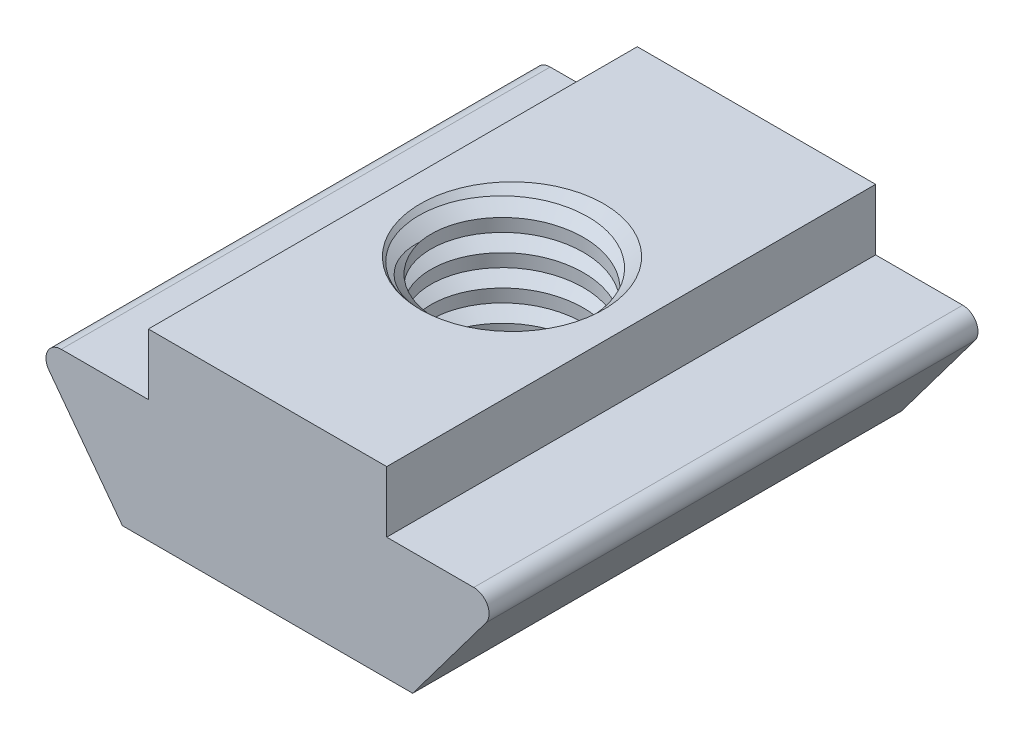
ISO-10303-21;
HEADER;
FILE_DESCRIPTION(('STEP AP214'),'2;1');
FILE_NAME('part.step','',(''),(''),'','','');
FILE_SCHEMA(('AUTOMOTIVE_DESIGN { 1 0 10303 214 1 1 1 1 }'));
ENDSEC;
DATA;
#1=APPLICATION_CONTEXT('core data for automotive mechanical design processes');
#2=APPLICATION_PROTOCOL_DEFINITION('international standard','automotive_design',2000,#1);
#3=PRODUCT_CONTEXT('',#1,'mechanical');
#4=PRODUCT('Part','Part','',(#3));
#5=PRODUCT_RELATED_PRODUCT_CATEGORY('part','',(#4));
#6=PRODUCT_DEFINITION_FORMATION('','',#4);
#7=PRODUCT_DEFINITION_CONTEXT('part definition',#1,'design');
#8=PRODUCT_DEFINITION('design','',#6,#7);
#9=PRODUCT_DEFINITION_SHAPE('','',#8);
#10=(LENGTH_UNIT() NAMED_UNIT(*) SI_UNIT(.MILLI.,.METRE.));
#11=(NAMED_UNIT(*) PLANE_ANGLE_UNIT() SI_UNIT($,.RADIAN.));
#12=(NAMED_UNIT(*) SI_UNIT($,.STERADIAN.) SOLID_ANGLE_UNIT());
#13=UNCERTAINTY_MEASURE_WITH_UNIT(LENGTH_MEASURE(1.E-05),#10,'distance_accuracy_value','');
#14=(GEOMETRIC_REPRESENTATION_CONTEXT(3) GLOBAL_UNCERTAINTY_ASSIGNED_CONTEXT((#13)) GLOBAL_UNIT_ASSIGNED_CONTEXT((#10,
#11,#12)) REPRESENTATION_CONTEXT('',''));
#15=CARTESIAN_POINT('',(0.,0.,0.));
#16=DIRECTION('',(0.,0.,1.));
#17=DIRECTION('',(1.,0.,0.));
#18=AXIS2_PLACEMENT_3D('',#15,#16,#17);
#19=CARTESIAN_POINT('',(0.,0.,0.));
#20=DIRECTION('',(0.,-1.,0.));
#21=DIRECTION('',(1.,0.,0.));
#22=AXIS2_PLACEMENT_3D('',#19,#20,#21);
#23=CONICAL_SURFACE('',#22,3.00000000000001,0.785398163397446);
#24=CARTESIAN_POINT('',(0.,0.500000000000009,0.));
#25=DIRECTION('',(0.,1.,0.));
#26=DIRECTION('',(-1.,0.,0.));
#27=AXIS2_PLACEMENT_3D('',#24,#25,#26);
#28=CIRCLE('',#27,2.5);
#29=CARTESIAN_POINT('',(2.42455382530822,0.499999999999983,0.609539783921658));
#30=VERTEX_POINT('',#29);
#31=CARTESIAN_POINT('',(-2.42455382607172,0.500000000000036,0.609539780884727));
#32=VERTEX_POINT('',#31);
#33=EDGE_CURVE('E151',#30,#32,#28,.F.);
#34=ORIENTED_EDGE('',*,*,#33,.F.);
#35=CARTESIAN_POINT('',(2.42455382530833,0.500000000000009,0.609539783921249));
#36=CARTESIAN_POINT('',(2.4177478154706,0.489109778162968,0.681257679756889));
#37=CARTESIAN_POINT('',(2.40788450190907,0.478230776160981,0.7526388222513));
#38=CARTESIAN_POINT('',(2.38210422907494,0.456552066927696,0.894307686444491));
#39=CARTESIAN_POINT('',(2.36618757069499,0.445752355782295,0.96459546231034));
#40=CARTESIAN_POINT('',(2.30964194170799,0.413666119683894,1.17248487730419));
#41=CARTESIAN_POINT('',(2.26014580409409,0.392579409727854,1.30785821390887));
#42=CARTESIAN_POINT('',(2.16930131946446,0.361775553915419,1.50314747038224));
#43=CARTESIAN_POINT('',(2.13621145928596,0.351635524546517,1.56700905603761));
#44=CARTESIAN_POINT('',(2.06470091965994,0.331669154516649,1.69176131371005));
#45=CARTESIAN_POINT('',(2.02628072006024,0.321842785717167,1.75265225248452));
#46=CARTESIAN_POINT('',(1.96485682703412,0.307383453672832,1.8414116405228));
#47=CARTESIAN_POINT('',(1.94373885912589,0.302608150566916,1.87058200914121));
#48=CARTESIAN_POINT('',(1.9111477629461,0.295512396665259,1.9136576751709));
#49=CARTESIAN_POINT('',(1.90013141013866,0.293158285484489,1.92790327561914));
#50=CARTESIAN_POINT('',(1.87783545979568,0.288431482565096,1.95618423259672));
#51=CARTESIAN_POINT('',(1.86655584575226,0.286058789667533,1.97021957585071));
#52=CARTESIAN_POINT('',(1.80949334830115,0.2741697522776,2.03984769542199));
#53=CARTESIAN_POINT('',(1.76170494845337,0.264574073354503,2.0938104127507));
#54=CARTESIAN_POINT('',(1.66040074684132,0.244927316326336,2.19976317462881));
#55=CARTESIAN_POINT('',(1.60674182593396,0.234872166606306,2.25161512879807));
#56=CARTESIAN_POINT('',(1.49550352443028,0.214712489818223,2.35090421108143));
#57=CARTESIAN_POINT('',(1.4379247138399,0.204607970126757,2.39834197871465));
#58=CARTESIAN_POINT('',(1.31918864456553,0.184409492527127,2.4885231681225));
#59=CARTESIAN_POINT('',(1.25803096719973,0.174315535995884,2.53126603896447));
#60=CARTESIAN_POINT('',(1.13251322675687,0.154197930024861,2.61179316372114));
#61=CARTESIAN_POINT('',(1.06815268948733,0.144174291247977,2.64957668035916));
#62=CARTESIAN_POINT('',(0.924883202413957,0.122474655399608,2.72622981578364));
#63=CARTESIAN_POINT('',(0.845427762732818,0.110823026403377,2.76408983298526));
#64=CARTESIAN_POINT('',(0.683297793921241,0.0877788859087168,2.83226772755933));
#65=CARTESIAN_POINT('',(0.600622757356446,0.0763864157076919,2.86258441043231));
#66=CARTESIAN_POINT('',(0.432599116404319,0.0539165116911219,2.91545992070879));
#67=CARTESIAN_POINT('',(0.347245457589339,0.042839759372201,2.9380029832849));
#68=CARTESIAN_POINT('',(0.174767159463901,0.021095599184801,2.97506443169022));
#69=CARTESIAN_POINT('',(0.0876426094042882,0.0104281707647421,2.98958322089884));
#70=CARTESIAN_POINT('',(6.87708595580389E-09,0.,3.00000000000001));
#71=B_SPLINE_CURVE_WITH_KNOTS('',3,(#35,#36,#37,#38,#39,#40,#41,#42,#43,#44,#45,#46,#47,#48,#49,
#50,#51,#52,#53,#54,#55,#56,#57,#58,#59,#60,#61,#62,#63,#64,#65,#66,#67,#68,#69,#70),
.UNSPECIFIED.,.F.,.F.,(4,2,2,2,2,2,2,2,2,2,2,2,2,2,2,2,2,4),(0.,0.218415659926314,
0.436820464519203,0.871385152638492,1.08910578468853,1.30680682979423,1.41576221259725,
1.47024272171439,1.52472665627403,1.74264229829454,1.96829597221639,2.19391690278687,
2.41956428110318,2.64524516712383,2.911202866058,3.17720265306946,3.44373875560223,
3.71026145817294),.UNSPECIFIED.);
#72=CARTESIAN_POINT('',(6.87708729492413E-09,0.,3.00000000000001));
#73=VERTEX_POINT('',#72);
#74=EDGE_CURVE('E143',#30,#73,#71,.T.);
#75=ORIENTED_EDGE('',*,*,#74,.T.);
#76=CARTESIAN_POINT('',(0.,0.,0.));
#77=DIRECTION('',(0.,1.,0.));
#78=DIRECTION('',(-1.,0.,0.));
#79=AXIS2_PLACEMENT_3D('',#76,#77,#78);
#80=CIRCLE('',#79,3.00000000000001);
#81=EDGE_CURVE('E150',#73,#73,#80,.T.);
#82=ORIENTED_EDGE('',*,*,#81,.F.);
#83=CARTESIAN_POINT('',(6.87699257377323E-09,0.,3.00000000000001));
#84=CARTESIAN_POINT('',(0.0832336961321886,0.00265384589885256,2.99735493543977));
#85=CARTESIAN_POINT('',(0.166351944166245,0.0053571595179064,2.99117930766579));
#86=CARTESIAN_POINT('',(0.331765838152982,0.0108441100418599,2.97185062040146));
#87=CARTESIAN_POINT('',(0.414061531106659,0.0136277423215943,2.95869796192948));
#88=CARTESIAN_POINT('',(0.577180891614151,0.0192547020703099,2.92551229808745));
#89=CARTESIAN_POINT('',(0.658005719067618,0.022097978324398,2.90548498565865));
#90=CARTESIAN_POINT('',(0.817678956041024,0.0278270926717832,2.85869287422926));
#91=CARTESIAN_POINT('',(0.896527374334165,0.0307129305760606,2.83192810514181));
#92=CARTESIAN_POINT('',(1.0517214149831,0.0365084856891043,2.77183744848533));
#93=CARTESIAN_POINT('',(1.12806594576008,0.039418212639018,2.73850874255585));
#94=CARTESIAN_POINT('',(1.27767382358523,0.0452399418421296,2.66553467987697));
#95=CARTESIAN_POINT('',(1.35093716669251,0.0481519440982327,2.62588931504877));
#96=CARTESIAN_POINT('',(1.49386072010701,0.0539569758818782,2.54056441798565));
#97=CARTESIAN_POINT('',(1.56352100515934,0.0568500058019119,2.49488501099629));
#98=CARTESIAN_POINT('',(1.69874577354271,0.0625974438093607,2.39781503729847));
#99=CARTESIAN_POINT('',(1.76431009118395,0.0654518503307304,2.34642423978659));
#100=CARTESIAN_POINT('',(1.8909225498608,0.0710979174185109,2.23825927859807));
#101=CARTESIAN_POINT('',(1.95196766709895,0.073889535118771,2.18148156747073));
#102=CARTESIAN_POINT('',(2.06903053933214,0.0794043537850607,2.06299081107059));
#103=CARTESIAN_POINT('',(2.12504856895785,0.0821275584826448,2.00127803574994));
#104=CARTESIAN_POINT('',(2.28468391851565,0.0904655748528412,1.80920329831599));
#105=CARTESIAN_POINT('',(2.38002409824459,0.0962544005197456,1.67178462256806));
#106=CARTESIAN_POINT('',(2.54400556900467,0.107899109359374,1.38530141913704));
#107=CARTESIAN_POINT('',(2.61309837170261,0.113751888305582,1.23649234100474));
#108=CARTESIAN_POINT('',(2.72508362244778,0.12549961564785,0.929156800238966));
#109=CARTESIAN_POINT('',(2.76796939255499,0.131394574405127,0.770627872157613));
#110=CARTESIAN_POINT('',(2.81153983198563,0.140092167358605,0.53001016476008));
#111=CARTESIAN_POINT('',(2.82260015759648,0.142955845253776,0.449666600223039));
#112=CARTESIAN_POINT('',(2.83790490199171,0.148631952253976,0.288339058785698));
#113=CARTESIAN_POINT('',(2.84215180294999,0.151444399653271,0.207355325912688));
#114=CARTESIAN_POINT('',(2.84382098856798,0.15697098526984,0.0453279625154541));
#115=CARTESIAN_POINT('',(2.84124423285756,0.159685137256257,-0.0357156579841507));
#116=CARTESIAN_POINT('',(2.82906274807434,0.165223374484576,-0.197269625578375));
#117=CARTESIAN_POINT('',(2.81945847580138,0.168047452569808,-0.277780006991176));
#118=CARTESIAN_POINT('',(2.79343737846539,0.173739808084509,-0.436903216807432));
#119=CARTESIAN_POINT('',(2.77708601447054,0.176607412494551,-0.515526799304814));
#120=CARTESIAN_POINT('',(2.73769241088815,0.182397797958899,-0.67108229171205));
#121=CARTESIAN_POINT('',(2.71464984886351,0.18532058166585,-0.748014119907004));
#122=CARTESIAN_POINT('',(2.66204027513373,0.191199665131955,-0.899628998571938));
#123=CARTESIAN_POINT('',(2.63247197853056,0.194155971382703,-0.974311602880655));
#124=CARTESIAN_POINT('',(2.56703155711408,0.200080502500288,-1.12086087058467));
#125=CARTESIAN_POINT('',(2.53115949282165,0.20304872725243,-1.19272756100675));
#126=CARTESIAN_POINT('',(2.454087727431,0.208920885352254,-1.33183099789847));
#127=CARTESIAN_POINT('',(2.41299744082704,0.211825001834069,-1.39912837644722));
#128=CARTESIAN_POINT('',(2.32528932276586,0.217602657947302,-1.53002077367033));
#129=CARTESIAN_POINT('',(2.27867131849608,0.220476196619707,-1.59361567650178));
#130=CARTESIAN_POINT('',(2.1802410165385,0.226170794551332,-1.71664570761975));
#131=CARTESIAN_POINT('',(2.12842972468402,0.228991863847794,-1.77608163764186));
#132=CARTESIAN_POINT('',(2.04710789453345,0.233168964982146,-1.861787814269));
#133=CARTESIAN_POINT('',(2.01939712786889,0.234552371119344,-1.88978430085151));
#134=CARTESIAN_POINT('',(1.96282074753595,0.237296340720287,-1.94458624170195));
#135=CARTESIAN_POINT('',(1.93395512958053,0.238656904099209,-1.97139169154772));
#136=CARTESIAN_POINT('',(1.84569033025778,0.24277983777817,-2.04984688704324));
#137=CARTESIAN_POINT('',(1.78457281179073,0.24558589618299,-2.09958879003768));
#138=CARTESIAN_POINT('',(1.6582901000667,0.25127228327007,-2.19357611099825));
#139=CARTESIAN_POINT('',(1.59312485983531,0.254152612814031,-2.23782146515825));
#140=CARTESIAN_POINT('',(1.392268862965,0.262882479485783,-2.36179222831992));
#141=CARTESIAN_POINT('',(1.25109468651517,0.268826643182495,-2.43286154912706));
#142=CARTESIAN_POINT('',(0.962613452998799,0.280614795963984,-2.54791178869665));
#143=CARTESIAN_POINT('',(0.815580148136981,0.286457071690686,-2.5925811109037));
#144=CARTESIAN_POINT('',(0.591094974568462,0.29513845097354,-2.64059799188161));
#145=CARTESIAN_POINT('',(0.515565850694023,0.298020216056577,-2.65344102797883));
#146=CARTESIAN_POINT('',(0.36368675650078,0.303734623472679,-2.67271759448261));
#147=CARTESIAN_POINT('',(0.287337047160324,0.306567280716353,-2.67915310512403));
#148=CARTESIAN_POINT('',(0.172586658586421,0.310770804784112,-2.68395910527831));
#149=CARTESIAN_POINT('',(0.134271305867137,0.312165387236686,-2.68475205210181));
#150=CARTESIAN_POINT('',(0.0576473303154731,0.31492479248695,-2.68472903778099));
#151=CARTESIAN_POINT('',(0.0193387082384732,0.316289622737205,-2.68391348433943));
#152=CARTESIAN_POINT('',(-0.0954716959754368,0.320411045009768,-2.67898231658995));
#153=CARTESIAN_POINT('',(-0.17187076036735,0.323195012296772,-2.67238274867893));
#154=CARTESIAN_POINT('',(-0.399679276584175,0.331678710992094,-2.64264377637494));
#155=CARTESIAN_POINT('',(-0.549896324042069,0.337516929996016,-2.60957259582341));
#156=CARTESIAN_POINT('',(-0.838974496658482,0.349223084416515,-2.518953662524));
#157=CARTESIAN_POINT('',(-0.978016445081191,0.355087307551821,-2.46198115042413));
#158=CARTESIAN_POINT('',(-1.17776135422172,0.363879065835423,-2.35958226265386));
#159=CARTESIAN_POINT('',(-1.24291030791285,0.366810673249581,-2.32259825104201));
#160=CARTESIAN_POINT('',(-1.3698528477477,0.372652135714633,-2.24322262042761));
#161=CARTESIAN_POINT('',(-1.43164635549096,0.3755619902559,-2.20083087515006));
#162=CARTESIAN_POINT('',(-1.55099908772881,0.381319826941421,-2.1112584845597));
#163=CARTESIAN_POINT('',(-1.60858408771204,0.384168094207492,-2.06411211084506));
#164=CARTESIAN_POINT('',(-1.71958560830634,0.389794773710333,-1.96512486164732));
#165=CARTESIAN_POINT('',(-1.77300216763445,0.392573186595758,-1.91328402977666));
#166=CARTESIAN_POINT('',(-1.84967301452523,0.396691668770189,-1.8322950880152));
#167=CARTESIAN_POINT('',(-1.87465265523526,0.398056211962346,-1.80476288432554));
#168=CARTESIAN_POINT('',(-1.92338289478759,0.40081901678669,-1.74863335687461));
#169=CARTESIAN_POINT('',(-1.94713356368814,0.402217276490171,-1.72003609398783));
#170=CARTESIAN_POINT('',(-2.0164793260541,0.406442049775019,-1.63274947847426));
#171=CARTESIAN_POINT('',(-2.06018107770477,0.409299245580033,-1.57255167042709));
#172=CARTESIAN_POINT('',(-2.18202420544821,0.417894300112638,-1.38832542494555));
#173=CARTESIAN_POINT('',(-2.25241540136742,0.423736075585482,-1.25906099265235));
#174=CARTESIAN_POINT('',(-2.37007757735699,0.435522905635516,-0.990333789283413));
#175=CARTESIAN_POINT('',(-2.41733831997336,0.441468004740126,-0.8508665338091));
#176=CARTESIAN_POINT('',(-2.46954690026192,0.450278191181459,-0.638462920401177));
#177=CARTESIAN_POINT('',(-2.48379491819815,0.453174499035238,-0.56770026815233));
#178=CARTESIAN_POINT('',(-2.50628042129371,0.45892806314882,-0.425198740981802));
#179=CARTESIAN_POINT('',(-2.51451713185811,0.461785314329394,-0.353459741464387));
#180=CARTESIAN_POINT('',(-2.52489584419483,0.467441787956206,-0.209616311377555));
#181=CARTESIAN_POINT('',(-2.52704458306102,0.470241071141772,-0.137512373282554));
#182=CARTESIAN_POINT('',(-2.52572128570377,0.474363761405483,-0.0294395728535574));
#183=CARTESIAN_POINT('',(-2.52452274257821,0.475725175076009,0.00656783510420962));
#184=CARTESIAN_POINT('',(-2.52056173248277,0.478473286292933,0.0784957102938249));
#185=CARTESIAN_POINT('',(-2.51779926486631,0.479859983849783,0.114416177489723));
#186=CARTESIAN_POINT('',(-2.50656728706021,0.484292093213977,0.228031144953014));
#187=CARTESIAN_POINT('',(-2.49520160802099,0.487380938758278,0.305456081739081));
#188=CARTESIAN_POINT('',(-2.46525248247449,0.493637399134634,0.458790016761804));
#189=CARTESIAN_POINT('',(-2.44667832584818,0.496804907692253,0.534700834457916));
#190=CARTESIAN_POINT('',(-2.42455382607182,0.50000000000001,0.609539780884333));
#191=B_SPLINE_CURVE_WITH_KNOTS('',3,(#83,#84,#85,#86,#87,#88,#89,#90,#91,#92,#93,#94,#95,#96,
#97,#98,#99,#100,#101,#102,#103,#104,#105,#106,#107,#108,#109,#110,#111,#112,#113,#114,#115,
#116,#117,#118,#119,#120,#121,#122,#123,#124,#125,#126,#127,#128,#129,#130,#131,#132,#133,#134,
#135,#136,#137,#138,#139,#140,#141,#142,#143,#144,#145,#146,#147,#148,#149,#150,#151,#152,#153,
#154,#155,#156,#157,#158,#159,#160,#161,#162,#163,#164,#165,#166,#167,#168,#169,#170,#171,#172,
#173,#174,#175,#176,#177,#178,#179,#180,#181,#182,#183,#184,#185,#186,#187,#188,#189,#190),
.UNSPECIFIED.,.F.,.F.,(4,2,2,2,2,2,2,2,2,2,2,2,2,2,2,2,2,2,2,2,2,2,2,2,2,2,2,2,2,2,2,2,2,2,2,2,
2,2,2,2,2,2,2,2,2,2,2,2,2,2,2,2,2,4),(0.,0.249877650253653,0.499740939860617,0.749397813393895,
0.999053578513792,1.24881677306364,1.49858028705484,1.74833861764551,1.99810704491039,
2.24804110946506,2.49796151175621,2.99725206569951,3.48751628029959,3.97790536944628,
4.22112561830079,4.46425724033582,4.70735467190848,4.95043630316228,5.19121300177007,
5.43200130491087,5.67283706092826,5.91367050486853,6.15010012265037,6.38653713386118,
6.62292844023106,6.74114552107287,6.85936304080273,7.09557861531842,7.33179693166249,
7.80374607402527,8.26277322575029,8.49255298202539,8.72226170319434,8.83728131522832,
8.95227177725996,9.18221454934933,9.64151846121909,10.0903505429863,10.3150404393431,
10.5397355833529,10.7629134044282,10.9860891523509,11.0976612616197,11.2092270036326,
11.4323023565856,11.8719274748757,12.3117469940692,12.5282557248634,12.744792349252,
12.9610892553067,13.0692196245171,13.1773500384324,13.4119256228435,13.6461998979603),.UNSPECIFIED.);
#192=EDGE_CURVE('E127',#73,#32,#191,.T.);
#193=ORIENTED_EDGE('',*,*,#192,.T.);
#194=EDGE_LOOP('',(#34,#75,#82,#193));
#195=FACE_BOUND('',#194,.T.);
#196=ADVANCED_FACE('F33',(#195),#23,.F.);
#197=CARTESIAN_POINT('',(0.,5.5,0.));
#198=DIRECTION('',(0.,1.,0.));
#199=DIRECTION('',(-1.,0.,0.));
#200=AXIS2_PLACEMENT_3D('',#197,#198,#199);
#201=CONICAL_SURFACE('',#200,2.5,0.785398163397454);
#202=CARTESIAN_POINT('',(0.,6.,0.));
#203=DIRECTION('',(0.,-1.,0.));
#204=DIRECTION('',(1.,0.,0.));
#205=AXIS2_PLACEMENT_3D('',#202,#203,#204);
#206=CIRCLE('',#205,3.00000000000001);
#207=CARTESIAN_POINT('',(6.87731479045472E-09,6.,3.00000000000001));
#208=VERTEX_POINT('',#207);
#209=EDGE_CURVE('E168',#208,#208,#206,.T.);
#210=ORIENTED_EDGE('',*,*,#209,.F.);
#211=CARTESIAN_POINT('',(6.87728273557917E-09,6.,3.00000000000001));
#212=CARTESIAN_POINT('',(-0.0832336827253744,5.9973461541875,2.99735493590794));
#213=CARTESIAN_POINT('',(-0.166351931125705,5.9946428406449,2.99117930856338));
#214=CARTESIAN_POINT('',(-0.331765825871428,5.98915589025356,2.97185062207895));
#215=CARTESIAN_POINT('',(-0.414061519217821,5.98637225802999,2.9586979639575));
#216=CARTESIAN_POINT('',(-0.577180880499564,5.9807452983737,2.92551230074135));
#217=CARTESIAN_POINT('',(-0.658005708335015,5.97790202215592,2.90548498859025));
#218=CARTESIAN_POINT('',(-0.817678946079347,5.97217290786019,2.85869287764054));
#219=CARTESIAN_POINT('',(-0.89652736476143,5.96928706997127,2.83192810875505));
#220=CARTESIAN_POINT('',(-1.05172140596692,5.96349151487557,2.77183745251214));
#221=CARTESIAN_POINT('',(-1.12806593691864,5.9605817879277,2.73850874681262));
#222=CARTESIAN_POINT('',(-1.27767381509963,5.95476005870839,2.66553468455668));
#223=CARTESIAN_POINT('',(-1.35093715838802,5.95184805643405,2.6258893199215));
#224=CARTESIAN_POINT('',(-1.49386071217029,5.94604302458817,2.54056442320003));
#225=CARTESIAN_POINT('',(-1.56352099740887,5.94314999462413,2.49488501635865));
#226=CARTESIAN_POINT('',(-1.69874576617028,5.93740255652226,2.39781504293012));
#227=CARTESIAN_POINT('',(-1.76431008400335,5.93454814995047,2.3464242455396));
#228=CARTESIAN_POINT('',(-1.89092254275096,5.92890208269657,2.23825928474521));
#229=CARTESIAN_POINT('',(-1.95196765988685,5.9261104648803,2.1814815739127));
#230=CARTESIAN_POINT('',(-2.06903053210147,5.92059564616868,2.06299081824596));
#231=CARTESIAN_POINT('',(-2.12504856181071,5.91787244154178,2.00127804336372));
#232=CARTESIAN_POINT('',(-2.28468391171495,5.90953442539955,1.80920330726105));
#233=CARTESIAN_POINT('',(-2.38002409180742,5.90374559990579,1.67178463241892));
#234=CARTESIAN_POINT('',(-2.54400556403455,5.89210089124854,1.38530142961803));
#235=CARTESIAN_POINT('',(-2.61309836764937,5.88624811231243,1.23649235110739));
#236=CARTESIAN_POINT('',(-2.72508361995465,5.87450038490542,0.929156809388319));
#237=CARTESIAN_POINT('',(-2.76796939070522,5.8686054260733,0.770627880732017));
#238=CARTESIAN_POINT('',(-2.8115398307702,5.8599078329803,0.530010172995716));
#239=CARTESIAN_POINT('',(-2.82260015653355,5.85704415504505,0.449666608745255));
#240=CARTESIAN_POINT('',(-2.83790490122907,5.85136804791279,0.288339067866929));
#241=CARTESIAN_POINT('',(-2.842151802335,5.84855560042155,0.207355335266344));
#242=CARTESIAN_POINT('',(-2.84382098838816,5.84302901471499,0.0453279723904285));
#243=CARTESIAN_POINT('',(-2.84124423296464,5.84031486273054,-0.0357156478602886));
#244=CARTESIAN_POINT('',(-2.8290627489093,5.83477662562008,-0.197269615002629));
#245=CARTESIAN_POINT('',(-2.8194584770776,5.83195254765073,-0.277779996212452));
#246=CARTESIAN_POINT('',(-2.79343738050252,5.82626019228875,-0.436903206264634));
#247=CARTESIAN_POINT('',(-2.77708601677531,5.82339258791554,-0.515526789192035));
#248=CARTESIAN_POINT('',(-2.73769241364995,5.81760220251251,-0.671082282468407));
#249=CARTESIAN_POINT('',(-2.71464985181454,5.81467941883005,-0.74801411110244));
#250=CARTESIAN_POINT('',(-2.66204027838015,5.80880033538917,-0.899628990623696));
#251=CARTESIAN_POINT('',(-2.6324719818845,5.80584402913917,-0.974311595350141));
#252=CARTESIAN_POINT('',(-2.56703156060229,5.79991949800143,-1.12086086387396));
#253=CARTESIAN_POINT('',(-2.53115949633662,5.79695127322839,-1.19272755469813));
#254=CARTESIAN_POINT('',(-2.45408773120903,5.79107911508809,-1.33183099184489));
#255=CARTESIAN_POINT('',(-2.41299744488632,5.78817499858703,-1.39912837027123));
#256=CARTESIAN_POINT('',(-2.3252893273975,5.78239734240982,-1.53002076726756));
#257=CARTESIAN_POINT('',(-2.27867132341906,5.77952380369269,-1.59361566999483));
#258=CARTESIAN_POINT('',(-2.18024102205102,5.77382920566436,-1.71664570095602));
#259=CARTESIAN_POINT('',(-2.12842973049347,5.77100813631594,-1.77608163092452));
#260=CARTESIAN_POINT('',(-2.0471079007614,5.76683103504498,-1.86178780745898));
#261=CARTESIAN_POINT('',(-2.019397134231,5.76544762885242,-1.88978429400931));
#262=CARTESIAN_POINT('',(-1.96282075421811,5.76270365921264,-1.94458623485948));
#263=CARTESIAN_POINT('',(-1.93395513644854,5.76134309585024,-1.97139168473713));
#264=CARTESIAN_POINT('',(-1.8456903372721,5.75722016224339,-2.04984688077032));
#265=CARTESIAN_POINT('',(-1.78457281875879,5.75441410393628,-2.09958878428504));
#266=CARTESIAN_POINT('',(-1.65829010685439,5.74872771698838,-2.19357610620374));
#267=CARTESIAN_POINT('',(-1.59312486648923,5.7458473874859,-2.23782146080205));
#268=CARTESIAN_POINT('',(-1.39226886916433,5.73711752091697,-2.36179222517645));
#269=CARTESIAN_POINT('',(-1.25109469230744,5.73117335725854,-2.43286154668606));
#270=CARTESIAN_POINT('',(-0.962613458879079,5.71938520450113,-2.54791178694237));
#271=CARTESIAN_POINT('',(-0.815580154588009,5.71354292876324,-2.59258110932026));
#272=CARTESIAN_POINT('',(-0.591094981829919,5.70486154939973,-2.64059799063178));
#273=CARTESIAN_POINT('',(-0.515565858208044,5.70197978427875,-2.65344102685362));
#274=CARTESIAN_POINT('',(-0.363686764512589,5.69626537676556,-2.67271759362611));
#275=CARTESIAN_POINT('',(-0.287337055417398,5.69343271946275,-2.67915310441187));
#276=CARTESIAN_POINT('',(-0.172586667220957,5.68922919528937,-2.68395910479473));
#277=CARTESIAN_POINT('',(-0.134271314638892,5.68783461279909,-2.68475205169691));
#278=CARTESIAN_POINT('',(-0.0576473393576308,5.68507520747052,-2.68472903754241));
#279=CARTESIAN_POINT('',(-0.0193387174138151,5.68371037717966,-2.6839134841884));
#280=CARTESIAN_POINT('',(0.0954716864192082,5.67958895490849,-2.67898231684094));
#281=CARTESIAN_POINT('',(0.171870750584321,5.67680498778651,-2.67238274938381));
#282=CARTESIAN_POINT('',(0.399679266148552,5.66832128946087,-2.64264377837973));
#283=CARTESIAN_POINT('',(0.549896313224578,5.66248307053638,-2.60957259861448));
#284=CARTESIAN_POINT('',(0.838974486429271,5.65077691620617,-2.51895366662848));
#285=CARTESIAN_POINT('',(0.97801643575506,5.64491269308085,-2.46198115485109));
#286=CARTESIAN_POINT('',(1.17776134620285,5.63612093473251,-2.35958226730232));
#287=CARTESIAN_POINT('',(1.24291030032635,5.63318932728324,-2.32259825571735));
#288=CARTESIAN_POINT('',(1.36985284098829,5.62734786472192,-2.24322262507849));
#289=CARTESIAN_POINT('',(1.43164634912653,5.62443801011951,-2.20083087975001));
#290=CARTESIAN_POINT('',(1.550999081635,5.61868017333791,-2.11125848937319));
#291=CARTESIAN_POINT('',(1.6085840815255,5.61583190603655,-2.06411211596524));
#292=CARTESIAN_POINT('',(1.71958560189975,5.61020522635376,-1.96512486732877));
#293=CARTESIAN_POINT('',(1.77300216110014,5.60742681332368,-1.91328403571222));
#294=CARTESIAN_POINT('',(1.84967300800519,5.60330833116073,-1.83229509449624));
#295=CARTESIAN_POINT('',(1.87465264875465,5.60194378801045,-1.8047628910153));
#296=CARTESIAN_POINT('',(1.92338288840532,5.59918098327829,-1.74863336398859));
#297=CARTESIAN_POINT('',(1.94713355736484,5.59778272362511,-1.72003610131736));
#298=CARTESIAN_POINT('',(2.01647931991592,5.59355795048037,-1.63274948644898));
#299=CARTESIAN_POINT('',(2.06018107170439,5.59070075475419,-1.57255167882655));
#300=CARTESIAN_POINT('',(2.18202420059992,5.58210570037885,-1.3883254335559));
#301=CARTESIAN_POINT('',(2.25241539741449,5.5762639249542,-1.25906100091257));
#302=CARTESIAN_POINT('',(2.37007757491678,5.56447709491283,-0.990333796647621));
#303=CARTESIAN_POINT('',(2.41733831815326,5.55853199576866,-0.850866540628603));
#304=CARTESIAN_POINT('',(2.46954689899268,5.54972180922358,-0.63846292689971));
#305=CARTESIAN_POINT('',(2.48379491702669,5.54682550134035,-0.567700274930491));
#306=CARTESIAN_POINT('',(2.50628042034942,5.54107193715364,-0.425198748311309));
#307=CARTESIAN_POINT('',(2.5145171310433,5.53821468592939,-0.353459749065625));
#308=CARTESIAN_POINT('',(2.52489584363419,5.53255821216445,-0.209616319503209));
#309=CARTESIAN_POINT('',(2.52704458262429,5.52975892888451,-0.137512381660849));
#310=CARTESIAN_POINT('',(2.52572128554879,5.52563623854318,-0.0294395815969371));
#311=CARTESIAN_POINT('',(2.52452274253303,5.52427482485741,0.00656782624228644));
#312=CARTESIAN_POINT('',(2.52056173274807,5.52152671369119,0.0784957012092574));
#313=CARTESIAN_POINT('',(2.51779926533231,5.52014001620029,0.114416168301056));
#314=CARTESIAN_POINT('',(2.50656728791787,5.51570790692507,0.228031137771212));
#315=CARTESIAN_POINT('',(2.4952016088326,5.51261906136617,0.305456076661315));
#316=CARTESIAN_POINT('',(2.4652524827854,5.50636260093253,0.458790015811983));
#317=CARTESIAN_POINT('',(2.44667832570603,5.50319509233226,0.534700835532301));
#318=CARTESIAN_POINT('',(2.42455382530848,5.50000000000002,0.609539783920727));
#319=B_SPLINE_CURVE_WITH_KNOTS('',3,(#211,#212,#213,#214,#215,#216,#217,#218,#219,#220,#221,
#222,#223,#224,#225,#226,#227,#228,#229,#230,#231,#232,#233,#234,#235,#236,#237,#238,#239,#240,
#241,#242,#243,#244,#245,#246,#247,#248,#249,#250,#251,#252,#253,#254,#255,#256,#257,#258,#259,
#260,#261,#262,#263,#264,#265,#266,#267,#268,#269,#270,#271,#272,#273,#274,#275,#276,#277,#278,
#279,#280,#281,#282,#283,#284,#285,#286,#287,#288,#289,#290,#291,#292,#293,#294,#295,#296,#297,
#298,#299,#300,#301,#302,#303,#304,#305,#306,#307,#308,#309,#310,#311,#312,#313,#314,#315,#316,
#317,#318),.UNSPECIFIED.,.F.,.F.,(4,2,2,2,2,2,2,2,2,2,2,2,2,2,2,2,2,2,2,2,2,2,2,2,2,2,2,2,2,2,2,
2,2,2,2,2,2,2,2,2,2,2,2,2,2,2,2,2,2,2,2,2,2,4),(0.,0.249877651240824,0.499740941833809,
0.749397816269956,0.999053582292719,1.24881677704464,1.49858029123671,1.74833862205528,
1.99810704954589,2.24804111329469,2.49796151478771,2.99725206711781,3.48751628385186,
3.97790537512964,4.22112562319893,4.46425724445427,4.70735467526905,4.95043630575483,
5.19121300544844,5.43200130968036,5.6728370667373,5.91367051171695,6.15010012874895,
6.38653713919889,6.62292844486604,6.74114552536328,6.85936304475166,7.09557862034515,
7.3317969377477,7.80374608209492,8.26277323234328,8.4925529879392,8.72226170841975,
8.83728132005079,8.95227178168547,9.18221455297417,9.64151846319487,10.0903505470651,
10.3150404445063,10.5397355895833,10.7629134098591,10.9860891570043,11.0976612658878,
11.2092270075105,11.4323023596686,11.8719274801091,12.3117470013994,12.5282557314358,
12.7447923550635,12.9610892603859,13.0692196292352,13.1773500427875,13.4119256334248,
13.6461999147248),.UNSPECIFIED.);
#320=CARTESIAN_POINT('',(2.42455382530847,5.50000000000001,0.609539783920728));
#321=VERTEX_POINT('',#320);
#322=EDGE_CURVE('E146',#208,#321,#319,.T.);
#323=ORIENTED_EDGE('',*,*,#322,.T.);
#324=CARTESIAN_POINT('',(0.,5.5,0.));
#325=DIRECTION('',(0.,-1.,0.));
#326=DIRECTION('',(1.,0.,0.));
#327=AXIS2_PLACEMENT_3D('',#324,#325,#326);
#328=CIRCLE('',#327,2.5);
#329=CARTESIAN_POINT('',(-2.42455382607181,5.5,0.609539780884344));
#330=VERTEX_POINT('',#329);
#331=EDGE_CURVE('E157',#330,#321,#328,.F.);
#332=ORIENTED_EDGE('',*,*,#331,.F.);
#333=CARTESIAN_POINT('',(-2.42455382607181,5.5,0.609539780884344));
#334=CARTESIAN_POINT('',(-2.41774781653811,5.51089022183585,0.681257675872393));
#335=CARTESIAN_POINT('',(-2.40788450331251,5.52176922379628,0.752638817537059));
#336=CARTESIAN_POINT('',(-2.38210423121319,5.54344793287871,0.894307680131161));
#337=CARTESIAN_POINT('',(-2.36618757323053,5.55424764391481,0.964595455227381));
#338=CARTESIAN_POINT('',(-2.30964194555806,5.58633387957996,1.17248486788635));
#339=CARTESIAN_POINT('',(-2.26014580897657,5.60742058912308,1.30785820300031));
#340=CARTESIAN_POINT('',(-2.16930132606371,5.63822444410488,1.50314745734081));
#341=CARTESIAN_POINT('',(-2.13621146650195,5.64836447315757,1.56700904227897));
#342=CARTESIAN_POINT('',(-2.06470092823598,5.66833084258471,1.69176129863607));
#343=CARTESIAN_POINT('',(-2.02628072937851,5.67815721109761,1.7526522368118));
#344=CARTESIAN_POINT('',(-1.96485683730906,5.6926165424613,1.84141162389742));
#345=CARTESIAN_POINT('',(-1.94373886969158,5.69739184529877,1.87058199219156));
#346=CARTESIAN_POINT('',(-1.91114777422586,5.70448759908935,1.91365765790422));
#347=CARTESIAN_POINT('',(-1.90013142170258,5.70684171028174,1.92790325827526));
#348=CARTESIAN_POINT('',(-1.87783547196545,5.71156851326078,1.9561842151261));
#349=CARTESIAN_POINT('',(-1.86655585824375,5.71394120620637,1.9702195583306));
#350=CARTESIAN_POINT('',(-1.80949336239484,5.72583024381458,2.03984767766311));
#351=CARTESIAN_POINT('',(-1.76170496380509,5.73542592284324,2.09381039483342));
#352=CARTESIAN_POINT('',(-1.66040076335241,5.75507268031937,2.19976315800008));
#353=CARTESIAN_POINT('',(-1.60674184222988,5.76512783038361,2.25161511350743));
#354=CARTESIAN_POINT('',(-1.49550354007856,5.78528750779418,2.35090419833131));
#355=CARTESIAN_POINT('',(-1.43792472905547,5.79539202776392,2.39834196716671));
#356=CARTESIAN_POINT('',(-1.31918865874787,5.81559050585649,2.4885231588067));
#357=CARTESIAN_POINT('',(-1.25803098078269,5.82568446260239,2.53126603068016));
#358=CARTESIAN_POINT('',(-1.13251323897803,5.84580206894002,2.61179315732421));
#359=CARTESIAN_POINT('',(-1.06815270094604,5.85582570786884,2.64957667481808));
#360=CARTESIAN_POINT('',(-0.924883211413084,5.87752534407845,2.7262298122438));
#361=CARTESIAN_POINT('',(-0.845427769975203,5.88917697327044,2.76408983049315));
#362=CARTESIAN_POINT('',(-0.683297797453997,5.91222111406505,2.83226772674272));
#363=CARTESIAN_POINT('',(-0.600622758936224,5.92361358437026,2.86258441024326));
#364=CARTESIAN_POINT('',(-0.432599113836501,5.9460834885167,2.91545992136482));
#365=CARTESIAN_POINT('',(-0.347245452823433,5.9571602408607,2.93800298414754));
#366=CARTESIAN_POINT('',(-0.17476715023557,5.97890440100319,2.97506443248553));
#367=CARTESIAN_POINT('',(-0.0876425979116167,5.98957182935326,2.98958322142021));
#368=CARTESIAN_POINT('',(6.87731055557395E-09,6.,3.00000000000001));
#369=B_SPLINE_CURVE_WITH_KNOTS('',3,(#333,#334,#335,#336,#337,#338,#339,#340,#341,#342,#343,
#344,#345,#346,#347,#348,#349,#350,#351,#352,#353,#354,#355,#356,#357,#358,#359,#360,#361,#362,
#363,#364,#365,#366,#367,#368),.UNSPECIFIED.,.F.,.F.,(4,2,2,2,2,2,2,2,2,2,2,2,2,2,2,2,2,4),(0.,
0.218415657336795,0.436820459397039,0.871385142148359,1.08910577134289,1.30680681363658,
1.41576219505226,1.4702427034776,1.52472663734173,1.74264227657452,1.96829595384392,
2.19391688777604,2.41956426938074,2.64524515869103,2.91120286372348,3.1772026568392,
3.44373876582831,3.71026147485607),.UNSPECIFIED.);
#370=EDGE_CURVE('E171',#330,#208,#369,.T.);
#371=ORIENTED_EDGE('',*,*,#370,.T.);
#372=EDGE_LOOP('',(#210,#323,#332,#371));
#373=FACE_BOUND('',#372,.T.);
#374=ADVANCED_FACE('F183',(#373),#201,.F.);
#375=CARTESIAN_POINT('',(-3.9,6.,8.));
#376=DIRECTION('',(0.,-1.,0.));
#377=DIRECTION('',(1.,0.,0.));
#378=AXIS2_PLACEMENT_3D('',#375,#376,#377);
#379=PLANE('',#378);
#380=ORIENTED_EDGE('',*,*,#209,.T.);
#381=EDGE_LOOP('',(#380));
#382=FACE_BOUND('',#381,.T.);
#383=DIRECTION('',(-1.,0.,0.));
#384=VECTOR('',#383,1.);
#385=CARTESIAN_POINT('',(-3.9,6.,-8.));
#386=LINE('',#385,#384);
#387=CARTESIAN_POINT('',(3.9,6.,-8.));
#388=VERTEX_POINT('',#387);
#389=CARTESIAN_POINT('',(-3.9,6.,-8.));
#390=VERTEX_POINT('',#389);
#391=EDGE_CURVE('E152',#388,#390,#386,.T.);
#392=ORIENTED_EDGE('',*,*,#391,.T.);
#393=DIRECTION('',(0.,0.,-1.));
#394=VECTOR('',#393,1.);
#395=CARTESIAN_POINT('',(-3.9,6.,8.));
#396=LINE('',#395,#394);
#397=CARTESIAN_POINT('',(-3.9,6.,8.));
#398=VERTEX_POINT('',#397);
#399=EDGE_CURVE('E158',#398,#390,#396,.T.);
#400=ORIENTED_EDGE('',*,*,#399,.F.);
#401=DIRECTION('',(-1.,0.,0.));
#402=VECTOR('',#401,1.);
#403=CARTESIAN_POINT('',(-3.9,6.,8.));
#404=LINE('',#403,#402);
#405=CARTESIAN_POINT('',(3.9,6.,8.));
#406=VERTEX_POINT('',#405);
#407=EDGE_CURVE('E223',#406,#398,#404,.T.);
#408=ORIENTED_EDGE('',*,*,#407,.F.);
#409=DIRECTION('',(0.,0.,-1.));
#410=VECTOR('',#409,1.);
#411=CARTESIAN_POINT('',(3.9,6.,8.));
#412=LINE('',#411,#410);
#413=EDGE_CURVE('E242',#406,#388,#412,.T.);
#414=ORIENTED_EDGE('',*,*,#413,.T.);
#415=EDGE_LOOP('',(#392,#400,#408,#414));
#416=FACE_BOUND('',#415,.T.);
#417=ADVANCED_FACE('F216',(#382,#416),#379,.F.);
#418=CARTESIAN_POINT('',(-3.9,4.,8.));
#419=DIRECTION('',(1.,0.,0.));
#420=DIRECTION('',(0.,0.,-1.));
#421=AXIS2_PLACEMENT_3D('',#418,#419,#420);
#422=PLANE('',#421);
#423=DIRECTION('',(0.,-1.,0.));
#424=VECTOR('',#423,1.);
#425=CARTESIAN_POINT('',(-3.9,4.,-8.));
#426=LINE('',#425,#424);
#427=CARTESIAN_POINT('',(-3.9,4.,-8.));
#428=VERTEX_POINT('',#427);
#429=EDGE_CURVE('E245',#390,#428,#426,.T.);
#430=ORIENTED_EDGE('',*,*,#429,.T.);
#431=DIRECTION('',(0.,0.,-1.));
#432=VECTOR('',#431,1.);
#433=CARTESIAN_POINT('',(-3.9,4.,8.));
#434=LINE('',#433,#432);
#435=CARTESIAN_POINT('',(-3.9,4.,8.));
#436=VERTEX_POINT('',#435);
#437=EDGE_CURVE('E163',#436,#428,#434,.T.);
#438=ORIENTED_EDGE('',*,*,#437,.F.);
#439=DIRECTION('',(0.,-1.,0.));
#440=VECTOR('',#439,1.);
#441=CARTESIAN_POINT('',(-3.9,4.,8.));
#442=LINE('',#441,#440);
#443=EDGE_CURVE('E226',#398,#436,#442,.T.);
#444=ORIENTED_EDGE('',*,*,#443,.F.);
#445=ORIENTED_EDGE('',*,*,#399,.T.);
#446=EDGE_LOOP('',(#430,#438,#444,#445));
#447=FACE_BOUND('',#446,.T.);
#448=ADVANCED_FACE('F313',(#447),#422,.F.);
#449=CARTESIAN_POINT('',(-7.75,4.,8.));
#450=DIRECTION('',(0.,-1.,0.));
#451=DIRECTION('',(0.,0.,-1.));
#452=AXIS2_PLACEMENT_3D('',#449,#450,#451);
#453=PLANE('',#452);
#454=DIRECTION('',(-1.,0.,0.));
#455=VECTOR('',#454,1.);
#456=CARTESIAN_POINT('',(-7.75,4.,-8.));
#457=LINE('',#456,#455);
#458=CARTESIAN_POINT('',(-6.75,4.,-8.));
#459=VERTEX_POINT('',#458);
#460=EDGE_CURVE('E247',#428,#459,#457,.T.);
#461=ORIENTED_EDGE('',*,*,#460,.T.);
#462=DIRECTION('',(0.,0.,-1.));
#463=VECTOR('',#462,1.);
#464=CARTESIAN_POINT('',(-6.75,4.,8.));
#465=LINE('',#464,#463);
#466=CARTESIAN_POINT('',(-6.75,4.,8.));
#467=VERTEX_POINT('',#466);
#468=EDGE_CURVE('E286',#459,#467,#465,.F.);
#469=ORIENTED_EDGE('',*,*,#468,.T.);
#470=DIRECTION('',(-1.,0.,0.));
#471=VECTOR('',#470,1.);
#472=CARTESIAN_POINT('',(-7.75,4.,8.));
#473=LINE('',#472,#471);
#474=EDGE_CURVE('E229',#436,#467,#473,.T.);
#475=ORIENTED_EDGE('',*,*,#474,.F.);
#476=ORIENTED_EDGE('',*,*,#437,.T.);
#477=EDGE_LOOP('',(#461,#469,#475,#476));
#478=FACE_BOUND('',#477,.T.);
#479=ADVANCED_FACE('F274',(#478),#453,.F.);
#480=CARTESIAN_POINT('',(-4.75,0.,8.));
#481=DIRECTION('',(0.8,0.6,0.));
#482=DIRECTION('',(-0.6,0.8,0.));
#483=AXIS2_PLACEMENT_3D('',#480,#481,#482);
#484=PLANE('',#483);
#485=DIRECTION('',(0.6,-0.8,0.));
#486=VECTOR('',#485,1.);
#487=CARTESIAN_POINT('',(-4.75,0.,8.));
#488=LINE('',#487,#486);
#489=CARTESIAN_POINT('',(-7.15,3.2,8.));
#490=VERTEX_POINT('',#489);
#491=CARTESIAN_POINT('',(-4.75,0.,8.));
#492=VERTEX_POINT('',#491);
#493=EDGE_CURVE('E232',#490,#492,#488,.T.);
#494=ORIENTED_EDGE('',*,*,#493,.F.);
#495=DIRECTION('',(0.,0.,-1.));
#496=VECTOR('',#495,1.);
#497=CARTESIAN_POINT('',(-7.15,3.2,8.));
#498=LINE('',#497,#496);
#499=CARTESIAN_POINT('',(-7.15,3.2,-8.));
#500=VERTEX_POINT('',#499);
#501=EDGE_CURVE('E290',#490,#500,#498,.T.);
#502=ORIENTED_EDGE('',*,*,#501,.T.);
#503=DIRECTION('',(0.6,-0.8,0.));
#504=VECTOR('',#503,1.);
#505=CARTESIAN_POINT('',(-4.75,0.,-8.));
#506=LINE('',#505,#504);
#507=CARTESIAN_POINT('',(-4.75,0.,-8.));
#508=VERTEX_POINT('',#507);
#509=EDGE_CURVE('E250',#500,#508,#506,.T.);
#510=ORIENTED_EDGE('',*,*,#509,.T.);
#511=DIRECTION('',(0.,0.,-1.));
#512=VECTOR('',#511,1.);
#513=CARTESIAN_POINT('',(-4.75,0.,8.));
#514=LINE('',#513,#512);
#515=EDGE_CURVE('E267',#492,#508,#514,.T.);
#516=ORIENTED_EDGE('',*,*,#515,.F.);
#517=EDGE_LOOP('',(#494,#502,#510,#516));
#518=FACE_BOUND('',#517,.T.);
#519=ADVANCED_FACE('F319',(#518),#484,.F.);
#520=CARTESIAN_POINT('',(4.75,0.,8.));
#521=DIRECTION('',(0.,1.,0.));
#522=DIRECTION('',(-1.,0.,0.));
#523=AXIS2_PLACEMENT_3D('',#520,#521,#522);
#524=PLANE('',#523);
#525=ORIENTED_EDGE('',*,*,#81,.T.);
#526=EDGE_LOOP('',(#525));
#527=FACE_BOUND('',#526,.T.);
#528=DIRECTION('',(1.,0.,0.));
#529=VECTOR('',#528,1.);
#530=CARTESIAN_POINT('',(4.75,0.,-8.));
#531=LINE('',#530,#529);
#532=CARTESIAN_POINT('',(4.75,0.,-8.));
#533=VERTEX_POINT('',#532);
#534=EDGE_CURVE('E252',#508,#533,#531,.T.);
#535=ORIENTED_EDGE('',*,*,#534,.T.);
#536=DIRECTION('',(0.,0.,-1.));
#537=VECTOR('',#536,1.);
#538=CARTESIAN_POINT('',(4.75,0.,8.));
#539=LINE('',#538,#537);
#540=CARTESIAN_POINT('',(4.75,0.,8.));
#541=VERTEX_POINT('',#540);
#542=EDGE_CURVE('E264',#541,#533,#539,.T.);
#543=ORIENTED_EDGE('',*,*,#542,.F.);
#544=DIRECTION('',(1.,0.,0.));
#545=VECTOR('',#544,1.);
#546=CARTESIAN_POINT('',(4.75,0.,8.));
#547=LINE('',#546,#545);
#548=EDGE_CURVE('E234',#492,#541,#547,.T.);
#549=ORIENTED_EDGE('',*,*,#548,.F.);
#550=ORIENTED_EDGE('',*,*,#515,.T.);
#551=EDGE_LOOP('',(#535,#543,#549,#550));
#552=FACE_BOUND('',#551,.T.);
#553=ADVANCED_FACE('F155',(#527,#552),#524,.F.);
#554=CARTESIAN_POINT('',(7.75,4.,8.));
#555=DIRECTION('',(-0.8,0.6,0.));
#556=DIRECTION('',(-0.6,-0.8,0.));
#557=AXIS2_PLACEMENT_3D('',#554,#555,#556);
#558=PLANE('',#557);
#559=DIRECTION('',(0.6,0.8,0.));
#560=VECTOR('',#559,1.);
#561=CARTESIAN_POINT('',(7.75,4.,-8.));
#562=LINE('',#561,#560);
#563=CARTESIAN_POINT('',(7.15,3.2,-8.));
#564=VERTEX_POINT('',#563);
#565=EDGE_CURVE('E254',#533,#564,#562,.T.);
#566=ORIENTED_EDGE('',*,*,#565,.T.);
#567=DIRECTION('',(0.,0.,-1.));
#568=VECTOR('',#567,1.);
#569=CARTESIAN_POINT('',(7.15,3.2,8.));
#570=LINE('',#569,#568);
#571=CARTESIAN_POINT('',(7.15,3.2,8.));
#572=VERTEX_POINT('',#571);
#573=EDGE_CURVE('E11',#564,#572,#570,.F.);
#574=ORIENTED_EDGE('',*,*,#573,.T.);
#575=DIRECTION('',(0.6,0.8,0.));
#576=VECTOR('',#575,1.);
#577=CARTESIAN_POINT('',(7.75,4.,8.));
#578=LINE('',#577,#576);
#579=EDGE_CURVE('E236',#541,#572,#578,.T.);
#580=ORIENTED_EDGE('',*,*,#579,.F.);
#581=ORIENTED_EDGE('',*,*,#542,.T.);
#582=EDGE_LOOP('',(#566,#574,#580,#581));
#583=FACE_BOUND('',#582,.T.);
#584=ADVANCED_FACE('F328',(#583),#558,.F.);
#585=CARTESIAN_POINT('',(3.9,4.,8.));
#586=DIRECTION('',(0.,-1.,0.));
#587=DIRECTION('',(0.,0.,-1.));
#588=AXIS2_PLACEMENT_3D('',#585,#586,#587);
#589=PLANE('',#588);
#590=DIRECTION('',(-1.,0.,0.));
#591=VECTOR('',#590,1.);
#592=CARTESIAN_POINT('',(3.9,4.,8.));
#593=LINE('',#592,#591);
#594=CARTESIAN_POINT('',(6.75,4.,8.));
#595=VERTEX_POINT('',#594);
#596=CARTESIAN_POINT('',(3.9,4.,8.));
#597=VERTEX_POINT('',#596);
#598=EDGE_CURVE('E238',#595,#597,#593,.T.);
#599=ORIENTED_EDGE('',*,*,#598,.F.);
#600=DIRECTION('',(0.,0.,-1.));
#601=VECTOR('',#600,1.);
#602=CARTESIAN_POINT('',(6.75,4.,8.));
#603=LINE('',#602,#601);
#604=CARTESIAN_POINT('',(6.75,4.,-8.));
#605=VERTEX_POINT('',#604);
#606=EDGE_CURVE('E41',#595,#605,#603,.T.);
#607=ORIENTED_EDGE('',*,*,#606,.T.);
#608=DIRECTION('',(-1.,0.,0.));
#609=VECTOR('',#608,1.);
#610=CARTESIAN_POINT('',(3.9,4.,-8.));
#611=LINE('',#610,#609);
#612=CARTESIAN_POINT('',(3.9,4.,-8.));
#613=VERTEX_POINT('',#612);
#614=EDGE_CURVE('E256',#605,#613,#611,.T.);
#615=ORIENTED_EDGE('',*,*,#614,.T.);
#616=DIRECTION('',(0.,0.,-1.));
#617=VECTOR('',#616,1.);
#618=CARTESIAN_POINT('',(3.9,4.,8.));
#619=LINE('',#618,#617);
#620=EDGE_CURVE('E261',#597,#613,#619,.T.);
#621=ORIENTED_EDGE('',*,*,#620,.F.);
#622=EDGE_LOOP('',(#599,#607,#615,#621));
#623=FACE_BOUND('',#622,.T.);
#624=ADVANCED_FACE('F299',(#623),#589,.F.);
#625=CARTESIAN_POINT('',(3.9,6.,8.));
#626=DIRECTION('',(-1.,0.,0.));
#627=DIRECTION('',(0.,-1.,0.));
#628=AXIS2_PLACEMENT_3D('',#625,#626,#627);
#629=PLANE('',#628);
#630=DIRECTION('',(0.,1.,0.));
#631=VECTOR('',#630,1.);
#632=CARTESIAN_POINT('',(3.9,6.,-8.));
#633=LINE('',#632,#631);
#634=EDGE_CURVE('E227',#613,#388,#633,.T.);
#635=ORIENTED_EDGE('',*,*,#634,.T.);
#636=ORIENTED_EDGE('',*,*,#413,.F.);
#637=DIRECTION('',(0.,1.,0.));
#638=VECTOR('',#637,1.);
#639=CARTESIAN_POINT('',(3.9,6.,8.));
#640=LINE('',#639,#638);
#641=EDGE_CURVE('E240',#597,#406,#640,.T.);
#642=ORIENTED_EDGE('',*,*,#641,.F.);
#643=ORIENTED_EDGE('',*,*,#620,.T.);
#644=EDGE_LOOP('',(#635,#636,#642,#643));
#645=FACE_BOUND('',#644,.T.);
#646=ADVANCED_FACE('F306',(#645),#629,.F.);
#647=CARTESIAN_POINT('',(0.,0.,8.));
#648=DIRECTION('',(0.,0.,-1.));
#649=DIRECTION('',(-1.,0.,0.));
#650=AXIS2_PLACEMENT_3D('',#647,#648,#649);
#651=PLANE('',#650);
#652=ORIENTED_EDGE('',*,*,#474,.T.);
#653=CARTESIAN_POINT('',(-6.75,3.5,8.));
#654=DIRECTION('',(0.,0.,-1.));
#655=DIRECTION('',(-1.,0.,0.));
#656=AXIS2_PLACEMENT_3D('',#653,#654,#655);
#657=CIRCLE('',#656,0.5);
#658=EDGE_CURVE('E294',#467,#490,#657,.F.);
#659=ORIENTED_EDGE('',*,*,#658,.T.);
#660=ORIENTED_EDGE('',*,*,#493,.T.);
#661=ORIENTED_EDGE('',*,*,#548,.T.);
#662=ORIENTED_EDGE('',*,*,#579,.T.);
#663=CARTESIAN_POINT('',(6.75,3.5,8.));
#664=DIRECTION('',(0.,0.,-1.));
#665=DIRECTION('',(-1.,0.,0.));
#666=AXIS2_PLACEMENT_3D('',#663,#664,#665);
#667=CIRCLE('',#666,0.5);
#668=EDGE_CURVE('E48',#572,#595,#667,.F.);
#669=ORIENTED_EDGE('',*,*,#668,.T.);
#670=ORIENTED_EDGE('',*,*,#598,.T.);
#671=ORIENTED_EDGE('',*,*,#641,.T.);
#672=ORIENTED_EDGE('',*,*,#407,.T.);
#673=ORIENTED_EDGE('',*,*,#443,.T.);
#674=EDGE_LOOP('',(#652,#659,#660,#661,#662,#669,#670,#671,#672,#673));
#675=FACE_BOUND('',#674,.T.);
#676=ADVANCED_FACE('F311',(#675),#651,.F.);
#677=CARTESIAN_POINT('',(0.,0.,-8.));
#678=DIRECTION('',(0.,0.,-1.));
#679=DIRECTION('',(-1.,0.,0.));
#680=AXIS2_PLACEMENT_3D('',#677,#678,#679);
#681=PLANE('',#680);
#682=ORIENTED_EDGE('',*,*,#509,.F.);
#683=CARTESIAN_POINT('',(-6.75,3.5,-8.));
#684=DIRECTION('',(0.,0.,-1.));
#685=DIRECTION('',(-1.,0.,0.));
#686=AXIS2_PLACEMENT_3D('',#683,#684,#685);
#687=CIRCLE('',#686,0.5);
#688=EDGE_CURVE('E281',#500,#459,#687,.T.);
#689=ORIENTED_EDGE('',*,*,#688,.T.);
#690=ORIENTED_EDGE('',*,*,#460,.F.);
#691=ORIENTED_EDGE('',*,*,#429,.F.);
#692=ORIENTED_EDGE('',*,*,#391,.F.);
#693=ORIENTED_EDGE('',*,*,#634,.F.);
#694=ORIENTED_EDGE('',*,*,#614,.F.);
#695=CARTESIAN_POINT('',(6.75,3.5,-8.));
#696=DIRECTION('',(0.,0.,-1.));
#697=DIRECTION('',(-1.,0.,0.));
#698=AXIS2_PLACEMENT_3D('',#695,#696,#697);
#699=CIRCLE('',#698,0.5);
#700=EDGE_CURVE('E287',#605,#564,#699,.T.);
#701=ORIENTED_EDGE('',*,*,#700,.T.);
#702=ORIENTED_EDGE('',*,*,#565,.F.);
#703=ORIENTED_EDGE('',*,*,#534,.F.);
#704=EDGE_LOOP('',(#682,#689,#690,#691,#692,#693,#694,#701,#702,#703));
#705=FACE_BOUND('',#704,.T.);
#706=ADVANCED_FACE('F279',(#705),#681,.T.);
#707=CARTESIAN_POINT('',(0.,-10.,0.));
#708=DIRECTION('',(0.,1.,0.));
#709=DIRECTION('',(-1.,0.,0.));
#710=AXIS2_PLACEMENT_3D('',#707,#708,#709);
#711=CYLINDRICAL_SURFACE('',#710,2.5);
#712=ORIENTED_EDGE('',*,*,#331,.T.);
#713=CARTESIAN_POINT('',(-1.76776687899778,6.9136751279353,-1.76776702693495));
#714=CARTESIAN_POINT('',(-1.03553380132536,6.8511751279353,-2.50000004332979));
#715=CARTESIAN_POINT('',(1.04607374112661E-07,6.7886751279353,-2.5));
#716=CARTESIAN_POINT('',(1.03553401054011,6.7261751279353,-2.49999995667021));
#717=CARTESIAN_POINT('',(1.76776702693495,6.6636751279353,-1.76776687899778));
#718=CARTESIAN_POINT('',(2.50000004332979,6.6011751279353,-1.03553380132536));
#719=CARTESIAN_POINT('',(2.5,6.5386751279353,1.04607373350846E-07));
#720=CARTESIAN_POINT('',(2.49999995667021,6.47617512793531,1.03553401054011));
#721=CARTESIAN_POINT('',(1.76776687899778,6.4136751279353,1.76776702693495));
#722=CARTESIAN_POINT('',(1.03553380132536,6.35117512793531,2.50000004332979));
#723=CARTESIAN_POINT('',(-1.04607372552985E-07,6.2886751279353,2.5));
#724=CARTESIAN_POINT('',(-1.03553401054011,6.22617512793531,2.49999995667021));
#725=CARTESIAN_POINT('',(-1.76776702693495,6.16367512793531,1.76776687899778));
#726=CARTESIAN_POINT('',(-2.50000004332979,6.10117512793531,1.03553380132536));
#727=CARTESIAN_POINT('',(-2.5,6.0386751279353,-1.04607373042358E-07));
#728=CARTESIAN_POINT('',(-2.4999999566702,5.97617512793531,-1.03553401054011));
#729=CARTESIAN_POINT('',(-1.76776687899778,5.91367512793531,-1.76776702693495));
#730=CARTESIAN_POINT('',(-1.03553380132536,5.85117512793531,-2.50000004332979));
#731=CARTESIAN_POINT('',(1.0460737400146E-07,5.78867512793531,-2.5));
#732=CARTESIAN_POINT('',(1.03553401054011,5.72617512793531,-2.49999995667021));
#733=CARTESIAN_POINT('',(1.76776702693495,5.66367512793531,-1.76776687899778));
#734=CARTESIAN_POINT('',(2.50000004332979,5.60117512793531,-1.03553380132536));
#735=CARTESIAN_POINT('',(2.5,5.53867512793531,1.04607373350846E-07));
#736=CARTESIAN_POINT('',(2.49999995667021,5.47617512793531,1.03553401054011));
#737=CARTESIAN_POINT('',(1.76776687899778,5.41367512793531,1.76776702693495));
#738=CARTESIAN_POINT('',(1.03553380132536,5.35117512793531,2.50000004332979));
#739=CARTESIAN_POINT('',(-1.04607372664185E-07,5.28867512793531,2.5));
#740=CARTESIAN_POINT('',(-1.03553401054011,5.22617512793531,2.49999995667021));
#741=CARTESIAN_POINT('',(-1.76776702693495,5.16367512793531,1.76776687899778));
#742=CARTESIAN_POINT('',(-2.50000004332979,5.10117512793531,1.03553380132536));
#743=CARTESIAN_POINT('',(-2.5,5.03867512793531,-1.04607373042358E-07));
#744=CARTESIAN_POINT('',(-2.4999999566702,4.97617512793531,-1.03553401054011));
#745=CARTESIAN_POINT('',(-1.76776687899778,4.91367512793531,-1.76776702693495));
#746=CARTESIAN_POINT('',(-1.03553380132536,4.85117512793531,-2.50000004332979));
#747=CARTESIAN_POINT('',(1.0460737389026E-07,4.78867512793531,-2.5));
#748=CARTESIAN_POINT('',(1.03553401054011,4.72617512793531,-2.49999995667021));
#749=CARTESIAN_POINT('',(1.76776702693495,4.66367512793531,-1.76776687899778));
#750=CARTESIAN_POINT('',(2.50000004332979,4.60117512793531,-1.03553380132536));
#751=CARTESIAN_POINT('',(2.5,4.53867512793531,1.04607373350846E-07));
#752=CARTESIAN_POINT('',(2.49999995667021,4.47617512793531,1.03553401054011));
#753=CARTESIAN_POINT('',(1.76776687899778,4.41367512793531,1.76776702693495));
#754=CARTESIAN_POINT('',(1.03553380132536,4.35117512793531,2.50000004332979));
#755=CARTESIAN_POINT('',(-1.04607372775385E-07,4.28867512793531,2.5));
#756=CARTESIAN_POINT('',(-1.03553401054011,4.22617512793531,2.49999995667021));
#757=CARTESIAN_POINT('',(-1.76776702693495,4.16367512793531,1.76776687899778));
#758=CARTESIAN_POINT('',(-2.50000004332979,4.10117512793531,1.03553380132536));
#759=CARTESIAN_POINT('',(-2.5,4.03867512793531,-1.04607373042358E-07));
#760=CARTESIAN_POINT('',(-2.49999995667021,3.97617512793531,-1.03553401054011));
#761=CARTESIAN_POINT('',(-1.76776687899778,3.91367512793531,-1.76776702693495));
#762=CARTESIAN_POINT('',(-1.03553380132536,3.85117512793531,-2.50000004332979));
#763=CARTESIAN_POINT('',(1.0460737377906E-07,3.78867512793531,-2.5));
#764=CARTESIAN_POINT('',(1.03553401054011,3.72617512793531,-2.49999995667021));
#765=CARTESIAN_POINT('',(1.76776702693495,3.66367512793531,-1.76776687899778));
#766=CARTESIAN_POINT('',(2.50000004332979,3.60117512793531,-1.03553380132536));
#767=CARTESIAN_POINT('',(2.5,3.53867512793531,1.04607373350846E-07));
#768=CARTESIAN_POINT('',(2.49999995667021,3.47617512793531,1.03553401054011));
#769=CARTESIAN_POINT('',(1.76776687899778,3.41367512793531,1.76776702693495));
#770=CARTESIAN_POINT('',(1.03553380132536,3.35117512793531,2.50000004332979));
#771=CARTESIAN_POINT('',(-1.04607372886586E-07,3.28867512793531,2.5));
#772=CARTESIAN_POINT('',(-1.03553401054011,3.22617512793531,2.49999995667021));
#773=CARTESIAN_POINT('',(-1.76776702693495,3.16367512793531,1.76776687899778));
#774=CARTESIAN_POINT('',(-2.50000004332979,3.10117512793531,1.03553380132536));
#775=CARTESIAN_POINT('',(-2.5,3.03867512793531,-1.04607373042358E-07));
#776=CARTESIAN_POINT('',(-2.49999995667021,2.97617512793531,-1.03553401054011));
#777=CARTESIAN_POINT('',(-1.76776687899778,2.91367512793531,-1.76776702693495));
#778=CARTESIAN_POINT('',(-1.03553380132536,2.85117512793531,-2.50000004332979));
#779=CARTESIAN_POINT('',(1.0460737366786E-07,2.78867512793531,-2.5));
#780=CARTESIAN_POINT('',(1.03553401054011,2.72617512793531,-2.49999995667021));
#781=CARTESIAN_POINT('',(1.76776702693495,2.66367512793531,-1.76776687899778));
#782=CARTESIAN_POINT('',(2.50000004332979,2.60117512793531,-1.03553380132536));
#783=CARTESIAN_POINT('',(2.5,2.53867512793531,1.04607373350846E-07));
#784=CARTESIAN_POINT('',(2.49999995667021,2.47617512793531,1.03553401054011));
#785=CARTESIAN_POINT('',(1.76776687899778,2.41367512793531,1.76776702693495));
#786=CARTESIAN_POINT('',(1.03553380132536,2.35117512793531,2.50000004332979));
#787=CARTESIAN_POINT('',(-1.04607372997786E-07,2.28867512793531,2.5));
#788=CARTESIAN_POINT('',(-1.03553401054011,2.22617512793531,2.49999995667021));
#789=CARTESIAN_POINT('',(-1.76776702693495,2.16367512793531,1.76776687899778));
#790=CARTESIAN_POINT('',(-2.50000004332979,2.10117512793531,1.03553380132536));
#791=CARTESIAN_POINT('',(-2.5,2.03867512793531,-1.04607373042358E-07));
#792=CARTESIAN_POINT('',(-2.49999995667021,1.97617512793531,-1.03553401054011));
#793=CARTESIAN_POINT('',(-1.76776687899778,1.91367512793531,-1.76776702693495));
#794=CARTESIAN_POINT('',(-1.03553380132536,1.85117512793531,-2.50000004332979));
#795=CARTESIAN_POINT('',(1.0460737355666E-07,1.78867512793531,-2.5));
#796=CARTESIAN_POINT('',(1.03553401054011,1.72617512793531,-2.49999995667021));
#797=CARTESIAN_POINT('',(1.76776702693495,1.66367512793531,-1.76776687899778));
#798=CARTESIAN_POINT('',(2.50000004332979,1.60117512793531,-1.03553380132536));
#799=CARTESIAN_POINT('',(2.5,1.53867512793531,1.04607373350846E-07));
#800=CARTESIAN_POINT('',(2.49999995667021,1.47617512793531,1.03553401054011));
#801=CARTESIAN_POINT('',(1.76776687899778,1.41367512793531,1.76776702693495));
#802=CARTESIAN_POINT('',(1.03553380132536,1.35117512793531,2.50000004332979));
#803=CARTESIAN_POINT('',(-1.04607373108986E-07,1.28867512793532,2.5));
#804=CARTESIAN_POINT('',(-1.03553401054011,1.22617512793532,2.49999995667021));
#805=CARTESIAN_POINT('',(-1.76776702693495,1.16367512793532,1.76776687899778));
#806=CARTESIAN_POINT('',(-2.50000004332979,1.10117512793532,1.03553380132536));
#807=CARTESIAN_POINT('',(-2.5,1.03867512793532,-1.04607373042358E-07));
#808=CARTESIAN_POINT('',(-2.49999995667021,0.976175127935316,-1.03553401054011));
#809=CARTESIAN_POINT('',(-1.76776687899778,0.913675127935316,-1.76776702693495));
#810=CARTESIAN_POINT('',(-1.03553380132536,0.851175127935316,-2.50000004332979));
#811=CARTESIAN_POINT('',(1.04607373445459E-07,0.788675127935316,-2.5));
#812=CARTESIAN_POINT('',(1.03553401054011,0.726175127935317,-2.49999995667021));
#813=CARTESIAN_POINT('',(1.76776702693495,0.663675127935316,-1.76776687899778));
#814=CARTESIAN_POINT('',(2.50000004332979,0.601175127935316,-1.03553380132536));
#815=CARTESIAN_POINT('',(2.5,0.538675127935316,1.04607373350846E-07));
#816=CARTESIAN_POINT('',(2.49999995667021,0.476175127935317,1.03553401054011));
#817=CARTESIAN_POINT('',(1.76776687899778,0.413675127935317,1.76776702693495));
#818=CARTESIAN_POINT('',(1.03553380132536,0.351175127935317,2.50000004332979));
#819=CARTESIAN_POINT('',(-1.04607373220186E-07,0.288675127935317,2.5));
#820=CARTESIAN_POINT('',(-1.03553401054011,0.226175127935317,2.49999995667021));
#821=CARTESIAN_POINT('',(-1.76776702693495,0.163675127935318,1.76776687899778));
#822=CARTESIAN_POINT('',(-2.50000004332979,0.101175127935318,1.03553380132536));
#823=CARTESIAN_POINT('',(-2.5,0.0386751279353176,-1.04607373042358E-07));
#824=CARTESIAN_POINT('',(-2.49999995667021,-0.0238248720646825,-1.03553401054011));
#825=CARTESIAN_POINT('',(-1.76776687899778,-0.0863248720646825,-1.76776702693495));
#826=CARTESIAN_POINT('',(-1.03553380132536,-0.148824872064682,-2.50000004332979));
#827=CARTESIAN_POINT('',(1.04607373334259E-07,-0.211324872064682,-2.5));
#828=CARTESIAN_POINT('',(1.03553401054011,-0.273824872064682,-2.49999995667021));
#829=CARTESIAN_POINT('',(1.76776702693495,-0.336324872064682,-1.76776687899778));
#830=CARTESIAN_POINT('',(2.50000004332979,-0.398824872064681,-1.03553380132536));
#831=CARTESIAN_POINT('',(2.5,-0.461324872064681,1.04607373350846E-07));
#832=CARTESIAN_POINT('',(2.49999995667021,-0.523824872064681,1.03553401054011));
#833=CARTESIAN_POINT('',(1.76776687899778,-0.586324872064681,1.76776702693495));
#834=CARTESIAN_POINT('',(1.03553380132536,-0.648824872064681,2.50000004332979));
#835=CARTESIAN_POINT('',(-1.04607373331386E-07,-0.711324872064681,2.5));
#836=CARTESIAN_POINT('',(-1.03553401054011,-0.773824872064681,2.49999995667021));
#837=CARTESIAN_POINT('',(-1.76776702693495,-0.836324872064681,1.76776687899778));
#838=CARTESIAN_POINT('',(-2.50000004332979,-0.898824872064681,1.03553380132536));
#839=CARTESIAN_POINT('',(-2.5,-0.96132487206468,-1.04607373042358E-07));
#840=CARTESIAN_POINT('',(-2.49999995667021,-1.02382487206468,-1.03553401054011));
#841=CARTESIAN_POINT('',(-1.76776687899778,-1.08632487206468,-1.76776702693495));
#842=CARTESIAN_POINT('',(-1.03553380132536,-1.14882487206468,-2.50000004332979));
#843=CARTESIAN_POINT('',(1.04607373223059E-07,-1.21132487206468,-2.5));
#844=CARTESIAN_POINT('',(1.03553401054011,-1.27382487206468,-2.49999995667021));
#845=CARTESIAN_POINT('',(1.76776702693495,-1.33632487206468,-1.76776687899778));
#846=CARTESIAN_POINT('',(2.50000004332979,-1.39882487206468,-1.03553380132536));
#847=CARTESIAN_POINT('',(2.5,-1.46132487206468,1.04607373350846E-07));
#848=CARTESIAN_POINT('',(2.49999995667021,-1.52382487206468,1.03553401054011));
#849=CARTESIAN_POINT('',(1.76776687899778,-1.58632487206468,1.76776702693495));
#850=CARTESIAN_POINT('',(1.03553380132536,-1.64882487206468,2.50000004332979));
#851=CARTESIAN_POINT('',(-1.04607373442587E-07,-1.71132487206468,2.5));
#852=CARTESIAN_POINT('',(-1.03553401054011,-1.77382487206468,2.49999995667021));
#853=CARTESIAN_POINT('',(-1.76776702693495,-1.83632487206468,1.76776687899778));
#854=CARTESIAN_POINT('',(-2.50000004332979,-1.89882487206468,1.03553380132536));
#855=CARTESIAN_POINT('',(-2.5,-1.96132487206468,-1.04607373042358E-07));
#856=CARTESIAN_POINT('',(-2.49999995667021,-2.02382487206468,-1.03553401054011));
#857=CARTESIAN_POINT('',(-1.76776687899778,-2.08632487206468,-1.76776702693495));
#858=CARTESIAN_POINT('',(-1.03553380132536,-2.14882487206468,-2.50000004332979));
#859=CARTESIAN_POINT('',(1.04607373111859E-07,-2.21132487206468,-2.5));
#860=CARTESIAN_POINT('',(1.03553401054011,-2.27382487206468,-2.49999995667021));
#861=CARTESIAN_POINT('',(1.76776702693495,-2.33632487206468,-1.76776687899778));
#862=CARTESIAN_POINT('',(2.50000004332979,-2.39882487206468,-1.03553380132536));
#863=CARTESIAN_POINT('',(2.5,-2.46132487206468,1.04607373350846E-07));
#864=CARTESIAN_POINT('',(2.49999995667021,-2.52382487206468,1.03553401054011));
#865=CARTESIAN_POINT('',(1.76776687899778,-2.58632487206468,1.76776702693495));
#866=CARTESIAN_POINT('',(1.03553380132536,-2.64882487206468,2.50000004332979));
#867=CARTESIAN_POINT('',(-1.04607373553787E-07,-2.71132487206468,2.5));
#868=CARTESIAN_POINT('',(-1.03553401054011,-2.77382487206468,2.49999995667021));
#869=CARTESIAN_POINT('',(-1.76776702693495,-2.83632487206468,1.76776687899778));
#870=CARTESIAN_POINT('',(-2.50000004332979,-2.89882487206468,1.03553380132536));
#871=CARTESIAN_POINT('',(-2.5,-2.96132487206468,-1.04607373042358E-07));
#872=CARTESIAN_POINT('',(-2.49999995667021,-3.02382487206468,-1.03553401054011));
#873=CARTESIAN_POINT('',(-1.76776687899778,-3.08632487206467,-1.76776702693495));
#874=CARTESIAN_POINT('',(-1.03553380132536,-3.14882487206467,-2.50000004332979));
#875=CARTESIAN_POINT('',(1.04607373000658E-07,-3.21132487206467,-2.5));
#876=CARTESIAN_POINT('',(1.03553401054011,-3.27382487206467,-2.49999995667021));
#877=CARTESIAN_POINT('',(1.76776702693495,-3.33632487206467,-1.76776687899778));
#878=CARTESIAN_POINT('',(2.50000004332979,-3.39882487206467,-1.03553380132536));
#879=CARTESIAN_POINT('',(2.5,-3.46132487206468,1.04607373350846E-07));
#880=CARTESIAN_POINT('',(2.4999999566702,-3.52382487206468,1.03553401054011));
#881=CARTESIAN_POINT('',(1.76776687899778,-3.58632487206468,1.76776702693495));
#882=CARTESIAN_POINT('',(1.03553380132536,-3.64882487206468,2.50000004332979));
#883=CARTESIAN_POINT('',(-1.04607373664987E-07,-3.71132487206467,2.5));
#884=CARTESIAN_POINT('',(-1.03553401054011,-3.77382487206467,2.49999995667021));
#885=CARTESIAN_POINT('',(-1.76776702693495,-3.83632487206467,1.76776687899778));
#886=CARTESIAN_POINT('',(-2.50000004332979,-3.89882487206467,1.03553380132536));
#887=CARTESIAN_POINT('',(-2.5,-3.96132487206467,-1.04607373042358E-07));
#888=CARTESIAN_POINT('',(-2.49999995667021,-4.02382487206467,-1.03553401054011));
#889=CARTESIAN_POINT('',(-1.76776687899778,-4.08632487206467,-1.76776702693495));
#890=(BOUNDED_CURVE() B_SPLINE_CURVE(2,(#713,#714,#715,#716,#717,#718,#719,#720,#721,#722,#723,
#724,#725,#726,#727,#728,#729,#730,#731,#732,#733,#734,#735,#736,#737,#738,#739,#740,#741,#742,
#743,#744,#745,#746,#747,#748,#749,#750,#751,#752,#753,#754,#755,#756,#757,#758,#759,#760,#761,
#762,#763,#764,#765,#766,#767,#768,#769,#770,#771,#772,#773,#774,#775,#776,#777,#778,#779,#780,
#781,#782,#783,#784,#785,#786,#787,#788,#789,#790,#791,#792,#793,#794,#795,#796,#797,#798,#799,
#800,#801,#802,#803,#804,#805,#806,#807,#808,#809,#810,#811,#812,#813,#814,#815,#816,#817,#818,
#819,#820,#821,#822,#823,#824,#825,#826,#827,#828,#829,#830,#831,#832,#833,#834,#835,#836,#837,
#838,#839,#840,#841,#842,#843,#844,#845,#846,#847,#848,#849,#850,#851,#852,#853,#854,#855,#856,
#857,#858,#859,#860,#861,#862,#863,#864,#865,#866,#867,#868,#869,#870,#871,#872,#873,#874,#875,
#876,#877,#878,#879,#880,#881,#882,#883,#884,#885,#886,#887,#888,#889),.UNSPECIFIED.,.F.,
.F.) B_SPLINE_CURVE_WITH_KNOTS((3,2,2,2,2,2,2,2,2,2,2,2,2,2,2,2,2,2,2,2,2,2,2,2,2,2,2,2,2,2,2,2,
2,2,2,2,2,2,2,2,2,2,2,2,2,2,2,2,2,2,2,2,2,2,2,2,2,2,2,2,2,2,2,2,2,2,2,2,2,2,2,2,2,2,2,2,2,2,2,2,
2,2,2,2,2,2,2,2,3),(0.,0.0113636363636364,0.0227272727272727,0.0340909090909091,
0.0454545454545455,0.0568181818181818,0.0681818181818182,0.0795454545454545,0.0909090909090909,
0.102272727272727,0.113636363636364,0.125,0.136363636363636,0.147727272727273,0.159090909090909,
0.170454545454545,0.181818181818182,0.193181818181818,0.204545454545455,0.215909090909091,
0.227272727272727,0.238636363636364,0.25,0.261363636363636,0.272727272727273,0.284090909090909,
0.295454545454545,0.306818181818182,0.318181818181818,0.329545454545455,0.340909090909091,
0.352272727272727,0.363636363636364,0.375,0.386363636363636,0.397727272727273,0.409090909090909,
0.420454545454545,0.431818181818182,0.443181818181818,0.454545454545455,0.465909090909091,
0.477272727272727,0.488636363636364,0.5,0.511363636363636,0.522727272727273,0.534090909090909,
0.545454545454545,0.556818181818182,0.568181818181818,0.579545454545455,0.590909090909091,
0.602272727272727,0.613636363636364,0.625,0.636363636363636,0.647727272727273,0.659090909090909,
0.670454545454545,0.681818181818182,0.693181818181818,0.704545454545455,0.715909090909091,
0.727272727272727,0.738636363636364,0.75,0.761363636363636,0.772727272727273,0.784090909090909,
0.795454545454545,0.806818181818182,0.818181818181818,0.829545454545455,0.840909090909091,
0.852272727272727,0.863636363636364,0.875,0.886363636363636,0.897727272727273,0.909090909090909,
0.920454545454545,0.931818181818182,0.943181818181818,0.954545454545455,0.965909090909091,
0.977272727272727,0.988636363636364,1.),
.UNSPECIFIED.) CURVE() GEOMETRIC_REPRESENTATION_ITEM() RATIONAL_B_SPLINE_CURVE((1.,
0.923879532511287,1.,0.923879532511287,1.,0.923879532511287,1.,0.923879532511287,1.,
0.923879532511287,1.,0.923879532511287,1.,0.923879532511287,1.,0.923879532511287,1.,
0.923879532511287,1.,0.923879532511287,1.,0.923879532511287,1.,0.923879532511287,1.,
0.923879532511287,1.,0.923879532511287,1.,0.923879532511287,1.,0.923879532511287,1.,
0.923879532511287,1.,0.923879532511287,1.,0.923879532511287,1.,0.923879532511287,1.,
0.923879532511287,1.,0.923879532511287,1.,0.923879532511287,1.,0.923879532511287,1.,
0.923879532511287,1.,0.923879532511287,1.,0.923879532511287,1.,0.923879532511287,1.,
0.923879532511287,1.,0.923879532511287,1.,0.923879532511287,1.,0.923879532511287,1.,
0.923879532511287,1.,0.923879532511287,1.,0.923879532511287,1.,0.923879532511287,1.,
0.923879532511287,1.,0.923879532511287,1.,0.923879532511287,1.,0.923879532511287,1.,
0.923879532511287,1.,0.923879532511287,1.,0.923879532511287,1.,0.923879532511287,1.,
0.923879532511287,1.,0.923879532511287,1.,0.923879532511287,1.,0.923879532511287,1.,
0.923879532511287,1.,0.923879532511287,1.,0.923879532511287,1.,0.923879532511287,1.,
0.923879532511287,1.,0.923879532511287,1.,0.923879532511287,1.,0.923879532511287,1.,
0.923879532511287,1.,0.923879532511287,1.,0.923879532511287,1.,0.923879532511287,1.,
0.923879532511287,1.,0.923879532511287,1.,0.923879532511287,1.,0.923879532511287,1.,
0.923879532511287,1.,0.923879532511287,1.,0.923879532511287,1.,0.923879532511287,1.,
0.923879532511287,1.,0.923879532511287,1.,0.923879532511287,1.,0.923879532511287,1.,
0.923879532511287,1.,0.923879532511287,1.,0.923879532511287,1.,0.923879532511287,1.,
0.923879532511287,1.,0.923879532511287,1.,0.923879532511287,1.,0.923879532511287,1.,
0.923879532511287,1.,0.923879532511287,1.,0.923879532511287,1.,0.923879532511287,1.,
0.923879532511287,1.,0.923879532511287,1.,0.923879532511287,1.,0.923879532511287,1.)) REPRESENTATION_ITEM(''));
#891=EDGE_CURVE('E138',#321,#30,#890,.T.);
#892=ORIENTED_EDGE('',*,*,#891,.T.);
#893=ORIENTED_EDGE('',*,*,#33,.T.);
#894=CARTESIAN_POINT('',(-1.76776687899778,6.33632485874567,-1.76776702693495));
#895=CARTESIAN_POINT('',(-1.03553380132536,6.27382485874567,-2.50000004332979));
#896=CARTESIAN_POINT('',(1.04607374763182E-07,6.21132485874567,-2.5));
#897=CARTESIAN_POINT('',(1.03553401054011,6.14882485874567,-2.49999995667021));
#898=CARTESIAN_POINT('',(1.76776702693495,6.08632485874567,-1.76776687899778));
#899=CARTESIAN_POINT('',(2.50000004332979,6.02382485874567,-1.03553380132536));
#900=CARTESIAN_POINT('',(2.5,5.96132485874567,1.04607374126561E-07));
#901=CARTESIAN_POINT('',(2.49999995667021,5.89882485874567,1.03553401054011));
#902=CARTESIAN_POINT('',(1.76776687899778,5.83632485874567,1.76776702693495));
#903=CARTESIAN_POINT('',(1.03553380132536,5.77382485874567,2.50000004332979));
#904=CARTESIAN_POINT('',(-1.04607373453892E-07,5.71132485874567,2.5));
#905=CARTESIAN_POINT('',(-1.03553401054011,5.64882485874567,2.49999995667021));
#906=CARTESIAN_POINT('',(-1.76776702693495,5.58632485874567,1.76776687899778));
#907=CARTESIAN_POINT('',(-2.50000004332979,5.52382485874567,1.03553380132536));
#908=CARTESIAN_POINT('',(-2.5,5.46132485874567,-1.04607373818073E-07));
#909=CARTESIAN_POINT('',(-2.4999999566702,5.39882485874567,-1.03553401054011));
#910=CARTESIAN_POINT('',(-1.76776687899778,5.33632485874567,-1.76776702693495));
#911=CARTESIAN_POINT('',(-1.03553380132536,5.27382485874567,-2.50000004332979));
#912=CARTESIAN_POINT('',(1.04607374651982E-07,5.21132485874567,-2.5));
#913=CARTESIAN_POINT('',(1.03553401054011,5.14882485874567,-2.49999995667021));
#914=CARTESIAN_POINT('',(1.76776702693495,5.08632485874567,-1.76776687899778));
#915=CARTESIAN_POINT('',(2.50000004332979,5.02382485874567,-1.03553380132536));
#916=CARTESIAN_POINT('',(2.5,4.96132485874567,1.04607374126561E-07));
#917=CARTESIAN_POINT('',(2.49999995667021,4.89882485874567,1.03553401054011));
#918=CARTESIAN_POINT('',(1.76776687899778,4.83632485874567,1.76776702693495));
#919=CARTESIAN_POINT('',(1.03553380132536,4.77382485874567,2.50000004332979));
#920=CARTESIAN_POINT('',(-1.04607373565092E-07,4.71132485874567,2.5));
#921=CARTESIAN_POINT('',(-1.03553401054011,4.64882485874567,2.49999995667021));
#922=CARTESIAN_POINT('',(-1.76776702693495,4.58632485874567,1.76776687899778));
#923=CARTESIAN_POINT('',(-2.50000004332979,4.52382485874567,1.03553380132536));
#924=CARTESIAN_POINT('',(-2.5,4.46132485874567,-1.04607373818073E-07));
#925=CARTESIAN_POINT('',(-2.4999999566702,4.39882485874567,-1.03553401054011));
#926=CARTESIAN_POINT('',(-1.76776687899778,4.33632485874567,-1.76776702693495));
#927=CARTESIAN_POINT('',(-1.03553380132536,4.27382485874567,-2.50000004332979));
#928=CARTESIAN_POINT('',(1.04607374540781E-07,4.21132485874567,-2.5));
#929=CARTESIAN_POINT('',(1.03553401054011,4.14882485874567,-2.49999995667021));
#930=CARTESIAN_POINT('',(1.76776702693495,4.08632485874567,-1.76776687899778));
#931=CARTESIAN_POINT('',(2.50000004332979,4.02382485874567,-1.03553380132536));
#932=CARTESIAN_POINT('',(2.5,3.96132485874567,1.04607374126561E-07));
#933=CARTESIAN_POINT('',(2.49999995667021,3.89882485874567,1.03553401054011));
#934=CARTESIAN_POINT('',(1.76776687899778,3.83632485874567,1.76776702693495));
#935=CARTESIAN_POINT('',(1.03553380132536,3.77382485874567,2.50000004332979));
#936=CARTESIAN_POINT('',(-1.04607373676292E-07,3.71132485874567,2.5));
#937=CARTESIAN_POINT('',(-1.03553401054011,3.64882485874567,2.49999995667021));
#938=CARTESIAN_POINT('',(-1.76776702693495,3.58632485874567,1.76776687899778));
#939=CARTESIAN_POINT('',(-2.50000004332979,3.52382485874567,1.03553380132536));
#940=CARTESIAN_POINT('',(-2.5,3.46132485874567,-1.04607373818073E-07));
#941=CARTESIAN_POINT('',(-2.49999995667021,3.39882485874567,-1.03553401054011));
#942=CARTESIAN_POINT('',(-1.76776687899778,3.33632485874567,-1.76776702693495));
#943=CARTESIAN_POINT('',(-1.03553380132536,3.27382485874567,-2.50000004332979));
#944=CARTESIAN_POINT('',(1.04607374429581E-07,3.21132485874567,-2.5));
#945=CARTESIAN_POINT('',(1.03553401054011,3.14882485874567,-2.49999995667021));
#946=CARTESIAN_POINT('',(1.76776702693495,3.08632485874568,-1.76776687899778));
#947=CARTESIAN_POINT('',(2.50000004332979,3.02382485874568,-1.03553380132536));
#948=CARTESIAN_POINT('',(2.5,2.96132485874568,1.04607374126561E-07));
#949=CARTESIAN_POINT('',(2.49999995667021,2.89882485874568,1.03553401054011));
#950=CARTESIAN_POINT('',(1.76776687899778,2.83632485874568,1.76776702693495));
#951=CARTESIAN_POINT('',(1.03553380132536,2.77382485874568,2.50000004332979));
#952=CARTESIAN_POINT('',(-1.04607373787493E-07,2.71132485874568,2.5));
#953=CARTESIAN_POINT('',(-1.03553401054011,2.64882485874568,2.49999995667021));
#954=CARTESIAN_POINT('',(-1.76776702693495,2.58632485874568,1.76776687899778));
#955=CARTESIAN_POINT('',(-2.50000004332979,2.52382485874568,1.03553380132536));
#956=CARTESIAN_POINT('',(-2.5,2.46132485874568,-1.04607373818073E-07));
#957=CARTESIAN_POINT('',(-2.49999995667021,2.39882485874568,-1.03553401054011));
#958=CARTESIAN_POINT('',(-1.76776687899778,2.33632485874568,-1.76776702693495));
#959=CARTESIAN_POINT('',(-1.03553380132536,2.27382485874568,-2.50000004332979));
#960=CARTESIAN_POINT('',(1.04607374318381E-07,2.21132485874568,-2.5));
#961=CARTESIAN_POINT('',(1.03553401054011,2.14882485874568,-2.49999995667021));
#962=CARTESIAN_POINT('',(1.76776702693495,2.08632485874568,-1.76776687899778));
#963=CARTESIAN_POINT('',(2.50000004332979,2.02382485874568,-1.03553380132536));
#964=CARTESIAN_POINT('',(2.5,1.96132485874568,1.04607374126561E-07));
#965=CARTESIAN_POINT('',(2.49999995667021,1.89882485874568,1.03553401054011));
#966=CARTESIAN_POINT('',(1.76776687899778,1.83632485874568,1.76776702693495));
#967=CARTESIAN_POINT('',(1.03553380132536,1.77382485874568,2.50000004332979));
#968=CARTESIAN_POINT('',(-1.04607373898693E-07,1.71132485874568,2.5));
#969=CARTESIAN_POINT('',(-1.03553401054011,1.64882485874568,2.49999995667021));
#970=CARTESIAN_POINT('',(-1.76776702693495,1.58632485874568,1.76776687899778));
#971=CARTESIAN_POINT('',(-2.50000004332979,1.52382485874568,1.03553380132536));
#972=CARTESIAN_POINT('',(-2.5,1.46132485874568,-1.04607373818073E-07));
#973=CARTESIAN_POINT('',(-2.49999995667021,1.39882485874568,-1.03553401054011));
#974=CARTESIAN_POINT('',(-1.76776687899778,1.33632485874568,-1.76776702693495));
#975=CARTESIAN_POINT('',(-1.03553380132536,1.27382485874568,-2.50000004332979));
#976=CARTESIAN_POINT('',(1.04607374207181E-07,1.21132485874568,-2.5));
#977=CARTESIAN_POINT('',(1.03553401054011,1.14882485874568,-2.49999995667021));
#978=CARTESIAN_POINT('',(1.76776702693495,1.08632485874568,-1.76776687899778));
#979=CARTESIAN_POINT('',(2.50000004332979,1.02382485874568,-1.03553380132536));
#980=CARTESIAN_POINT('',(2.5,0.96132485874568,1.04607374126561E-07));
#981=CARTESIAN_POINT('',(2.49999995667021,0.89882485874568,1.03553401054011));
#982=CARTESIAN_POINT('',(1.76776687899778,0.83632485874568,1.76776702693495));
#983=CARTESIAN_POINT('',(1.03553380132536,0.77382485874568,2.50000004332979));
#984=CARTESIAN_POINT('',(-1.04607374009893E-07,0.711324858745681,2.5));
#985=CARTESIAN_POINT('',(-1.03553401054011,0.648824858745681,2.49999995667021));
#986=CARTESIAN_POINT('',(-1.76776702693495,0.586324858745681,1.76776687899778));
#987=CARTESIAN_POINT('',(-2.50000004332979,0.523824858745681,1.03553380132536));
#988=CARTESIAN_POINT('',(-2.5,0.461324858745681,-1.04607373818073E-07));
#989=CARTESIAN_POINT('',(-2.49999995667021,0.398824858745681,-1.03553401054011));
#990=CARTESIAN_POINT('',(-1.76776687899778,0.336324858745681,-1.76776702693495));
#991=CARTESIAN_POINT('',(-1.03553380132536,0.273824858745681,-2.50000004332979));
#992=CARTESIAN_POINT('',(1.04607374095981E-07,0.211324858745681,-2.5));
#993=CARTESIAN_POINT('',(1.03553401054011,0.148824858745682,-2.49999995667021));
#994=CARTESIAN_POINT('',(1.76776702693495,0.0863248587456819,-1.76776687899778));
#995=CARTESIAN_POINT('',(2.50000004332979,0.0238248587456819,-1.03553380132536));
#996=CARTESIAN_POINT('',(2.5,-0.0386751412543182,1.04607374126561E-07));
#997=CARTESIAN_POINT('',(2.4999999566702,-0.101175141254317,1.03553401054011));
#998=CARTESIAN_POINT('',(1.76776687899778,-0.163675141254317,1.76776702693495));
#999=CARTESIAN_POINT('',(1.03553380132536,-0.226175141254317,2.50000004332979));
#1000=CARTESIAN_POINT('',(-1.04607374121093E-07,-0.288675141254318,2.5));
#1001=CARTESIAN_POINT('',(-1.03553401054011,-0.351175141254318,2.49999995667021));
#1002=CARTESIAN_POINT('',(-1.76776702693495,-0.413675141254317,1.76776687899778));
#1003=CARTESIAN_POINT('',(-2.50000004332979,-0.476175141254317,1.03553380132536));
#1004=CARTESIAN_POINT('',(-2.5,-0.538675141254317,-1.04607373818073E-07));
#1005=CARTESIAN_POINT('',(-2.49999995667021,-0.601175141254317,-1.03553401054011));
#1006=CARTESIAN_POINT('',(-1.76776687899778,-0.663675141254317,-1.76776702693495));
#1007=CARTESIAN_POINT('',(-1.03553380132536,-0.726175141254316,-2.50000004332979));
#1008=CARTESIAN_POINT('',(1.0460737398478E-07,-0.788675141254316,-2.5));
#1009=CARTESIAN_POINT('',(1.03553401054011,-0.851175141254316,-2.49999995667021));
#1010=CARTESIAN_POINT('',(1.76776702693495,-0.913675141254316,-1.76776687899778));
#1011=CARTESIAN_POINT('',(2.50000004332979,-0.976175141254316,-1.03553380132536));
#1012=CARTESIAN_POINT('',(2.5,-1.03867514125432,1.04607374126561E-07));
#1013=CARTESIAN_POINT('',(2.4999999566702,-1.10117514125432,1.03553401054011));
#1014=CARTESIAN_POINT('',(1.76776687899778,-1.16367514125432,1.76776702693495));
#1015=CARTESIAN_POINT('',(1.03553380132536,-1.22617514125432,2.50000004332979));
#1016=CARTESIAN_POINT('',(-1.04607374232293E-07,-1.28867514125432,2.5));
#1017=CARTESIAN_POINT('',(-1.03553401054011,-1.35117514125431,2.49999995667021));
#1018=CARTESIAN_POINT('',(-1.76776702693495,-1.41367514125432,1.76776687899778));
#1019=CARTESIAN_POINT('',(-2.50000004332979,-1.47617514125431,1.03553380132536));
#1020=CARTESIAN_POINT('',(-2.5,-1.53867514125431,-1.04607373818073E-07));
#1021=CARTESIAN_POINT('',(-2.49999995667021,-1.60117514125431,-1.03553401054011));
#1022=CARTESIAN_POINT('',(-1.76776687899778,-1.66367514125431,-1.76776702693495));
#1023=CARTESIAN_POINT('',(-1.03553380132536,-1.72617514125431,-2.50000004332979));
#1024=CARTESIAN_POINT('',(1.0460737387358E-07,-1.78867514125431,-2.5));
#1025=CARTESIAN_POINT('',(1.03553401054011,-1.85117514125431,-2.49999995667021));
#1026=CARTESIAN_POINT('',(1.76776702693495,-1.91367514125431,-1.76776687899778));
#1027=CARTESIAN_POINT('',(2.50000004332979,-1.97617514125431,-1.03553380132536));
#1028=CARTESIAN_POINT('',(2.5,-2.03867514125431,1.04607374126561E-07));
#1029=CARTESIAN_POINT('',(2.4999999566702,-2.10117514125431,1.03553401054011));
#1030=CARTESIAN_POINT('',(1.76776687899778,-2.16367514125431,1.76776702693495));
#1031=CARTESIAN_POINT('',(1.03553380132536,-2.22617514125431,2.50000004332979));
#1032=CARTESIAN_POINT('',(-1.04607374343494E-07,-2.28867514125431,2.5));
#1033=CARTESIAN_POINT('',(-1.03553401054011,-2.35117514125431,2.49999995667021));
#1034=CARTESIAN_POINT('',(-1.76776702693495,-2.41367514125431,1.76776687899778));
#1035=CARTESIAN_POINT('',(-2.50000004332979,-2.47617514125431,1.03553380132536));
#1036=CARTESIAN_POINT('',(-2.5,-2.53867514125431,-1.04607373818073E-07));
#1037=CARTESIAN_POINT('',(-2.49999995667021,-2.60117514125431,-1.03553401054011));
#1038=CARTESIAN_POINT('',(-1.76776687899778,-2.66367514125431,-1.76776702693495));
#1039=CARTESIAN_POINT('',(-1.03553380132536,-2.72617514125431,-2.50000004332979));
#1040=CARTESIAN_POINT('',(1.0460737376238E-07,-2.78867514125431,-2.5));
#1041=CARTESIAN_POINT('',(1.03553401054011,-2.85117514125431,-2.49999995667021));
#1042=CARTESIAN_POINT('',(1.76776702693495,-2.91367514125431,-1.76776687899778));
#1043=CARTESIAN_POINT('',(2.50000004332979,-2.97617514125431,-1.03553380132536));
#1044=CARTESIAN_POINT('',(2.5,-3.03867514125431,1.04607374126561E-07));
#1045=CARTESIAN_POINT('',(2.4999999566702,-3.10117514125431,1.03553401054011));
#1046=CARTESIAN_POINT('',(1.76776687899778,-3.16367514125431,1.76776702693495));
#1047=CARTESIAN_POINT('',(1.03553380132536,-3.22617514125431,2.50000004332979));
#1048=CARTESIAN_POINT('',(-1.04607374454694E-07,-3.28867514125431,2.5));
#1049=CARTESIAN_POINT('',(-1.03553401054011,-3.35117514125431,2.49999995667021));
#1050=CARTESIAN_POINT('',(-1.76776702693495,-3.41367514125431,1.76776687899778));
#1051=CARTESIAN_POINT('',(-2.50000004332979,-3.47617514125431,1.03553380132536));
#1052=CARTESIAN_POINT('',(-2.5,-3.53867514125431,-1.04607373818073E-07));
#1053=CARTESIAN_POINT('',(-2.49999995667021,-3.60117514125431,-1.03553401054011));
#1054=CARTESIAN_POINT('',(-1.76776687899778,-3.66367514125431,-1.76776702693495));
#1055=CARTESIAN_POINT('',(-1.03553380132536,-3.72617514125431,-2.50000004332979));
#1056=CARTESIAN_POINT('',(1.0460737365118E-07,-3.78867514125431,-2.5));
#1057=CARTESIAN_POINT('',(1.03553401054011,-3.85117514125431,-2.49999995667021));
#1058=CARTESIAN_POINT('',(1.76776702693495,-3.91367514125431,-1.76776687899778));
#1059=CARTESIAN_POINT('',(2.50000004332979,-3.97617514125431,-1.03553380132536));
#1060=CARTESIAN_POINT('',(2.5,-4.03867514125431,1.04607374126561E-07));
#1061=CARTESIAN_POINT('',(2.4999999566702,-4.10117514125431,1.03553401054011));
#1062=CARTESIAN_POINT('',(1.76776687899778,-4.16367514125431,1.76776702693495));
#1063=CARTESIAN_POINT('',(1.03553380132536,-4.22617514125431,2.50000004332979));
#1064=CARTESIAN_POINT('',(-1.04607374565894E-07,-4.28867514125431,2.5));
#1065=CARTESIAN_POINT('',(-1.03553401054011,-4.35117514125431,2.49999995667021));
#1066=CARTESIAN_POINT('',(-1.76776702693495,-4.41367514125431,1.76776687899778));
#1067=CARTESIAN_POINT('',(-2.50000004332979,-4.47617514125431,1.03553380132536));
#1068=CARTESIAN_POINT('',(-2.5,-4.53867514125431,-1.04607373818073E-07));
#1069=CARTESIAN_POINT('',(-2.49999995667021,-4.60117514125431,-1.03553401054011));
#1070=CARTESIAN_POINT('',(-1.76776687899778,-4.66367514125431,-1.76776702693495));
#1071=(BOUNDED_CURVE() B_SPLINE_CURVE(2,(#894,#895,#896,#897,#898,#899,#900,#901,#902,#903,#904,
#905,#906,#907,#908,#909,#910,#911,#912,#913,#914,#915,#916,#917,#918,#919,#920,#921,#922,#923,
#924,#925,#926,#927,#928,#929,#930,#931,#932,#933,#934,#935,#936,#937,#938,#939,#940,#941,#942,
#943,#944,#945,#946,#947,#948,#949,#950,#951,#952,#953,#954,#955,#956,#957,#958,#959,#960,#961,
#962,#963,#964,#965,#966,#967,#968,#969,#970,#971,#972,#973,#974,#975,#976,#977,#978,#979,#980,
#981,#982,#983,#984,#985,#986,#987,#988,#989,#990,#991,#992,#993,#994,#995,#996,#997,#998,#999,
#1000,#1001,#1002,#1003,#1004,#1005,#1006,#1007,#1008,#1009,#1010,#1011,#1012,#1013,#1014,#1015,
#1016,#1017,#1018,#1019,#1020,#1021,#1022,#1023,#1024,#1025,#1026,#1027,#1028,#1029,#1030,#1031,
#1032,#1033,#1034,#1035,#1036,#1037,#1038,#1039,#1040,#1041,#1042,#1043,#1044,#1045,#1046,#1047,
#1048,#1049,#1050,#1051,#1052,#1053,#1054,#1055,#1056,#1057,#1058,#1059,#1060,#1061,#1062,#1063,
#1064,#1065,#1066,#1067,#1068,#1069,#1070),.UNSPECIFIED.,.F.,.F.) B_SPLINE_CURVE_WITH_KNOTS((3,
2,2,2,2,2,2,2,2,2,2,2,2,2,2,2,2,2,2,2,2,2,2,2,2,2,2,2,2,2,2,2,2,2,2,2,2,2,2,2,2,2,2,2,2,2,2,2,2,
2,2,2,2,2,2,2,2,2,2,2,2,2,2,2,2,2,2,2,2,2,2,2,2,2,2,2,2,2,2,2,2,2,2,2,2,2,2,2,3),(0.,
0.0113636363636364,0.0227272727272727,0.0340909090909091,0.0454545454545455,0.0568181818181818,
0.0681818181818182,0.0795454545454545,0.0909090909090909,0.102272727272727,0.113636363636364,
0.125,0.136363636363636,0.147727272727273,0.159090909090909,0.170454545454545,0.181818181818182,
0.193181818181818,0.204545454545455,0.215909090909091,0.227272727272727,0.238636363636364,0.25,
0.261363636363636,0.272727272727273,0.284090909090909,0.295454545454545,0.306818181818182,
0.318181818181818,0.329545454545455,0.340909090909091,0.352272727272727,0.363636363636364,0.375,
0.386363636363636,0.397727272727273,0.409090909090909,0.420454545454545,0.431818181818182,
0.443181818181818,0.454545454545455,0.465909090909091,0.477272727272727,0.488636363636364,0.5,
0.511363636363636,0.522727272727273,0.534090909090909,0.545454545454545,0.556818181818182,
0.568181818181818,0.579545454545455,0.590909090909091,0.602272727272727,0.613636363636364,0.625,
0.636363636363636,0.647727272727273,0.659090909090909,0.670454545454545,0.681818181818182,
0.693181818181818,0.704545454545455,0.715909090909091,0.727272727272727,0.738636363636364,0.75,
0.761363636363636,0.772727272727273,0.784090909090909,0.795454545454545,0.806818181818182,
0.818181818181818,0.829545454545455,0.840909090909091,0.852272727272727,0.863636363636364,0.875,
0.886363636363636,0.897727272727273,0.909090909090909,0.920454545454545,0.931818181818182,
0.943181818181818,0.954545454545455,0.965909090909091,0.977272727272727,0.988636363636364,1.),
.UNSPECIFIED.) CURVE() GEOMETRIC_REPRESENTATION_ITEM() RATIONAL_B_SPLINE_CURVE((1.,
0.923879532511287,1.,0.923879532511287,1.,0.923879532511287,1.,0.923879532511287,1.,
0.923879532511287,1.,0.923879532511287,1.,0.923879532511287,1.,0.923879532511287,1.,
0.923879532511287,1.,0.923879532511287,1.,0.923879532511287,1.,0.923879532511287,1.,
0.923879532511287,1.,0.923879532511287,1.,0.923879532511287,1.,0.923879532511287,1.,
0.923879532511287,1.,0.923879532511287,1.,0.923879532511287,1.,0.923879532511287,1.,
0.923879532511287,1.,0.923879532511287,1.,0.923879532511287,1.,0.923879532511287,1.,
0.923879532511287,1.,0.923879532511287,1.,0.923879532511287,1.,0.923879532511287,1.,
0.923879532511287,1.,0.923879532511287,1.,0.923879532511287,1.,0.923879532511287,1.,
0.923879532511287,1.,0.923879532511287,1.,0.923879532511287,1.,0.923879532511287,1.,
0.923879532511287,1.,0.923879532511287,1.,0.923879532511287,1.,0.923879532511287,1.,
0.923879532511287,1.,0.923879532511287,1.,0.923879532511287,1.,0.923879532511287,1.,
0.923879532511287,1.,0.923879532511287,1.,0.923879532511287,1.,0.923879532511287,1.,
0.923879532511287,1.,0.923879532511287,1.,0.923879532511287,1.,0.923879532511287,1.,
0.923879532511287,1.,0.923879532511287,1.,0.923879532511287,1.,0.923879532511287,1.,
0.923879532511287,1.,0.923879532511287,1.,0.923879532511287,1.,0.923879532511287,1.,
0.923879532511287,1.,0.923879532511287,1.,0.923879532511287,1.,0.923879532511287,1.,
0.923879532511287,1.,0.923879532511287,1.,0.923879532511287,1.,0.923879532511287,1.,
0.923879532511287,1.,0.923879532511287,1.,0.923879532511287,1.,0.923879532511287,1.,
0.923879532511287,1.,0.923879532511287,1.,0.923879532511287,1.,0.923879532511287,1.,
0.923879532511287,1.,0.923879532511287,1.,0.923879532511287,1.,0.923879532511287,1.,
0.923879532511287,1.,0.923879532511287,1.,0.923879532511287,1.,0.923879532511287,1.,
0.923879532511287,1.,0.923879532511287,1.,0.923879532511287,1.,0.923879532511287,1.)) REPRESENTATION_ITEM(''));
#1072=EDGE_CURVE('E133',#32,#330,#1071,.F.);
#1073=ORIENTED_EDGE('',*,*,#1072,.T.);
#1074=EDGE_LOOP('',(#712,#892,#893,#1073));
#1075=FACE_BOUND('',#1074,.T.);
#1076=ADVANCED_FACE('F192',(#1075),#711,.F.);
#1077=CARTESIAN_POINT('',(-1.50894784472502,7.12499999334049,-1.50894797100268));
#1078=CARTESIAN_POINT('',(-0.883921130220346,7.06249999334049,-2.13397463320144));
#1079=CARTESIAN_POINT('',(8.92917918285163E-08,6.99999999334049,-2.13397459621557));
#1080=CARTESIAN_POINT('',(0.88392130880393,6.93749999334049,-2.1339745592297));
#1081=CARTESIAN_POINT('',(1.50894797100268,6.87499999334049,-1.50894784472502));
#1082=CARTESIAN_POINT('',(2.13397463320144,6.81249999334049,-0.883921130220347));
#1083=CARTESIAN_POINT('',(2.13397459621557,6.74999999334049,8.92917909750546E-08));
#1084=CARTESIAN_POINT('',(2.1339745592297,6.68749999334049,0.883921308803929));
#1085=CARTESIAN_POINT('',(1.50894784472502,6.62499999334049,1.50894797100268));
#1086=CARTESIAN_POINT('',(0.883921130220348,6.56249999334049,2.13397463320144));
#1087=CARTESIAN_POINT('',(-8.9291790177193E-08,6.49999999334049,2.13397459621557));
#1088=CARTESIAN_POINT('',(-0.883921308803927,6.43749999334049,2.1339745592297));
#1089=CARTESIAN_POINT('',(-1.50894797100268,6.37499999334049,1.50894784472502));
#1090=CARTESIAN_POINT('',(-2.13397463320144,6.31249999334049,0.883921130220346));
#1091=CARTESIAN_POINT('',(-2.13397459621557,6.24999999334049,-8.92917907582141E-08));
#1092=CARTESIAN_POINT('',(-2.1339745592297,6.18749999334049,-0.883921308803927));
#1093=CARTESIAN_POINT('',(-1.50894784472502,6.12499999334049,-1.50894797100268));
#1094=CARTESIAN_POINT('',(-0.883921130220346,6.06249999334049,-2.13397463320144));
#1095=CARTESIAN_POINT('',(8.92917917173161E-08,5.99999999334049,-2.13397459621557));
#1096=CARTESIAN_POINT('',(0.883921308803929,5.93749999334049,-2.1339745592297));
#1097=CARTESIAN_POINT('',(1.50894797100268,5.87499999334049,-1.50894784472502));
#1098=CARTESIAN_POINT('',(2.13397463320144,5.81249999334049,-0.883921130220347));
#1099=CARTESIAN_POINT('',(2.13397459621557,5.74999999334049,8.92917909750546E-08));
#1100=CARTESIAN_POINT('',(2.1339745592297,5.68749999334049,0.883921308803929));
#1101=CARTESIAN_POINT('',(1.50894784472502,5.62499999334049,1.50894797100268));
#1102=CARTESIAN_POINT('',(0.883921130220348,5.56249999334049,2.13397463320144));
#1103=CARTESIAN_POINT('',(-8.92917902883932E-08,5.49999999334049,2.13397459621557));
#1104=CARTESIAN_POINT('',(-0.883921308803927,5.43749999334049,2.1339745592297));
#1105=CARTESIAN_POINT('',(-1.50894797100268,5.37499999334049,1.50894784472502));
#1106=CARTESIAN_POINT('',(-2.13397463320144,5.31249999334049,0.883921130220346));
#1107=CARTESIAN_POINT('',(-2.13397459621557,5.24999999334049,-8.92917907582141E-08));
#1108=CARTESIAN_POINT('',(-2.1339745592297,5.18749999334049,-0.883921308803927));
#1109=CARTESIAN_POINT('',(-1.50894784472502,5.12499999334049,-1.50894797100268));
#1110=CARTESIAN_POINT('',(-0.883921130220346,5.06249999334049,-2.13397463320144));
#1111=CARTESIAN_POINT('',(8.92917916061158E-08,4.99999999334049,-2.13397459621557));
#1112=CARTESIAN_POINT('',(0.883921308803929,4.93749999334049,-2.1339745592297));
#1113=CARTESIAN_POINT('',(1.50894797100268,4.87499999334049,-1.50894784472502));
#1114=CARTESIAN_POINT('',(2.13397463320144,4.81249999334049,-0.883921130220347));
#1115=CARTESIAN_POINT('',(2.13397459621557,4.74999999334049,8.92917909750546E-08));
#1116=CARTESIAN_POINT('',(2.1339745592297,4.68749999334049,0.883921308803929));
#1117=CARTESIAN_POINT('',(1.50894784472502,4.62499999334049,1.50894797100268));
#1118=CARTESIAN_POINT('',(0.883921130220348,4.56249999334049,2.13397463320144));
#1119=CARTESIAN_POINT('',(-8.92917903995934E-08,4.49999999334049,2.13397459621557));
#1120=CARTESIAN_POINT('',(-0.883921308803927,4.43749999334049,2.1339745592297));
#1121=CARTESIAN_POINT('',(-1.50894797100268,4.37499999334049,1.50894784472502));
#1122=CARTESIAN_POINT('',(-2.13397463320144,4.31249999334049,0.883921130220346));
#1123=CARTESIAN_POINT('',(-2.13397459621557,4.24999999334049,-8.92917907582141E-08));
#1124=CARTESIAN_POINT('',(-2.1339745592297,4.18749999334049,-0.883921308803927));
#1125=CARTESIAN_POINT('',(-1.50894784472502,4.12499999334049,-1.50894797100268));
#1126=CARTESIAN_POINT('',(-0.883921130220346,4.06249999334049,-2.13397463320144));
#1127=CARTESIAN_POINT('',(8.92917914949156E-08,3.99999999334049,-2.13397459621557));
#1128=CARTESIAN_POINT('',(0.883921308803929,3.93749999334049,-2.1339745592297));
#1129=CARTESIAN_POINT('',(1.50894797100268,3.87499999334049,-1.50894784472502));
#1130=CARTESIAN_POINT('',(2.13397463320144,3.81249999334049,-0.883921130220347));
#1131=CARTESIAN_POINT('',(2.13397459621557,3.74999999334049,8.92917909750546E-08));
#1132=CARTESIAN_POINT('',(2.1339745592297,3.68749999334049,0.883921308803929));
#1133=CARTESIAN_POINT('',(1.50894784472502,3.62499999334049,1.50894797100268));
#1134=CARTESIAN_POINT('',(0.883921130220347,3.56249999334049,2.13397463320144));
#1135=CARTESIAN_POINT('',(-8.92917905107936E-08,3.49999999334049,2.13397459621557));
#1136=CARTESIAN_POINT('',(-0.883921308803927,3.43749999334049,2.1339745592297));
#1137=CARTESIAN_POINT('',(-1.50894797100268,3.37499999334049,1.50894784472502));
#1138=CARTESIAN_POINT('',(-2.13397463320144,3.31249999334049,0.883921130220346));
#1139=CARTESIAN_POINT('',(-2.13397459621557,3.24999999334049,-8.92917907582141E-08));
#1140=CARTESIAN_POINT('',(-2.1339745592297,3.18749999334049,-0.883921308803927));
#1141=CARTESIAN_POINT('',(-1.50894784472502,3.12499999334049,-1.50894797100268));
#1142=CARTESIAN_POINT('',(-0.883921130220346,3.06249999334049,-2.13397463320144));
#1143=CARTESIAN_POINT('',(8.92917913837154E-08,2.99999999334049,-2.13397459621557));
#1144=CARTESIAN_POINT('',(0.883921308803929,2.9374999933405,-2.1339745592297));
#1145=CARTESIAN_POINT('',(1.50894797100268,2.8749999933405,-1.50894784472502));
#1146=CARTESIAN_POINT('',(2.13397463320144,2.8124999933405,-0.883921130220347));
#1147=CARTESIAN_POINT('',(2.13397459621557,2.7499999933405,8.92917909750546E-08));
#1148=CARTESIAN_POINT('',(2.1339745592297,2.6874999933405,0.883921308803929));
#1149=CARTESIAN_POINT('',(1.50894784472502,2.6249999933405,1.50894797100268));
#1150=CARTESIAN_POINT('',(0.883921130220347,2.5624999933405,2.13397463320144));
#1151=CARTESIAN_POINT('',(-8.92917906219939E-08,2.4999999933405,2.13397459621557));
#1152=CARTESIAN_POINT('',(-0.883921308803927,2.4374999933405,2.1339745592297));
#1153=CARTESIAN_POINT('',(-1.50894797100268,2.3749999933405,1.50894784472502));
#1154=CARTESIAN_POINT('',(-2.13397463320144,2.3124999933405,0.883921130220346));
#1155=CARTESIAN_POINT('',(-2.13397459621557,2.2499999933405,-8.92917907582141E-08));
#1156=CARTESIAN_POINT('',(-2.1339745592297,2.1874999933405,-0.883921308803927));
#1157=CARTESIAN_POINT('',(-1.50894784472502,2.1249999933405,-1.50894797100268));
#1158=CARTESIAN_POINT('',(-0.883921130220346,2.0624999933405,-2.13397463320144));
#1159=CARTESIAN_POINT('',(8.92917912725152E-08,1.9999999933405,-2.13397459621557));
#1160=CARTESIAN_POINT('',(0.883921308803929,1.9374999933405,-2.1339745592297));
#1161=CARTESIAN_POINT('',(1.50894797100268,1.8749999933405,-1.50894784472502));
#1162=CARTESIAN_POINT('',(2.13397463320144,1.8124999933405,-0.883921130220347));
#1163=CARTESIAN_POINT('',(2.13397459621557,1.7499999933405,8.92917909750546E-08));
#1164=CARTESIAN_POINT('',(2.1339745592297,1.6874999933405,0.883921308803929));
#1165=CARTESIAN_POINT('',(1.50894784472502,1.6249999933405,1.50894797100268));
#1166=CARTESIAN_POINT('',(0.883921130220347,1.5624999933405,2.13397463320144));
#1167=CARTESIAN_POINT('',(-8.92917907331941E-08,1.4999999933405,2.13397459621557));
#1168=CARTESIAN_POINT('',(-0.883921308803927,1.4374999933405,2.1339745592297));
#1169=CARTESIAN_POINT('',(-1.50894797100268,1.3749999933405,1.50894784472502));
#1170=CARTESIAN_POINT('',(-2.13397463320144,1.3124999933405,0.883921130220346));
#1171=CARTESIAN_POINT('',(-2.13397459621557,1.2499999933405,-8.92917907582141E-08));
#1172=CARTESIAN_POINT('',(-2.1339745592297,1.1874999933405,-0.883921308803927));
#1173=CARTESIAN_POINT('',(-1.50894784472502,1.1249999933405,-1.50894797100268));
#1174=CARTESIAN_POINT('',(-0.883921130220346,1.0624999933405,-2.13397463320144));
#1175=CARTESIAN_POINT('',(8.92917911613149E-08,0.999999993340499,-2.13397459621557));
#1176=CARTESIAN_POINT('',(0.883921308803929,0.9374999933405,-2.1339745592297));
#1177=CARTESIAN_POINT('',(1.50894797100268,0.8749999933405,-1.50894784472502));
#1178=CARTESIAN_POINT('',(2.13397463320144,0.8124999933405,-0.883921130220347));
#1179=CARTESIAN_POINT('',(2.13397459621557,0.7499999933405,8.92917909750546E-08));
#1180=CARTESIAN_POINT('',(2.1339745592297,0.6874999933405,0.883921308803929));
#1181=CARTESIAN_POINT('',(1.50894784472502,0.6249999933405,1.50894797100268));
#1182=CARTESIAN_POINT('',(0.883921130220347,0.5624999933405,2.13397463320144));
#1183=CARTESIAN_POINT('',(-8.92917908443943E-08,0.4999999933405,2.13397459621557));
#1184=CARTESIAN_POINT('',(-0.883921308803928,0.4374999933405,2.1339745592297));
#1185=CARTESIAN_POINT('',(-1.50894797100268,0.374999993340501,1.50894784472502));
#1186=CARTESIAN_POINT('',(-2.13397463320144,0.312499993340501,0.883921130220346));
#1187=CARTESIAN_POINT('',(-2.13397459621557,0.249999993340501,-8.92917907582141E-08));
#1188=CARTESIAN_POINT('',(-2.1339745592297,0.187499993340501,-0.883921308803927));
#1189=CARTESIAN_POINT('',(-1.50894784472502,0.124999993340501,-1.50894797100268));
#1190=CARTESIAN_POINT('',(-0.883921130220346,0.0624999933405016,-2.13397463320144));
#1191=CARTESIAN_POINT('',(8.92917910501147E-08,-6.65949847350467E-09,-2.13397459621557));
#1192=CARTESIAN_POINT('',(0.883921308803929,-0.0625000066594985,-2.1339745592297));
#1193=CARTESIAN_POINT('',(1.50894797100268,-0.125000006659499,-1.50894784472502));
#1194=CARTESIAN_POINT('',(2.13397463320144,-0.187500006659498,-0.883921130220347));
#1195=CARTESIAN_POINT('',(2.13397459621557,-0.250000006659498,8.92917909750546E-08));
#1196=CARTESIAN_POINT('',(2.1339745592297,-0.312500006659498,0.883921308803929));
#1197=CARTESIAN_POINT('',(1.50894784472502,-0.375000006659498,1.50894797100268));
#1198=CARTESIAN_POINT('',(0.883921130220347,-0.437500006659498,2.13397463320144));
#1199=CARTESIAN_POINT('',(-8.92917909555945E-08,-0.500000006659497,2.13397459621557));
#1200=CARTESIAN_POINT('',(-0.883921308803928,-0.562500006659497,2.1339745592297));
#1201=CARTESIAN_POINT('',(-1.50894797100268,-0.625000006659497,1.50894784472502));
#1202=CARTESIAN_POINT('',(-2.13397463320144,-0.687500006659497,0.883921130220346));
#1203=CARTESIAN_POINT('',(-2.13397459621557,-0.750000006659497,-8.92917907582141E-08));
#1204=CARTESIAN_POINT('',(-2.1339745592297,-0.812500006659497,-0.883921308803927));
#1205=CARTESIAN_POINT('',(-1.50894784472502,-0.875000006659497,-1.50894797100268));
#1206=CARTESIAN_POINT('',(-0.883921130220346,-0.937500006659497,-2.13397463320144));
#1207=CARTESIAN_POINT('',(8.92917909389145E-08,-1.0000000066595,-2.13397459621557));
#1208=CARTESIAN_POINT('',(0.883921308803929,-1.0625000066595,-2.1339745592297));
#1209=CARTESIAN_POINT('',(1.50894797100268,-1.1250000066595,-1.50894784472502));
#1210=CARTESIAN_POINT('',(2.13397463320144,-1.1875000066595,-0.883921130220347));
#1211=CARTESIAN_POINT('',(2.13397459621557,-1.2500000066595,8.92917909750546E-08));
#1212=CARTESIAN_POINT('',(2.1339745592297,-1.3125000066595,0.883921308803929));
#1213=CARTESIAN_POINT('',(1.50894784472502,-1.3750000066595,1.50894797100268));
#1214=CARTESIAN_POINT('',(0.883921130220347,-1.4375000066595,2.13397463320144));
#1215=CARTESIAN_POINT('',(-8.92917910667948E-08,-1.5000000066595,2.13397459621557));
#1216=CARTESIAN_POINT('',(-0.883921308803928,-1.5625000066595,2.1339745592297));
#1217=CARTESIAN_POINT('',(-1.50894797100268,-1.6250000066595,1.50894784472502));
#1218=CARTESIAN_POINT('',(-2.13397463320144,-1.6875000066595,0.883921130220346));
#1219=CARTESIAN_POINT('',(-2.13397459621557,-1.75000000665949,-8.92917907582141E-08));
#1220=CARTESIAN_POINT('',(-2.1339745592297,-1.81250000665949,-0.883921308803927));
#1221=CARTESIAN_POINT('',(-1.50894784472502,-1.87500000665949,-1.50894797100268));
#1222=CARTESIAN_POINT('',(-0.883921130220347,-1.93750000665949,-2.13397463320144));
#1223=CARTESIAN_POINT('',(8.92917908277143E-08,-2.00000000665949,-2.13397459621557));
#1224=CARTESIAN_POINT('',(0.883921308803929,-2.06250000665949,-2.1339745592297));
#1225=CARTESIAN_POINT('',(1.50894797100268,-2.12500000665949,-1.50894784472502));
#1226=CARTESIAN_POINT('',(2.13397463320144,-2.18750000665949,-0.883921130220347));
#1227=CARTESIAN_POINT('',(2.13397459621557,-2.25000000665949,8.92917909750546E-08));
#1228=CARTESIAN_POINT('',(2.1339745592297,-2.31250000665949,0.883921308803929));
#1229=CARTESIAN_POINT('',(1.50894784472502,-2.37500000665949,1.50894797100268));
#1230=CARTESIAN_POINT('',(0.883921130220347,-2.43750000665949,2.13397463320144));
#1231=CARTESIAN_POINT('',(-8.9291791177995E-08,-2.50000000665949,2.13397459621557));
#1232=CARTESIAN_POINT('',(-0.883921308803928,-2.56250000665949,2.1339745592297));
#1233=CARTESIAN_POINT('',(-1.50894797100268,-2.62500000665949,1.50894784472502));
#1234=CARTESIAN_POINT('',(-2.13397463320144,-2.68750000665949,0.883921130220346));
#1235=CARTESIAN_POINT('',(-2.13397459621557,-2.75000000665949,-8.92917907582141E-08));
#1236=CARTESIAN_POINT('',(-2.1339745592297,-2.81250000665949,-0.883921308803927));
#1237=CARTESIAN_POINT('',(-1.50894784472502,-2.87500000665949,-1.50894797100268));
#1238=CARTESIAN_POINT('',(-0.883921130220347,-2.93750000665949,-2.13397463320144));
#1239=CARTESIAN_POINT('',(8.9291790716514E-08,-3.00000000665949,-2.13397459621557));
#1240=CARTESIAN_POINT('',(0.883921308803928,-3.06250000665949,-2.1339745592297));
#1241=CARTESIAN_POINT('',(1.50894797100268,-3.12500000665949,-1.50894784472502));
#1242=CARTESIAN_POINT('',(2.13397463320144,-3.18750000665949,-0.883921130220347));
#1243=CARTESIAN_POINT('',(2.13397459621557,-3.25000000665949,8.92917909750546E-08));
#1244=CARTESIAN_POINT('',(2.1339745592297,-3.31250000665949,0.883921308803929));
#1245=CARTESIAN_POINT('',(1.50894784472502,-3.37500000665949,1.50894797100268));
#1246=CARTESIAN_POINT('',(0.883921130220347,-3.43750000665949,2.13397463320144));
#1247=CARTESIAN_POINT('',(-8.92917912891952E-08,-3.50000000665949,2.13397459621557));
#1248=CARTESIAN_POINT('',(-0.883921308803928,-3.56250000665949,2.1339745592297));
#1249=CARTESIAN_POINT('',(-1.50894797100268,-3.62500000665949,1.50894784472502));
#1250=CARTESIAN_POINT('',(-2.13397463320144,-3.68750000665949,0.883921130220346));
#1251=CARTESIAN_POINT('',(-2.13397459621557,-3.75000000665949,-8.92917907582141E-08));
#1252=CARTESIAN_POINT('',(-2.1339745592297,-3.81250000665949,-0.883921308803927));
#1253=CARTESIAN_POINT('',(-1.50894784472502,-3.87500000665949,-1.50894797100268));
#1254=CARTESIAN_POINT('',(-2.12132025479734,6.62499999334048,-2.12132043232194));
#1255=CARTESIAN_POINT('',(-1.24264056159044,6.56249999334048,-3.00000005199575));
#1256=CARTESIAN_POINT('',(1.25528848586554E-07,6.49999999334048,-3.));
#1257=CARTESIAN_POINT('',(1.24264081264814,6.43749999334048,-2.99999994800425));
#1258=CARTESIAN_POINT('',(2.12132043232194,6.37499999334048,-2.12132025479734));
#1259=CARTESIAN_POINT('',(3.00000005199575,6.31249999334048,-1.24264056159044));
#1260=CARTESIAN_POINT('',(3.,6.24999999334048,1.25528847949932E-07));
#1261=CARTESIAN_POINT('',(2.99999994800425,6.18749999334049,1.24264081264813));
#1262=CARTESIAN_POINT('',(2.12132025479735,6.12499999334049,2.12132043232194));
#1263=CARTESIAN_POINT('',(1.24264056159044,6.06249999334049,3.00000005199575));
#1264=CARTESIAN_POINT('',(-1.25528847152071E-07,5.99999999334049,3.));
#1265=CARTESIAN_POINT('',(-1.24264081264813,5.93749999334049,2.99999994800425));
#1266=CARTESIAN_POINT('',(-2.12132043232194,5.87499999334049,2.12132025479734));
#1267=CARTESIAN_POINT('',(-3.00000005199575,5.81249999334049,1.24264056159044));
#1268=CARTESIAN_POINT('',(-3.,5.74999999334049,-1.25528847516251E-07));
#1269=CARTESIAN_POINT('',(-2.99999994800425,5.68749999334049,-1.24264081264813));
#1270=CARTESIAN_POINT('',(-2.12132025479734,5.62499999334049,-2.12132043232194));
#1271=CARTESIAN_POINT('',(-1.24264056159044,5.56249999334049,-3.00000005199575));
#1272=CARTESIAN_POINT('',(1.25528848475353E-07,5.49999999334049,-3.));
#1273=CARTESIAN_POINT('',(1.24264081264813,5.43749999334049,-2.99999994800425));
#1274=CARTESIAN_POINT('',(2.12132043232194,5.37499999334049,-2.12132025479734));
#1275=CARTESIAN_POINT('',(3.00000005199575,5.31249999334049,-1.24264056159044));
#1276=CARTESIAN_POINT('',(3.,5.24999999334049,1.25528847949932E-07));
#1277=CARTESIAN_POINT('',(2.99999994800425,5.18749999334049,1.24264081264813));
#1278=CARTESIAN_POINT('',(2.12132025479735,5.12499999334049,2.12132043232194));
#1279=CARTESIAN_POINT('',(1.24264056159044,5.06249999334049,3.00000005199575));
#1280=CARTESIAN_POINT('',(-1.25528847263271E-07,4.99999999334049,3.));
#1281=CARTESIAN_POINT('',(-1.24264081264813,4.93749999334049,2.99999994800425));
#1282=CARTESIAN_POINT('',(-2.12132043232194,4.87499999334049,2.12132025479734));
#1283=CARTESIAN_POINT('',(-3.00000005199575,4.81249999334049,1.24264056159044));
#1284=CARTESIAN_POINT('',(-3.,4.74999999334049,-1.25528847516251E-07));
#1285=CARTESIAN_POINT('',(-2.99999994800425,4.68749999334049,-1.24264081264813));
#1286=CARTESIAN_POINT('',(-2.12132025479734,4.62499999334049,-2.12132043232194));
#1287=CARTESIAN_POINT('',(-1.24264056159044,4.56249999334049,-3.00000005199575));
#1288=CARTESIAN_POINT('',(1.25528848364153E-07,4.49999999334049,-3.));
#1289=CARTESIAN_POINT('',(1.24264081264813,4.43749999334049,-2.99999994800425));
#1290=CARTESIAN_POINT('',(2.12132043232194,4.37499999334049,-2.12132025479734));
#1291=CARTESIAN_POINT('',(3.00000005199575,4.31249999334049,-1.24264056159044));
#1292=CARTESIAN_POINT('',(3.,4.24999999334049,1.25528847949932E-07));
#1293=CARTESIAN_POINT('',(2.99999994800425,4.18749999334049,1.24264081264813));
#1294=CARTESIAN_POINT('',(2.12132025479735,4.12499999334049,2.12132043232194));
#1295=CARTESIAN_POINT('',(1.24264056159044,4.06249999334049,3.00000005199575));
#1296=CARTESIAN_POINT('',(-1.25528847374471E-07,3.99999999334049,3.));
#1297=CARTESIAN_POINT('',(-1.24264081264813,3.93749999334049,2.99999994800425));
#1298=CARTESIAN_POINT('',(-2.12132043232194,3.87499999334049,2.12132025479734));
#1299=CARTESIAN_POINT('',(-3.00000005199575,3.81249999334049,1.24264056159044));
#1300=CARTESIAN_POINT('',(-3.,3.74999999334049,-1.25528847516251E-07));
#1301=CARTESIAN_POINT('',(-2.99999994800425,3.68749999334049,-1.24264081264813));
#1302=CARTESIAN_POINT('',(-2.12132025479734,3.62499999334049,-2.12132043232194));
#1303=CARTESIAN_POINT('',(-1.24264056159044,3.56249999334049,-3.00000005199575));
#1304=CARTESIAN_POINT('',(1.25528848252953E-07,3.49999999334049,-3.));
#1305=CARTESIAN_POINT('',(1.24264081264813,3.43749999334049,-2.99999994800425));
#1306=CARTESIAN_POINT('',(2.12132043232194,3.37499999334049,-2.12132025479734));
#1307=CARTESIAN_POINT('',(3.00000005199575,3.31249999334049,-1.24264056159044));
#1308=CARTESIAN_POINT('',(3.,3.24999999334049,1.25528847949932E-07));
#1309=CARTESIAN_POINT('',(2.99999994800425,3.18749999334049,1.24264081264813));
#1310=CARTESIAN_POINT('',(2.12132025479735,3.12499999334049,2.12132043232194));
#1311=CARTESIAN_POINT('',(1.24264056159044,3.06249999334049,3.00000005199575));
#1312=CARTESIAN_POINT('',(-1.25528847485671E-07,2.99999999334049,3.));
#1313=CARTESIAN_POINT('',(-1.24264081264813,2.93749999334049,2.99999994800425));
#1314=CARTESIAN_POINT('',(-2.12132043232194,2.87499999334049,2.12132025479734));
#1315=CARTESIAN_POINT('',(-3.00000005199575,2.81249999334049,1.24264056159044));
#1316=CARTESIAN_POINT('',(-3.,2.74999999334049,-1.25528847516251E-07));
#1317=CARTESIAN_POINT('',(-2.99999994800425,2.68749999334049,-1.24264081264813));
#1318=CARTESIAN_POINT('',(-2.12132025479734,2.62499999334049,-2.12132043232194));
#1319=CARTESIAN_POINT('',(-1.24264056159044,2.56249999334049,-3.00000005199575));
#1320=CARTESIAN_POINT('',(1.25528848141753E-07,2.49999999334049,-3.));
#1321=CARTESIAN_POINT('',(1.24264081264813,2.43749999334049,-2.99999994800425));
#1322=CARTESIAN_POINT('',(2.12132043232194,2.37499999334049,-2.12132025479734));
#1323=CARTESIAN_POINT('',(3.00000005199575,2.31249999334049,-1.24264056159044));
#1324=CARTESIAN_POINT('',(3.,2.24999999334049,1.25528847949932E-07));
#1325=CARTESIAN_POINT('',(2.99999994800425,2.18749999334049,1.24264081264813));
#1326=CARTESIAN_POINT('',(2.12132025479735,2.12499999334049,2.12132043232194));
#1327=CARTESIAN_POINT('',(1.24264056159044,2.06249999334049,3.00000005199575));
#1328=CARTESIAN_POINT('',(-1.25528847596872E-07,1.99999999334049,3.));
#1329=CARTESIAN_POINT('',(-1.24264081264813,1.93749999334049,2.99999994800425));
#1330=CARTESIAN_POINT('',(-2.12132043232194,1.87499999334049,2.12132025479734));
#1331=CARTESIAN_POINT('',(-3.00000005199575,1.81249999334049,1.24264056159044));
#1332=CARTESIAN_POINT('',(-3.,1.74999999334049,-1.25528847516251E-07));
#1333=CARTESIAN_POINT('',(-2.99999994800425,1.68749999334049,-1.24264081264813));
#1334=CARTESIAN_POINT('',(-2.12132025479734,1.6249999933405,-2.12132043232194));
#1335=CARTESIAN_POINT('',(-1.24264056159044,1.5624999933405,-3.00000005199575));
#1336=CARTESIAN_POINT('',(1.25528848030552E-07,1.4999999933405,-3.));
#1337=CARTESIAN_POINT('',(1.24264081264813,1.4374999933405,-2.99999994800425));
#1338=CARTESIAN_POINT('',(2.12132043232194,1.3749999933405,-2.12132025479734));
#1339=CARTESIAN_POINT('',(3.00000005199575,1.3124999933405,-1.24264056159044));
#1340=CARTESIAN_POINT('',(3.,1.2499999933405,1.25528847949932E-07));
#1341=CARTESIAN_POINT('',(2.99999994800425,1.1874999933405,1.24264081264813));
#1342=CARTESIAN_POINT('',(2.12132025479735,1.1249999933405,2.12132043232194));
#1343=CARTESIAN_POINT('',(1.24264056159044,1.0624999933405,3.00000005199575));
#1344=CARTESIAN_POINT('',(-1.25528847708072E-07,0.999999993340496,3.));
#1345=CARTESIAN_POINT('',(-1.24264081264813,0.937499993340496,2.99999994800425));
#1346=CARTESIAN_POINT('',(-2.12132043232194,0.874999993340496,2.12132025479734));
#1347=CARTESIAN_POINT('',(-3.00000005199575,0.812499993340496,1.24264056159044));
#1348=CARTESIAN_POINT('',(-3.,0.749999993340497,-1.25528847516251E-07));
#1349=CARTESIAN_POINT('',(-2.99999994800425,0.687499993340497,-1.24264081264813));
#1350=CARTESIAN_POINT('',(-2.12132025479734,0.624999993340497,-2.12132043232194));
#1351=CARTESIAN_POINT('',(-1.24264056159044,0.562499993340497,-3.00000005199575));
#1352=CARTESIAN_POINT('',(1.25528847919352E-07,0.499999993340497,-3.));
#1353=CARTESIAN_POINT('',(1.24264081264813,0.437499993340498,-2.99999994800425));
#1354=CARTESIAN_POINT('',(2.12132043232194,0.374999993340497,-2.12132025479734));
#1355=CARTESIAN_POINT('',(3.00000005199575,0.312499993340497,-1.24264056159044));
#1356=CARTESIAN_POINT('',(3.,0.249999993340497,1.25528847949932E-07));
#1357=CARTESIAN_POINT('',(2.99999994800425,0.187499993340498,1.24264081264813));
#1358=CARTESIAN_POINT('',(2.12132025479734,0.124999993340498,2.12132043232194));
#1359=CARTESIAN_POINT('',(1.24264056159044,0.0624999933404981,3.00000005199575));
#1360=CARTESIAN_POINT('',(-1.25528847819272E-07,-6.65950194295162E-09,3.));
#1361=CARTESIAN_POINT('',(-1.24264081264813,-0.062500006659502,2.99999994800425));
#1362=CARTESIAN_POINT('',(-2.12132043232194,-0.125000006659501,2.12132025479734));
#1363=CARTESIAN_POINT('',(-3.00000005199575,-0.187500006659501,1.24264056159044));
#1364=CARTESIAN_POINT('',(-3.,-0.250000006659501,-1.25528847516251E-07));
#1365=CARTESIAN_POINT('',(-2.99999994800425,-0.312500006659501,-1.24264081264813));
#1366=CARTESIAN_POINT('',(-2.12132025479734,-0.375000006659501,-2.12132043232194));
#1367=CARTESIAN_POINT('',(-1.24264056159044,-0.437500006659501,-3.00000005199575));
#1368=CARTESIAN_POINT('',(1.25528847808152E-07,-0.500000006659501,-3.));
#1369=CARTESIAN_POINT('',(1.24264081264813,-0.562500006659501,-2.99999994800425));
#1370=CARTESIAN_POINT('',(2.12132043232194,-0.625000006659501,-2.12132025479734));
#1371=CARTESIAN_POINT('',(3.00000005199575,-0.6875000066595,-1.24264056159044));
#1372=CARTESIAN_POINT('',(3.,-0.7500000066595,1.25528847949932E-07));
#1373=CARTESIAN_POINT('',(2.99999994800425,-0.8125000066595,1.24264081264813));
#1374=CARTESIAN_POINT('',(2.12132025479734,-0.8750000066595,2.12132043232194));
#1375=CARTESIAN_POINT('',(1.24264056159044,-0.9375000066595,3.00000005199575));
#1376=CARTESIAN_POINT('',(-1.25528847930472E-07,-1.0000000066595,3.));
#1377=CARTESIAN_POINT('',(-1.24264081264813,-1.0625000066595,2.99999994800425));
#1378=CARTESIAN_POINT('',(-2.12132043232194,-1.1250000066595,2.12132025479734));
#1379=CARTESIAN_POINT('',(-3.00000005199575,-1.1875000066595,1.24264056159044));
#1380=CARTESIAN_POINT('',(-3.,-1.2500000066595,-1.25528847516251E-07));
#1381=CARTESIAN_POINT('',(-2.99999994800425,-1.3125000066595,-1.24264081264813));
#1382=CARTESIAN_POINT('',(-2.12132025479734,-1.3750000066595,-2.12132043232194));
#1383=CARTESIAN_POINT('',(-1.24264056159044,-1.4375000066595,-3.00000005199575));
#1384=CARTESIAN_POINT('',(1.25528847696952E-07,-1.5000000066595,-3.));
#1385=CARTESIAN_POINT('',(1.24264081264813,-1.5625000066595,-2.99999994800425));
#1386=CARTESIAN_POINT('',(2.12132043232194,-1.6250000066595,-2.12132025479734));
#1387=CARTESIAN_POINT('',(3.00000005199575,-1.6875000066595,-1.24264056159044));
#1388=CARTESIAN_POINT('',(3.,-1.7500000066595,1.25528847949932E-07));
#1389=CARTESIAN_POINT('',(2.99999994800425,-1.8125000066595,1.24264081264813));
#1390=CARTESIAN_POINT('',(2.12132025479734,-1.8750000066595,2.12132043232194));
#1391=CARTESIAN_POINT('',(1.24264056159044,-1.9375000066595,3.00000005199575));
#1392=CARTESIAN_POINT('',(-1.25528848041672E-07,-2.0000000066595,3.));
#1393=CARTESIAN_POINT('',(-1.24264081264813,-2.0625000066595,2.99999994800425));
#1394=CARTESIAN_POINT('',(-2.12132043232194,-2.1250000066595,2.12132025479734));
#1395=CARTESIAN_POINT('',(-3.00000005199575,-2.1875000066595,1.24264056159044));
#1396=CARTESIAN_POINT('',(-3.,-2.2500000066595,-1.25528847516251E-07));
#1397=CARTESIAN_POINT('',(-2.99999994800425,-2.3125000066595,-1.24264081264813));
#1398=CARTESIAN_POINT('',(-2.12132025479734,-2.3750000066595,-2.12132043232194));
#1399=CARTESIAN_POINT('',(-1.24264056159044,-2.4375000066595,-3.00000005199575));
#1400=CARTESIAN_POINT('',(1.25528847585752E-07,-2.5000000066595,-3.));
#1401=CARTESIAN_POINT('',(1.24264081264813,-2.5625000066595,-2.99999994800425));
#1402=CARTESIAN_POINT('',(2.12132043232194,-2.6250000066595,-2.12132025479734));
#1403=CARTESIAN_POINT('',(3.00000005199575,-2.6875000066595,-1.24264056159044));
#1404=CARTESIAN_POINT('',(3.,-2.7500000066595,1.25528847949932E-07));
#1405=CARTESIAN_POINT('',(2.99999994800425,-2.81250000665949,1.24264081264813));
#1406=CARTESIAN_POINT('',(2.12132025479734,-2.8750000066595,2.12132043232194));
#1407=CARTESIAN_POINT('',(1.24264056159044,-2.9375000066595,3.00000005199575));
#1408=CARTESIAN_POINT('',(-1.25528848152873E-07,-3.0000000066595,3.));
#1409=CARTESIAN_POINT('',(-1.24264081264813,-3.0625000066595,2.99999994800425));
#1410=CARTESIAN_POINT('',(-2.12132043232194,-3.1250000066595,2.12132025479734));
#1411=CARTESIAN_POINT('',(-3.00000005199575,-3.1875000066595,1.24264056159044));
#1412=CARTESIAN_POINT('',(-3.,-3.2500000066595,-1.25528847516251E-07));
#1413=CARTESIAN_POINT('',(-2.99999994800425,-3.3125000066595,-1.24264081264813));
#1414=CARTESIAN_POINT('',(-2.12132025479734,-3.37500000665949,-2.12132043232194));
#1415=CARTESIAN_POINT('',(-1.24264056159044,-3.43750000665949,-3.00000005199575));
#1416=CARTESIAN_POINT('',(1.25528847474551E-07,-3.50000000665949,-3.));
#1417=CARTESIAN_POINT('',(1.24264081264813,-3.56250000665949,-2.99999994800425));
#1418=CARTESIAN_POINT('',(2.12132043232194,-3.62500000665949,-2.12132025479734));
#1419=CARTESIAN_POINT('',(3.00000005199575,-3.68750000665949,-1.24264056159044));
#1420=CARTESIAN_POINT('',(3.,-3.75000000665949,1.25528847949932E-07));
#1421=CARTESIAN_POINT('',(2.99999994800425,-3.81250000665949,1.24264081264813));
#1422=CARTESIAN_POINT('',(2.12132025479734,-3.87500000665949,2.12132043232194));
#1423=CARTESIAN_POINT('',(1.24264056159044,-3.93750000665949,3.00000005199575));
#1424=CARTESIAN_POINT('',(-1.25528848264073E-07,-4.00000000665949,3.));
#1425=CARTESIAN_POINT('',(-1.24264081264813,-4.06250000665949,2.99999994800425));
#1426=CARTESIAN_POINT('',(-2.12132043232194,-4.12500000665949,2.12132025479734));
#1427=CARTESIAN_POINT('',(-3.00000005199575,-4.18750000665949,1.24264056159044));
#1428=CARTESIAN_POINT('',(-3.,-4.25000000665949,-1.25528847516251E-07));
#1429=CARTESIAN_POINT('',(-2.99999994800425,-4.31250000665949,-1.24264081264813));
#1430=CARTESIAN_POINT('',(-2.12132025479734,-4.37500000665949,-2.12132043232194));
#1431=(BOUNDED_SURFACE() B_SPLINE_SURFACE(1,2,((#1077,#1078,#1079,#1080,#1081,#1082,#1083,#1084,
#1085,#1086,#1087,#1088,#1089,#1090,#1091,#1092,#1093,#1094,#1095,#1096,#1097,#1098,#1099,#1100,
#1101,#1102,#1103,#1104,#1105,#1106,#1107,#1108,#1109,#1110,#1111,#1112,#1113,#1114,#1115,#1116,
#1117,#1118,#1119,#1120,#1121,#1122,#1123,#1124,#1125,#1126,#1127,#1128,#1129,#1130,#1131,#1132,
#1133,#1134,#1135,#1136,#1137,#1138,#1139,#1140,#1141,#1142,#1143,#1144,#1145,#1146,#1147,#1148,
#1149,#1150,#1151,#1152,#1153,#1154,#1155,#1156,#1157,#1158,#1159,#1160,#1161,#1162,#1163,#1164,
#1165,#1166,#1167,#1168,#1169,#1170,#1171,#1172,#1173,#1174,#1175,#1176,#1177,#1178,#1179,#1180,
#1181,#1182,#1183,#1184,#1185,#1186,#1187,#1188,#1189,#1190,#1191,#1192,#1193,#1194,#1195,#1196,
#1197,#1198,#1199,#1200,#1201,#1202,#1203,#1204,#1205,#1206,#1207,#1208,#1209,#1210,#1211,#1212,
#1213,#1214,#1215,#1216,#1217,#1218,#1219,#1220,#1221,#1222,#1223,#1224,#1225,#1226,#1227,#1228,
#1229,#1230,#1231,#1232,#1233,#1234,#1235,#1236,#1237,#1238,#1239,#1240,#1241,#1242,#1243,#1244,
#1245,#1246,#1247,#1248,#1249,#1250,#1251,#1252,#1253),(#1254,#1255,#1256,#1257,#1258,#1259,
#1260,#1261,#1262,#1263,#1264,#1265,#1266,#1267,#1268,#1269,#1270,#1271,#1272,#1273,#1274,#1275,
#1276,#1277,#1278,#1279,#1280,#1281,#1282,#1283,#1284,#1285,#1286,#1287,#1288,#1289,#1290,#1291,
#1292,#1293,#1294,#1295,#1296,#1297,#1298,#1299,#1300,#1301,#1302,#1303,#1304,#1305,#1306,#1307,
#1308,#1309,#1310,#1311,#1312,#1313,#1314,#1315,#1316,#1317,#1318,#1319,#1320,#1321,#1322,#1323,
#1324,#1325,#1326,#1327,#1328,#1329,#1330,#1331,#1332,#1333,#1334,#1335,#1336,#1337,#1338,#1339,
#1340,#1341,#1342,#1343,#1344,#1345,#1346,#1347,#1348,#1349,#1350,#1351,#1352,#1353,#1354,#1355,
#1356,#1357,#1358,#1359,#1360,#1361,#1362,#1363,#1364,#1365,#1366,#1367,#1368,#1369,#1370,#1371,
#1372,#1373,#1374,#1375,#1376,#1377,#1378,#1379,#1380,#1381,#1382,#1383,#1384,#1385,#1386,#1387,
#1388,#1389,#1390,#1391,#1392,#1393,#1394,#1395,#1396,#1397,#1398,#1399,#1400,#1401,#1402,#1403,
#1404,#1405,#1406,#1407,#1408,#1409,#1410,#1411,#1412,#1413,#1414,#1415,#1416,#1417,#1418,#1419,
#1420,#1421,#1422,#1423,#1424,#1425,#1426,#1427,#1428,#1429,#1430)),.UNSPECIFIED.,.F.,.F.,
.F.) B_SPLINE_SURFACE_WITH_KNOTS((2,2),(3,2,2,2,2,2,2,2,2,2,2,2,2,2,2,2,2,2,2,2,2,2,2,2,2,2,2,2,
2,2,2,2,2,2,2,2,2,2,2,2,2,2,2,2,2,2,2,2,2,2,2,2,2,2,2,2,2,2,2,2,2,2,2,2,2,2,2,2,2,2,2,2,2,2,2,2,
2,2,2,2,2,2,2,2,2,2,2,2,3),(0.,1.),(0.,0.0113636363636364,0.0227272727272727,0.0340909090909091,
0.0454545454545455,0.0568181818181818,0.0681818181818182,0.0795454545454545,0.0909090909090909,
0.102272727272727,0.113636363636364,0.125,0.136363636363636,0.147727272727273,0.159090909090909,
0.170454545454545,0.181818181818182,0.193181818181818,0.204545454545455,0.215909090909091,
0.227272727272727,0.238636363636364,0.25,0.261363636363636,0.272727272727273,0.284090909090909,
0.295454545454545,0.306818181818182,0.318181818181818,0.329545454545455,0.340909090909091,
0.352272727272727,0.363636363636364,0.375,0.386363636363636,0.397727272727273,0.409090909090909,
0.420454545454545,0.431818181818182,0.443181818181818,0.454545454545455,0.465909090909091,
0.477272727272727,0.488636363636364,0.5,0.511363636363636,0.522727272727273,0.534090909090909,
0.545454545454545,0.556818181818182,0.568181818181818,0.579545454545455,0.590909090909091,
0.602272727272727,0.613636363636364,0.625,0.636363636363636,0.647727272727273,0.659090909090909,
0.670454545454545,0.681818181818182,0.693181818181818,0.704545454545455,0.715909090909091,
0.727272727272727,0.738636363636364,0.75,0.761363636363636,0.772727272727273,0.784090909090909,
0.795454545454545,0.806818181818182,0.818181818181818,0.829545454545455,0.840909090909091,
0.852272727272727,0.863636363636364,0.875,0.886363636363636,0.897727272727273,0.909090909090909,
0.920454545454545,0.931818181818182,0.943181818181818,0.954545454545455,0.965909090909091,
0.977272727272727,0.988636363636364,1.),
.UNSPECIFIED.) GEOMETRIC_REPRESENTATION_ITEM() RATIONAL_B_SPLINE_SURFACE(((1.,0.923879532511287,
1.,0.923879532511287,1.,0.923879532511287,1.,0.923879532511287,1.,0.923879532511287,1.,
0.923879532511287,1.,0.923879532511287,1.,0.923879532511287,1.,0.923879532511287,1.,
0.923879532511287,1.,0.923879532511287,1.,0.923879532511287,1.,0.923879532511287,1.,
0.923879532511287,1.,0.923879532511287,1.,0.923879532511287,1.,0.923879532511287,1.,
0.923879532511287,1.,0.923879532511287,1.,0.923879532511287,1.,0.923879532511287,1.,
0.923879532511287,1.,0.923879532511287,1.,0.923879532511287,1.,0.923879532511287,1.,
0.923879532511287,1.,0.923879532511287,1.,0.923879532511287,1.,0.923879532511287,1.,
0.923879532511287,1.,0.923879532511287,1.,0.923879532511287,1.,0.923879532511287,1.,
0.923879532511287,1.,0.923879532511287,1.,0.923879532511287,1.,0.923879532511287,1.,
0.923879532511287,1.,0.923879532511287,1.,0.923879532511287,1.,0.923879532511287,1.,
0.923879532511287,1.,0.923879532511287,1.,0.923879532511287,1.,0.923879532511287,1.,
0.923879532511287,1.,0.923879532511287,1.,0.923879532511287,1.,0.923879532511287,1.,
0.923879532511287,1.,0.923879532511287,1.,0.923879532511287,1.,0.923879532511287,1.,
0.923879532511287,1.,0.923879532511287,1.,0.923879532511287,1.,0.923879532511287,1.,
0.923879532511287,1.,0.923879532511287,1.,0.923879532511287,1.,0.923879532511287,1.,
0.923879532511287,1.,0.923879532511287,1.,0.923879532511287,1.,0.923879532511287,1.,
0.923879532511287,1.,0.923879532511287,1.,0.923879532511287,1.,0.923879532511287,1.,
0.923879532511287,1.,0.923879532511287,1.,0.923879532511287,1.,0.923879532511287,1.,
0.923879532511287,1.,0.923879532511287,1.,0.923879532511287,1.,0.923879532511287,1.,
0.923879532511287,1.,0.923879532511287,1.,0.923879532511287,1.,0.923879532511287,1.,
0.923879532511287,1.,0.923879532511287,1.,0.923879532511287,1.,0.923879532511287,1.,
0.923879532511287,1.,0.923879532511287,1.,0.923879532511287,1.),(1.,0.923879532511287,1.,
0.923879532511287,1.,0.923879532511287,1.,0.923879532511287,1.,0.923879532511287,1.,
0.923879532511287,1.,0.923879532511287,1.,0.923879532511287,1.,0.923879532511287,1.,
0.923879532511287,1.,0.923879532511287,1.,0.923879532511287,1.,0.923879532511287,1.,
0.923879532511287,1.,0.923879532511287,1.,0.923879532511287,1.,0.923879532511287,1.,
0.923879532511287,1.,0.923879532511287,1.,0.923879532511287,1.,0.923879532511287,1.,
0.923879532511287,1.,0.923879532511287,1.,0.923879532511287,1.,0.923879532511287,1.,
0.923879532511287,1.,0.923879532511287,1.,0.923879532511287,1.,0.923879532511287,1.,
0.923879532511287,1.,0.923879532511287,1.,0.923879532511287,1.,0.923879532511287,1.,
0.923879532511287,1.,0.923879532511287,1.,0.923879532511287,1.,0.923879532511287,1.,
0.923879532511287,1.,0.923879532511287,1.,0.923879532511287,1.,0.923879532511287,1.,
0.923879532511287,1.,0.923879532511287,1.,0.923879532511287,1.,0.923879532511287,1.,
0.923879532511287,1.,0.923879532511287,1.,0.923879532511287,1.,0.923879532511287,1.,
0.923879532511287,1.,0.923879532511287,1.,0.923879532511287,1.,0.923879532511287,1.,
0.923879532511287,1.,0.923879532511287,1.,0.923879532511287,1.,0.923879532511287,1.,
0.923879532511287,1.,0.923879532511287,1.,0.923879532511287,1.,0.923879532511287,1.,
0.923879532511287,1.,0.923879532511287,1.,0.923879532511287,1.,0.923879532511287,1.,
0.923879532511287,1.,0.923879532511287,1.,0.923879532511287,1.,0.923879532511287,1.,
0.923879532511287,1.,0.923879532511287,1.,0.923879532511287,1.,0.923879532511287,1.,
0.923879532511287,1.,0.923879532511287,1.,0.923879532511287,1.,0.923879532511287,1.,
0.923879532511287,1.,0.923879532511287,1.,0.923879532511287,1.,0.923879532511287,1.,
0.923879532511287,1.,0.923879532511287,1.,0.923879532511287,1.,0.923879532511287,1.,
0.923879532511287,1.,0.923879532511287,1.,0.923879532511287,1.))) REPRESENTATION_ITEM('') SURFACE());
#1432=CARTESIAN_POINT('',(-2.12132025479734,6.62499999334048,-2.12132043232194));
#1433=CARTESIAN_POINT('',(-1.24264056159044,6.56249999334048,-3.00000005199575));
#1434=CARTESIAN_POINT('',(1.25528849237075E-07,6.49999999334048,-3.));
#1435=CARTESIAN_POINT('',(1.24264081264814,6.43749999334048,-2.99999994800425));
#1436=CARTESIAN_POINT('',(2.12132043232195,6.37499999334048,-2.12132025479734));
#1437=CARTESIAN_POINT('',(3.00000005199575,6.31249999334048,-1.24264056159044));
#1438=CARTESIAN_POINT('',(3.,6.24999999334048,1.25528848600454E-07));
#1439=CARTESIAN_POINT('',(2.99999994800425,6.18749999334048,1.24264081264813));
#1440=CARTESIAN_POINT('',(2.12132025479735,6.12499999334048,2.12132043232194));
#1441=CARTESIAN_POINT('',(1.24264056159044,6.06249999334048,3.00000005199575));
#1442=CARTESIAN_POINT('',(-1.25528847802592E-07,5.99999999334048,3.));
#1443=CARTESIAN_POINT('',(-1.24264081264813,5.93749999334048,2.99999994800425));
#1444=CARTESIAN_POINT('',(-2.12132043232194,5.87499999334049,2.12132025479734));
#1445=CARTESIAN_POINT('',(-3.00000005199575,5.81249999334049,1.24264056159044));
#1446=CARTESIAN_POINT('',(-3.,5.74999999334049,-1.25528848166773E-07));
#1447=CARTESIAN_POINT('',(-2.99999994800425,5.68749999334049,-1.24264081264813));
#1448=CARTESIAN_POINT('',(-2.12132025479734,5.62499999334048,-2.12132043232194));
#1449=CARTESIAN_POINT('',(-1.24264056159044,5.56249999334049,-3.00000005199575));
#1450=CARTESIAN_POINT('',(1.25528848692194E-07,5.49999999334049,-3.));
#1451=CARTESIAN_POINT('',(1.24264081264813,5.43749999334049,-2.99999994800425));
#1452=CARTESIAN_POINT('',(2.12132043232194,5.37499999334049,-2.12132025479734));
#1453=CARTESIAN_POINT('',(3.00000005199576,5.31249999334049,-1.24264056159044));
#1454=CARTESIAN_POINT('',(3.,5.24999999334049,1.25528845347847E-07));
#1455=CARTESIAN_POINT('',(2.99999994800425,5.18749999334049,1.24264081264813));
#1456=CARTESIAN_POINT('',(2.12132025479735,5.12499999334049,2.12132043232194));
#1457=CARTESIAN_POINT('',(1.24264056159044,5.06249999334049,3.00000005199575));
#1458=CARTESIAN_POINT('',(-1.25528850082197E-07,4.99999999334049,3.));
#1459=CARTESIAN_POINT('',(-1.24264081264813,4.93749999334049,2.99999994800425));
#1460=CARTESIAN_POINT('',(-2.12132043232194,4.87499999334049,2.12132025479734));
#1461=CARTESIAN_POINT('',(-3.00000005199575,4.81249999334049,1.24264056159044));
#1462=CARTESIAN_POINT('',(-3.,4.74999999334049,-1.25528844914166E-07));
#1463=CARTESIAN_POINT('',(-2.99999994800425,4.68749999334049,-1.24264081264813));
#1464=CARTESIAN_POINT('',(-2.12132025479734,4.62499999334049,-2.12132043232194));
#1465=CARTESIAN_POINT('',(-1.24264056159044,4.56249999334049,-3.00000005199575));
#1466=CARTESIAN_POINT('',(1.25528850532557E-07,4.49999999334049,-3.));
#1467=CARTESIAN_POINT('',(1.24264081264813,4.43749999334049,-2.99999994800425));
#1468=CARTESIAN_POINT('',(2.12132043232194,4.37499999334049,-2.12132025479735));
#1469=CARTESIAN_POINT('',(3.00000005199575,4.31249999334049,-1.24264056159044));
#1470=CARTESIAN_POINT('',(3.,4.24999999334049,1.25528844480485E-07));
#1471=CARTESIAN_POINT('',(2.99999994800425,4.18749999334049,1.24264081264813));
#1472=CARTESIAN_POINT('',(2.12132025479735,4.12499999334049,2.12132043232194));
#1473=CARTESIAN_POINT('',(1.24264056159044,4.06249999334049,3.00000005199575));
#1474=CARTESIAN_POINT('',(-1.25528849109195E-07,3.99999999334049,3.));
#1475=CARTESIAN_POINT('',(-1.24264081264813,3.93749999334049,2.99999994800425));
#1476=CARTESIAN_POINT('',(-2.12132043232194,3.87499999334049,2.12132025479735));
#1477=CARTESIAN_POINT('',(-3.00000005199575,3.81249999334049,1.24264056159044));
#1478=CARTESIAN_POINT('',(-3.,3.74999999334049,-1.25528843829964E-07));
#1479=CARTESIAN_POINT('',(-2.99999994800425,3.68749999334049,-1.24264081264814));
#1480=CARTESIAN_POINT('',(-2.12132025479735,3.62499999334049,-2.12132043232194));
#1481=CARTESIAN_POINT('',(-1.24264056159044,3.56249999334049,-3.00000005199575));
#1482=CARTESIAN_POINT('',(1.25528849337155E-07,3.49999999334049,-3.));
#1483=CARTESIAN_POINT('',(1.24264081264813,3.43749999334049,-2.99999994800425));
#1484=CARTESIAN_POINT('',(2.12132043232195,3.37499999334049,-2.12132025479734));
#1485=CARTESIAN_POINT('',(3.00000005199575,3.31249999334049,-1.24264056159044));
#1486=CARTESIAN_POINT('',(3.,3.24999999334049,1.25528843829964E-07));
#1487=CARTESIAN_POINT('',(2.99999994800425,3.18749999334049,1.24264081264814));
#1488=CARTESIAN_POINT('',(2.12132025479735,3.12499999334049,2.12132043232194));
#1489=CARTESIAN_POINT('',(1.24264056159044,3.06249999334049,3.00000005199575));
#1490=CARTESIAN_POINT('',(-1.25528848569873E-07,2.99999999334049,3.));
#1491=CARTESIAN_POINT('',(-1.24264081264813,2.93749999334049,2.99999994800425));
#1492=CARTESIAN_POINT('',(-2.12132043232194,2.87499999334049,2.12132025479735));
#1493=CARTESIAN_POINT('',(-3.00000005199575,2.81249999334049,1.24264056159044));
#1494=CARTESIAN_POINT('',(-3.,2.74999999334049,-1.25528843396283E-07));
#1495=CARTESIAN_POINT('',(-2.99999994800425,2.68749999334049,-1.24264081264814));
#1496=CARTESIAN_POINT('',(-2.12132025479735,2.62499999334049,-2.12132043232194));
#1497=CARTESIAN_POINT('',(-1.24264056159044,2.56249999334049,-3.00000005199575));
#1498=CARTESIAN_POINT('',(1.25528848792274E-07,2.49999999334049,-3.));
#1499=CARTESIAN_POINT('',(1.24264081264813,2.43749999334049,-2.99999994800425));
#1500=CARTESIAN_POINT('',(2.12132043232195,2.37499999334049,-2.12132025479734));
#1501=CARTESIAN_POINT('',(3.00000005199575,2.31249999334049,-1.24264056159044));
#1502=CARTESIAN_POINT('',(3.,2.24999999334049,1.25528842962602E-07));
#1503=CARTESIAN_POINT('',(2.99999994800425,2.18749999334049,1.24264081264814));
#1504=CARTESIAN_POINT('',(2.12132025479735,2.12499999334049,2.12132043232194));
#1505=CARTESIAN_POINT('',(1.24264056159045,2.06249999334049,3.00000005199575));
#1506=CARTESIAN_POINT('',(-1.25528848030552E-07,1.99999999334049,3.));
#1507=CARTESIAN_POINT('',(-1.24264081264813,1.93749999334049,2.99999994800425));
#1508=CARTESIAN_POINT('',(-2.12132043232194,1.87499999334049,2.12132025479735));
#1509=CARTESIAN_POINT('',(-3.00000005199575,1.81249999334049,1.24264056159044));
#1510=CARTESIAN_POINT('',(-3.,1.74999999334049,-1.25528842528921E-07));
#1511=CARTESIAN_POINT('',(-2.99999994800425,1.68749999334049,-1.24264081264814));
#1512=CARTESIAN_POINT('',(-2.12132025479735,1.62499999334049,-2.12132043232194));
#1513=CARTESIAN_POINT('',(-1.24264056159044,1.56249999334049,-3.00000005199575));
#1514=CARTESIAN_POINT('',(1.25528837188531E-07,1.49999999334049,-3.));
#1515=CARTESIAN_POINT('',(1.24264081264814,1.43749999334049,-2.99999994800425));
#1516=CARTESIAN_POINT('',(2.12132043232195,1.37499999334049,-2.12132025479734));
#1517=CARTESIAN_POINT('',(3.00000005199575,1.31249999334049,-1.24264056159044));
#1518=CARTESIAN_POINT('',(3.,1.24999999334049,1.25528842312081E-07));
#1519=CARTESIAN_POINT('',(2.99999994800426,1.18749999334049,1.24264081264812));
#1520=CARTESIAN_POINT('',(2.12132025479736,1.12499999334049,2.12132043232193));
#1521=CARTESIAN_POINT('',(1.24264056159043,1.06249999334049,3.00000005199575));
#1522=CARTESIAN_POINT('',(-1.2552884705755E-07,0.999999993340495,3.));
#1523=CARTESIAN_POINT('',(-1.24264081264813,0.937499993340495,2.99999994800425));
#1524=CARTESIAN_POINT('',(-2.12132043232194,0.874999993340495,2.12132025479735));
#1525=CARTESIAN_POINT('',(-3.00000005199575,0.812499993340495,1.24264056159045));
#1526=CARTESIAN_POINT('',(-3.,0.749999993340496,-1.25528852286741E-07));
#1527=CARTESIAN_POINT('',(-2.99999994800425,0.687499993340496,-1.24264081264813));
#1528=CARTESIAN_POINT('',(-2.12132025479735,0.624999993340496,-2.12132043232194));
#1529=CARTESIAN_POINT('',(-1.24264056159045,0.562499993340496,-3.00000005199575));
#1530=CARTESIAN_POINT('',(1.25528836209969E-07,0.499999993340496,-3.));
#1531=CARTESIAN_POINT('',(1.24264081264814,0.437499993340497,-2.99999994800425));
#1532=CARTESIAN_POINT('',(2.12132043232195,0.374999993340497,-2.12132025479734));
#1533=CARTESIAN_POINT('',(3.00000005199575,0.312499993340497,-1.24264056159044));
#1534=CARTESIAN_POINT('',(3.,0.249999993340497,1.25528841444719E-07));
#1535=CARTESIAN_POINT('',(2.99999994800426,0.187499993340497,1.24264081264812));
#1536=CARTESIAN_POINT('',(2.12132025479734,0.124999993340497,2.12132043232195));
#1537=CARTESIAN_POINT('',(1.24264056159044,0.0624999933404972,3.00000005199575));
#1538=CARTESIAN_POINT('',(-1.2552884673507E-07,-6.65950281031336E-09,3.));
#1539=CARTESIAN_POINT('',(-1.24264081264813,-0.0625000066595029,2.99999994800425));
#1540=CARTESIAN_POINT('',(-2.12132043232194,-0.125000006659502,2.12132025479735));
#1541=CARTESIAN_POINT('',(-3.00000005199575,-0.187500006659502,1.24264056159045));
#1542=CARTESIAN_POINT('',(-3.,-0.250000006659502,-1.2552885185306E-07));
#1543=CARTESIAN_POINT('',(-2.99999994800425,-0.312500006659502,-1.24264081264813));
#1544=CARTESIAN_POINT('',(-2.12132025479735,-0.375000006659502,-2.12132043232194));
#1545=CARTESIAN_POINT('',(-1.24264056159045,-0.437500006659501,-3.00000005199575));
#1546=CARTESIAN_POINT('',(1.25528835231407E-07,-0.500000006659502,-3.));
#1547=CARTESIAN_POINT('',(1.24264081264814,-0.562500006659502,-2.99999994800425));
#1548=CARTESIAN_POINT('',(2.12132043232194,-0.625000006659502,-2.12132025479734));
#1549=CARTESIAN_POINT('',(3.00000005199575,-0.687500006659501,-1.24264056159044));
#1550=CARTESIAN_POINT('',(3.,-0.750000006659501,1.25528840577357E-07));
#1551=CARTESIAN_POINT('',(2.99999994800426,-0.812500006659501,1.24264081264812));
#1552=CARTESIAN_POINT('',(2.12132025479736,-0.875000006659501,2.12132043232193));
#1553=CARTESIAN_POINT('',(1.24264056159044,-0.937500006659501,3.00000005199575));
#1554=CARTESIAN_POINT('',(-1.25528845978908E-07,-1.0000000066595,3.));
#1555=CARTESIAN_POINT('',(-1.24264081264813,-1.0625000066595,2.99999994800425));
#1556=CARTESIAN_POINT('',(-2.12132043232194,-1.1250000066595,2.12132025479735));
#1557=CARTESIAN_POINT('',(-3.00000005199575,-1.1875000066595,1.24264056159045));
#1558=CARTESIAN_POINT('',(-3.,-1.2500000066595,-1.25528850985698E-07));
#1559=CARTESIAN_POINT('',(-2.99999994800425,-1.3125000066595,-1.24264081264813));
#1560=CARTESIAN_POINT('',(-2.12132025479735,-1.3750000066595,-2.12132043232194));
#1561=CARTESIAN_POINT('',(-1.24264056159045,-1.4375000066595,-3.00000005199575));
#1562=CARTESIAN_POINT('',(1.25528834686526E-07,-1.5000000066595,-3.));
#1563=CARTESIAN_POINT('',(1.24264081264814,-1.5625000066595,-2.99999994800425));
#1564=CARTESIAN_POINT('',(2.12132043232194,-1.6250000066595,-2.12132025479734));
#1565=CARTESIAN_POINT('',(3.00000005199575,-1.6875000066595,-1.24264056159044));
#1566=CARTESIAN_POINT('',(3.,-1.7500000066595,1.25528840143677E-07));
#1567=CARTESIAN_POINT('',(2.99999994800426,-1.8125000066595,1.24264081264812));
#1568=CARTESIAN_POINT('',(2.12132025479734,-1.8750000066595,2.12132043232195));
#1569=CARTESIAN_POINT('',(1.24264056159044,-1.9375000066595,3.00000005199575));
#1570=CARTESIAN_POINT('',(-1.25528845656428E-07,-2.0000000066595,3.));
#1571=CARTESIAN_POINT('',(-1.24264081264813,-2.0625000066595,2.99999994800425));
#1572=CARTESIAN_POINT('',(-2.12132043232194,-2.1250000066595,2.12132025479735));
#1573=CARTESIAN_POINT('',(-3.00000005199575,-2.1875000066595,1.24264056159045));
#1574=CARTESIAN_POINT('',(-3.,-2.2500000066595,-1.25528850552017E-07));
#1575=CARTESIAN_POINT('',(-2.99999994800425,-2.3125000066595,-1.24264081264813));
#1576=CARTESIAN_POINT('',(-2.12132025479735,-2.3750000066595,-2.12132043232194));
#1577=CARTESIAN_POINT('',(-1.24264056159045,-2.4375000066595,-3.00000005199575));
#1578=CARTESIAN_POINT('',(1.25528833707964E-07,-2.5000000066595,-3.));
#1579=CARTESIAN_POINT('',(1.24264081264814,-2.5625000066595,-2.99999994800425));
#1580=CARTESIAN_POINT('',(2.12132043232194,-2.6250000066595,-2.12132025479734));
#1581=CARTESIAN_POINT('',(3.00000005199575,-2.6875000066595,-1.24264056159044));
#1582=CARTESIAN_POINT('',(3.,-2.7500000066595,1.25528839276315E-07));
#1583=CARTESIAN_POINT('',(2.99999994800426,-2.8125000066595,1.24264081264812));
#1584=CARTESIAN_POINT('',(2.12132025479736,-2.8750000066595,2.12132043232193));
#1585=CARTESIAN_POINT('',(1.24264056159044,-2.9375000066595,3.00000005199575));
#1586=CARTESIAN_POINT('',(-1.25528844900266E-07,-3.0000000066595,3.));
#1587=CARTESIAN_POINT('',(-1.24264081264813,-3.0625000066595,2.99999994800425));
#1588=CARTESIAN_POINT('',(-2.12132043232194,-3.1250000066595,2.12132025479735));
#1589=CARTESIAN_POINT('',(-3.00000005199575,-3.1875000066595,1.24264056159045));
#1590=CARTESIAN_POINT('',(-3.,-3.2500000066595,-1.25528849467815E-07));
#1591=CARTESIAN_POINT('',(-2.99999994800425,-3.3125000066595,-1.24264081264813));
#1592=CARTESIAN_POINT('',(-2.12132025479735,-3.37500000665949,-2.12132043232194));
#1593=CARTESIAN_POINT('',(-1.24264056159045,-3.43750000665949,-3.00000005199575));
#1594=CARTESIAN_POINT('',(1.25528833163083E-07,-3.50000000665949,-3.));
#1595=CARTESIAN_POINT('',(1.24264081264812,-3.56250000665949,-2.99999994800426));
#1596=CARTESIAN_POINT('',(2.12132043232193,-3.62500000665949,-2.12132025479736));
#1597=CARTESIAN_POINT('',(3.00000005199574,-3.68750000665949,-1.24264056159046));
#1598=CARTESIAN_POINT('',(3.,-3.75000000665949,1.25528859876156E-07));
#1599=CARTESIAN_POINT('',(2.99999994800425,-3.81250000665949,1.24264081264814));
#1600=CARTESIAN_POINT('',(2.12132025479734,-3.8750000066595,2.12132043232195));
#1601=CARTESIAN_POINT('',(1.24264056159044,-3.9375000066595,3.00000005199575));
#1602=CARTESIAN_POINT('',(-1.25528844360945E-07,-4.00000000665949,3.));
#1603=CARTESIAN_POINT('',(-1.24264081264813,-4.06250000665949,2.99999994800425));
#1604=CARTESIAN_POINT('',(-2.12132043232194,-4.12500000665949,2.12132025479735));
#1605=CARTESIAN_POINT('',(-3.00000005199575,-4.18750000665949,1.24264056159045));
#1606=CARTESIAN_POINT('',(-3.,-4.25000000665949,-1.25528827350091E-07));
#1607=CARTESIAN_POINT('',(-2.99999994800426,-4.31250000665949,-1.24264081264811));
#1608=CARTESIAN_POINT('',(-2.12132025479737,-4.37500000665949,-2.12132043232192));
#1609=(BOUNDED_CURVE() B_SPLINE_CURVE(2,(#1432,#1433,#1434,#1435,#1436,#1437,#1438,#1439,#1440,
#1441,#1442,#1443,#1444,#1445,#1446,#1447,#1448,#1449,#1450,#1451,#1452,#1453,#1454,#1455,#1456,
#1457,#1458,#1459,#1460,#1461,#1462,#1463,#1464,#1465,#1466,#1467,#1468,#1469,#1470,#1471,#1472,
#1473,#1474,#1475,#1476,#1477,#1478,#1479,#1480,#1481,#1482,#1483,#1484,#1485,#1486,#1487,#1488,
#1489,#1490,#1491,#1492,#1493,#1494,#1495,#1496,#1497,#1498,#1499,#1500,#1501,#1502,#1503,#1504,
#1505,#1506,#1507,#1508,#1509,#1510,#1511,#1512,#1513,#1514,#1515,#1516,#1517,#1518,#1519,#1520,
#1521,#1522,#1523,#1524,#1525,#1526,#1527,#1528,#1529,#1530,#1531,#1532,#1533,#1534,#1535,#1536,
#1537,#1538,#1539,#1540,#1541,#1542,#1543,#1544,#1545,#1546,#1547,#1548,#1549,#1550,#1551,#1552,
#1553,#1554,#1555,#1556,#1557,#1558,#1559,#1560,#1561,#1562,#1563,#1564,#1565,#1566,#1567,#1568,
#1569,#1570,#1571,#1572,#1573,#1574,#1575,#1576,#1577,#1578,#1579,#1580,#1581,#1582,#1583,#1584,
#1585,#1586,#1587,#1588,#1589,#1590,#1591,#1592,#1593,#1594,#1595,#1596,#1597,#1598,#1599,#1600,
#1601,#1602,#1603,#1604,#1605,#1606,#1607,#1608),.UNSPECIFIED.,.F.,
.F.) B_SPLINE_CURVE_WITH_KNOTS((3,2,2,2,2,2,2,2,2,2,2,2,2,2,2,2,2,2,2,2,2,2,2,2,2,2,2,2,2,2,2,2,
2,2,2,2,2,2,2,2,2,2,2,2,2,2,2,2,2,2,2,2,2,2,2,2,2,2,2,2,2,2,2,2,2,2,2,2,2,2,2,2,2,2,2,2,2,2,2,2,
2,2,2,2,2,2,2,2,3),(0.,0.0113636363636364,0.0227272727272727,0.0340909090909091,
0.0454545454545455,0.0568181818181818,0.0681818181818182,0.0795454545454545,0.0909090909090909,
0.102272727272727,0.113636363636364,0.125,0.136363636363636,0.147727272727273,0.159090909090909,
0.170454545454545,0.181818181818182,0.193181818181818,0.204545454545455,0.215909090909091,
0.227272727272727,0.238636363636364,0.25,0.261363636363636,0.272727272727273,0.284090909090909,
0.295454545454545,0.306818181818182,0.318181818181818,0.329545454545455,0.340909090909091,
0.352272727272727,0.363636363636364,0.375,0.386363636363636,0.397727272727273,0.409090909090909,
0.420454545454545,0.431818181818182,0.443181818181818,0.454545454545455,0.465909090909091,
0.477272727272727,0.488636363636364,0.5,0.511363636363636,0.522727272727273,0.534090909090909,
0.545454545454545,0.556818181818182,0.568181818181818,0.579545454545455,0.590909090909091,
0.602272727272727,0.613636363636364,0.625,0.636363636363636,0.647727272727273,0.659090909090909,
0.670454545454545,0.681818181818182,0.693181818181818,0.704545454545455,0.715909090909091,
0.727272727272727,0.738636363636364,0.75,0.761363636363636,0.772727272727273,0.784090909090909,
0.795454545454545,0.806818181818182,0.818181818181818,0.829545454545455,0.840909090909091,
0.852272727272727,0.863636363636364,0.875,0.886363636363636,0.897727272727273,0.909090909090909,
0.920454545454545,0.931818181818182,0.943181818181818,0.954545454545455,0.965909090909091,
0.977272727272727,0.988636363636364,1.),
.UNSPECIFIED.) CURVE() GEOMETRIC_REPRESENTATION_ITEM() RATIONAL_B_SPLINE_CURVE((1.,
0.923879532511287,1.,0.923879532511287,1.,0.923879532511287,1.,0.923879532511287,1.,
0.923879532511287,1.,0.923879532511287,1.,0.923879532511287,1.,0.923879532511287,1.,
0.923879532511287,1.,0.923879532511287,1.,0.923879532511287,1.,0.923879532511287,1.,
0.923879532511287,1.,0.923879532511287,1.,0.923879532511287,1.,0.923879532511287,1.,
0.923879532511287,1.,0.923879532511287,1.,0.923879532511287,1.,0.923879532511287,1.,
0.923879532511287,1.,0.923879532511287,1.,0.923879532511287,1.,0.923879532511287,1.,
0.923879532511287,1.,0.923879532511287,1.,0.923879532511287,1.,0.923879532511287,1.,
0.923879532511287,1.,0.923879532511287,1.,0.923879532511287,1.,0.923879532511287,1.,
0.923879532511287,1.,0.923879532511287,1.,0.923879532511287,1.,0.923879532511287,1.,
0.923879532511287,1.,0.923879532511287,1.,0.923879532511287,1.,0.923879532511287,1.,
0.923879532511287,1.,0.923879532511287,1.,0.923879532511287,1.,0.923879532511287,1.,
0.923879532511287,1.,0.923879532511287,1.,0.923879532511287,1.,0.923879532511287,1.,
0.923879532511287,1.,0.923879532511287,1.,0.923879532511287,1.,0.923879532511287,1.,
0.923879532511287,1.,0.923879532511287,1.,0.923879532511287,1.,0.923879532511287,1.,
0.923879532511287,1.,0.923879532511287,1.,0.923879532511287,1.,0.923879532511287,1.,
0.923879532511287,1.,0.923879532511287,1.,0.923879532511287,1.,0.923879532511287,1.,
0.923879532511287,1.,0.923879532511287,1.,0.923879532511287,1.,0.923879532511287,1.,
0.923879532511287,1.,0.923879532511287,1.,0.923879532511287,1.,0.923879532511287,1.,
0.923879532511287,1.,0.923879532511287,1.,0.923879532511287,1.,0.923879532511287,1.,
0.923879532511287,1.,0.923879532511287,1.,0.923879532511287,1.,0.923879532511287,1.,
0.923879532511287,1.,0.923879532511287,1.,0.923879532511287,1.,0.923879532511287,1.,
0.923879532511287,1.,0.923879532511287,1.,0.923879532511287,1.,0.923879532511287,1.)) REPRESENTATION_ITEM(''));
#1610=EDGE_CURVE('E130',#208,#73,#1609,.T.);
#1611=ORIENTED_EDGE('',*,*,#891,.F.);
#1612=ORIENTED_EDGE('',*,*,#322,.F.);
#1613=ORIENTED_EDGE('',*,*,#1610,.T.);
#1614=ORIENTED_EDGE('',*,*,#74,.F.);
#1615=EDGE_LOOP('',(#1611,#1612,#1613,#1614));
#1616=FACE_BOUND('',#1615,.T.);
#1617=ADVANCED_FACE('F142',(#1616),#1431,.T.);
#1618=CARTESIAN_POINT('',(-2.12132025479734,6.62499999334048,-2.12132043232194));
#1619=CARTESIAN_POINT('',(-1.24264056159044,6.56249999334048,-3.00000005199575));
#1620=CARTESIAN_POINT('',(1.25528849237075E-07,6.49999999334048,-3.));
#1621=CARTESIAN_POINT('',(1.24264081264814,6.43749999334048,-2.99999994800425));
#1622=CARTESIAN_POINT('',(2.12132043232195,6.37499999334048,-2.12132025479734));
#1623=CARTESIAN_POINT('',(3.00000005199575,6.31249999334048,-1.24264056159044));
#1624=CARTESIAN_POINT('',(3.,6.24999999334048,1.25528848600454E-07));
#1625=CARTESIAN_POINT('',(2.99999994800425,6.18749999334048,1.24264081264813));
#1626=CARTESIAN_POINT('',(2.12132025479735,6.12499999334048,2.12132043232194));
#1627=CARTESIAN_POINT('',(1.24264056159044,6.06249999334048,3.00000005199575));
#1628=CARTESIAN_POINT('',(-1.25528847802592E-07,5.99999999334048,3.));
#1629=CARTESIAN_POINT('',(-1.24264081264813,5.93749999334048,2.99999994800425));
#1630=CARTESIAN_POINT('',(-2.12132043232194,5.87499999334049,2.12132025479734));
#1631=CARTESIAN_POINT('',(-3.00000005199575,5.81249999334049,1.24264056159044));
#1632=CARTESIAN_POINT('',(-3.,5.74999999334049,-1.25528848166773E-07));
#1633=CARTESIAN_POINT('',(-2.99999994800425,5.68749999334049,-1.24264081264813));
#1634=CARTESIAN_POINT('',(-2.12132025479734,5.62499999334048,-2.12132043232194));
#1635=CARTESIAN_POINT('',(-1.24264056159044,5.56249999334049,-3.00000005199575));
#1636=CARTESIAN_POINT('',(1.25528849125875E-07,5.49999999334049,-3.));
#1637=CARTESIAN_POINT('',(1.24264081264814,5.43749999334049,-2.99999994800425));
#1638=CARTESIAN_POINT('',(2.12132043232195,5.37499999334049,-2.12132025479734));
#1639=CARTESIAN_POINT('',(3.00000005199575,5.31249999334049,-1.24264056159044));
#1640=CARTESIAN_POINT('',(3.,5.24999999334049,1.25528848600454E-07));
#1641=CARTESIAN_POINT('',(2.99999994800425,5.18749999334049,1.24264081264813));
#1642=CARTESIAN_POINT('',(2.12132025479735,5.12499999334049,2.12132043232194));
#1643=CARTESIAN_POINT('',(1.24264056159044,5.06249999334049,3.00000005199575));
#1644=CARTESIAN_POINT('',(-1.25528847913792E-07,4.99999999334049,3.));
#1645=CARTESIAN_POINT('',(-1.24264081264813,4.93749999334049,2.99999994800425));
#1646=CARTESIAN_POINT('',(-2.12132043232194,4.87499999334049,2.12132025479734));
#1647=CARTESIAN_POINT('',(-3.00000005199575,4.81249999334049,1.24264056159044));
#1648=CARTESIAN_POINT('',(-3.,4.74999999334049,-1.25528848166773E-07));
#1649=CARTESIAN_POINT('',(-2.99999994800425,4.68749999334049,-1.24264081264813));
#1650=CARTESIAN_POINT('',(-2.12132025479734,4.62499999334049,-2.12132043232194));
#1651=CARTESIAN_POINT('',(-1.24264056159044,4.56249999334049,-3.00000005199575));
#1652=CARTESIAN_POINT('',(1.25528849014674E-07,4.49999999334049,-3.));
#1653=CARTESIAN_POINT('',(1.24264081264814,4.43749999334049,-2.99999994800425));
#1654=CARTESIAN_POINT('',(2.12132043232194,4.37499999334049,-2.12132025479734));
#1655=CARTESIAN_POINT('',(3.00000005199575,4.31249999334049,-1.24264056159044));
#1656=CARTESIAN_POINT('',(3.,4.24999999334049,1.25528848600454E-07));
#1657=CARTESIAN_POINT('',(2.99999994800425,4.18749999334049,1.24264081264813));
#1658=CARTESIAN_POINT('',(2.12132025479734,4.12499999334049,2.12132043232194));
#1659=CARTESIAN_POINT('',(1.24264056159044,4.06249999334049,3.00000005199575));
#1660=CARTESIAN_POINT('',(-1.25528848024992E-07,3.99999999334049,3.));
#1661=CARTESIAN_POINT('',(-1.24264081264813,3.93749999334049,2.99999994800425));
#1662=CARTESIAN_POINT('',(-2.12132043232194,3.87499999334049,2.12132025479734));
#1663=CARTESIAN_POINT('',(-3.00000005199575,3.81249999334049,1.24264056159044));
#1664=CARTESIAN_POINT('',(-3.,3.74999999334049,-1.25528848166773E-07));
#1665=CARTESIAN_POINT('',(-2.99999994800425,3.68749999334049,-1.24264081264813));
#1666=CARTESIAN_POINT('',(-2.12132025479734,3.62499999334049,-2.12132043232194));
#1667=CARTESIAN_POINT('',(-1.24264056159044,3.56249999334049,-3.00000005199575));
#1668=CARTESIAN_POINT('',(1.25528848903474E-07,3.49999999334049,-3.));
#1669=CARTESIAN_POINT('',(1.24264081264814,3.43749999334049,-2.99999994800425));
#1670=CARTESIAN_POINT('',(2.12132043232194,3.37499999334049,-2.12132025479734));
#1671=CARTESIAN_POINT('',(3.00000005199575,3.31249999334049,-1.24264056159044));
#1672=CARTESIAN_POINT('',(3.,3.24999999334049,1.25528848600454E-07));
#1673=CARTESIAN_POINT('',(2.99999994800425,3.18749999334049,1.24264081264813));
#1674=CARTESIAN_POINT('',(2.12132025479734,3.12499999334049,2.12132043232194));
#1675=CARTESIAN_POINT('',(1.24264056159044,3.06249999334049,3.00000005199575));
#1676=CARTESIAN_POINT('',(-1.25528848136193E-07,2.99999999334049,3.));
#1677=CARTESIAN_POINT('',(-1.24264081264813,2.93749999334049,2.99999994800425));
#1678=CARTESIAN_POINT('',(-2.12132043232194,2.87499999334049,2.12132025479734));
#1679=CARTESIAN_POINT('',(-3.00000005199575,2.81249999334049,1.24264056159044));
#1680=CARTESIAN_POINT('',(-3.,2.74999999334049,-1.25528848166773E-07));
#1681=CARTESIAN_POINT('',(-2.99999994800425,2.68749999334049,-1.24264081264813));
#1682=CARTESIAN_POINT('',(-2.12132025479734,2.62499999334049,-2.12132043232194));
#1683=CARTESIAN_POINT('',(-1.24264056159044,2.56249999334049,-3.00000005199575));
#1684=CARTESIAN_POINT('',(1.25528848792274E-07,2.49999999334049,-3.));
#1685=CARTESIAN_POINT('',(1.24264081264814,2.43749999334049,-2.99999994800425));
#1686=CARTESIAN_POINT('',(2.12132043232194,2.37499999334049,-2.12132025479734));
#1687=CARTESIAN_POINT('',(3.00000005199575,2.31249999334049,-1.24264056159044));
#1688=CARTESIAN_POINT('',(3.,2.24999999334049,1.25528848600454E-07));
#1689=CARTESIAN_POINT('',(2.99999994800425,2.18749999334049,1.24264081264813));
#1690=CARTESIAN_POINT('',(2.12132025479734,2.12499999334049,2.12132043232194));
#1691=CARTESIAN_POINT('',(1.24264056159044,2.06249999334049,3.00000005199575));
#1692=CARTESIAN_POINT('',(-1.25528848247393E-07,1.99999999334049,3.));
#1693=CARTESIAN_POINT('',(-1.24264081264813,1.93749999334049,2.99999994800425));
#1694=CARTESIAN_POINT('',(-2.12132043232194,1.87499999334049,2.12132025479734));
#1695=CARTESIAN_POINT('',(-3.00000005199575,1.81249999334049,1.24264056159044));
#1696=CARTESIAN_POINT('',(-3.,1.74999999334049,-1.25528848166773E-07));
#1697=CARTESIAN_POINT('',(-2.99999994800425,1.68749999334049,-1.24264081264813));
#1698=CARTESIAN_POINT('',(-2.12132025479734,1.62499999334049,-2.12132043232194));
#1699=CARTESIAN_POINT('',(-1.24264056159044,1.56249999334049,-3.00000005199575));
#1700=CARTESIAN_POINT('',(1.25528848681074E-07,1.49999999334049,-3.));
#1701=CARTESIAN_POINT('',(1.24264081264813,1.43749999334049,-2.99999994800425));
#1702=CARTESIAN_POINT('',(2.12132043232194,1.37499999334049,-2.12132025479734));
#1703=CARTESIAN_POINT('',(3.00000005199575,1.31249999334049,-1.24264056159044));
#1704=CARTESIAN_POINT('',(3.,1.24999999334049,1.25528848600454E-07));
#1705=CARTESIAN_POINT('',(2.99999994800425,1.18749999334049,1.24264081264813));
#1706=CARTESIAN_POINT('',(2.12132025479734,1.12499999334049,2.12132043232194));
#1707=CARTESIAN_POINT('',(1.24264056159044,1.06249999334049,3.00000005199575));
#1708=CARTESIAN_POINT('',(-1.25528848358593E-07,0.999999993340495,3.));
#1709=CARTESIAN_POINT('',(-1.24264081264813,0.937499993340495,2.99999994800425));
#1710=CARTESIAN_POINT('',(-2.12132043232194,0.874999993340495,2.12132025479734));
#1711=CARTESIAN_POINT('',(-3.00000005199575,0.812499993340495,1.24264056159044));
#1712=CARTESIAN_POINT('',(-3.,0.749999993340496,-1.25528848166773E-07));
#1713=CARTESIAN_POINT('',(-2.99999994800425,0.687499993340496,-1.24264081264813));
#1714=CARTESIAN_POINT('',(-2.12132025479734,0.624999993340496,-2.12132043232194));
#1715=CARTESIAN_POINT('',(-1.24264056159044,0.562499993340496,-3.00000005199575));
#1716=CARTESIAN_POINT('',(1.25528848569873E-07,0.499999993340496,-3.));
#1717=CARTESIAN_POINT('',(1.24264081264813,0.437499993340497,-2.99999994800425));
#1718=CARTESIAN_POINT('',(2.12132043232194,0.374999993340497,-2.12132025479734));
#1719=CARTESIAN_POINT('',(3.00000005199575,0.312499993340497,-1.24264056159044));
#1720=CARTESIAN_POINT('',(3.,0.249999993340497,1.25528848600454E-07));
#1721=CARTESIAN_POINT('',(2.99999994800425,0.187499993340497,1.24264081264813));
#1722=CARTESIAN_POINT('',(2.12132025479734,0.124999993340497,2.12132043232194));
#1723=CARTESIAN_POINT('',(1.24264056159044,0.0624999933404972,3.00000005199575));
#1724=CARTESIAN_POINT('',(-1.25528848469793E-07,-6.65950281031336E-09,3.));
#1725=CARTESIAN_POINT('',(-1.24264081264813,-0.0625000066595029,2.99999994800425));
#1726=CARTESIAN_POINT('',(-2.12132043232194,-0.125000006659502,2.12132025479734));
#1727=CARTESIAN_POINT('',(-3.00000005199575,-0.187500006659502,1.24264056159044));
#1728=CARTESIAN_POINT('',(-3.,-0.250000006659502,-1.25528848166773E-07));
#1729=CARTESIAN_POINT('',(-2.99999994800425,-0.312500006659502,-1.24264081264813));
#1730=CARTESIAN_POINT('',(-2.12132025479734,-0.375000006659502,-2.12132043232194));
#1731=CARTESIAN_POINT('',(-1.24264056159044,-0.437500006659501,-3.00000005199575));
#1732=CARTESIAN_POINT('',(1.25528848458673E-07,-0.500000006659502,-3.));
#1733=CARTESIAN_POINT('',(1.24264081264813,-0.562500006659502,-2.99999994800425));
#1734=CARTESIAN_POINT('',(2.12132043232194,-0.625000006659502,-2.12132025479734));
#1735=CARTESIAN_POINT('',(3.00000005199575,-0.687500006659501,-1.24264056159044));
#1736=CARTESIAN_POINT('',(3.,-0.750000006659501,1.25528848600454E-07));
#1737=CARTESIAN_POINT('',(2.99999994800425,-0.812500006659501,1.24264081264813));
#1738=CARTESIAN_POINT('',(2.12132025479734,-0.875000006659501,2.12132043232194));
#1739=CARTESIAN_POINT('',(1.24264056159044,-0.937500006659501,3.00000005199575));
#1740=CARTESIAN_POINT('',(-1.25528848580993E-07,-1.0000000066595,3.));
#1741=CARTESIAN_POINT('',(-1.24264081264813,-1.0625000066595,2.99999994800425));
#1742=CARTESIAN_POINT('',(-2.12132043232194,-1.1250000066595,2.12132025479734));
#1743=CARTESIAN_POINT('',(-3.00000005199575,-1.1875000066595,1.24264056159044));
#1744=CARTESIAN_POINT('',(-3.,-1.2500000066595,-1.25528848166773E-07));
#1745=CARTESIAN_POINT('',(-2.99999994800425,-1.3125000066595,-1.24264081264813));
#1746=CARTESIAN_POINT('',(-2.12132025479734,-1.3750000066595,-2.12132043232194));
#1747=CARTESIAN_POINT('',(-1.24264056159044,-1.4375000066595,-3.00000005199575));
#1748=CARTESIAN_POINT('',(1.25528848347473E-07,-1.5000000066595,-3.));
#1749=CARTESIAN_POINT('',(1.24264081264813,-1.5625000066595,-2.99999994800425));
#1750=CARTESIAN_POINT('',(2.12132043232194,-1.6250000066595,-2.12132025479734));
#1751=CARTESIAN_POINT('',(3.00000005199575,-1.6875000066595,-1.24264056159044));
#1752=CARTESIAN_POINT('',(3.,-1.7500000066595,1.25528848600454E-07));
#1753=CARTESIAN_POINT('',(2.99999994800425,-1.8125000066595,1.24264081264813));
#1754=CARTESIAN_POINT('',(2.12132025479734,-1.8750000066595,2.12132043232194));
#1755=CARTESIAN_POINT('',(1.24264056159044,-1.9375000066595,3.00000005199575));
#1756=CARTESIAN_POINT('',(-1.25528848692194E-07,-2.0000000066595,3.));
#1757=CARTESIAN_POINT('',(-1.24264081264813,-2.0625000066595,2.99999994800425));
#1758=CARTESIAN_POINT('',(-2.12132043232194,-2.1250000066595,2.12132025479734));
#1759=CARTESIAN_POINT('',(-3.00000005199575,-2.1875000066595,1.24264056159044));
#1760=CARTESIAN_POINT('',(-3.,-2.2500000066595,-1.25528848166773E-07));
#1761=CARTESIAN_POINT('',(-2.99999994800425,-2.3125000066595,-1.24264081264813));
#1762=CARTESIAN_POINT('',(-2.12132025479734,-2.3750000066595,-2.12132043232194));
#1763=CARTESIAN_POINT('',(-1.24264056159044,-2.4375000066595,-3.00000005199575));
#1764=CARTESIAN_POINT('',(1.25528848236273E-07,-2.5000000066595,-3.));
#1765=CARTESIAN_POINT('',(1.24264081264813,-2.5625000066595,-2.99999994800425));
#1766=CARTESIAN_POINT('',(2.12132043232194,-2.6250000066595,-2.12132025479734));
#1767=CARTESIAN_POINT('',(3.00000005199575,-2.6875000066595,-1.24264056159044));
#1768=CARTESIAN_POINT('',(3.,-2.7500000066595,1.25528848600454E-07));
#1769=CARTESIAN_POINT('',(2.99999994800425,-2.8125000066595,1.24264081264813));
#1770=CARTESIAN_POINT('',(2.12132025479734,-2.8750000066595,2.12132043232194));
#1771=CARTESIAN_POINT('',(1.24264056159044,-2.9375000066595,3.00000005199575));
#1772=CARTESIAN_POINT('',(-1.25528848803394E-07,-3.0000000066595,3.));
#1773=CARTESIAN_POINT('',(-1.24264081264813,-3.0625000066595,2.99999994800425));
#1774=CARTESIAN_POINT('',(-2.12132043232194,-3.1250000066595,2.12132025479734));
#1775=CARTESIAN_POINT('',(-3.00000005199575,-3.1875000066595,1.24264056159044));
#1776=CARTESIAN_POINT('',(-3.,-3.2500000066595,-1.25528848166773E-07));
#1777=CARTESIAN_POINT('',(-2.99999994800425,-3.3125000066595,-1.24264081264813));
#1778=CARTESIAN_POINT('',(-2.12132025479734,-3.37500000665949,-2.12132043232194));
#1779=CARTESIAN_POINT('',(-1.24264056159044,-3.43750000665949,-3.00000005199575));
#1780=CARTESIAN_POINT('',(1.25528848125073E-07,-3.50000000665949,-3.));
#1781=CARTESIAN_POINT('',(1.24264081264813,-3.56250000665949,-2.99999994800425));
#1782=CARTESIAN_POINT('',(2.12132043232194,-3.62500000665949,-2.12132025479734));
#1783=CARTESIAN_POINT('',(3.00000005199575,-3.68750000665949,-1.24264056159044));
#1784=CARTESIAN_POINT('',(3.,-3.75000000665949,1.25528848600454E-07));
#1785=CARTESIAN_POINT('',(2.99999994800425,-3.81250000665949,1.24264081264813));
#1786=CARTESIAN_POINT('',(2.12132025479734,-3.8750000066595,2.12132043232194));
#1787=CARTESIAN_POINT('',(1.24264056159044,-3.9375000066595,3.00000005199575));
#1788=CARTESIAN_POINT('',(-1.25528848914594E-07,-4.00000000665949,3.));
#1789=CARTESIAN_POINT('',(-1.24264081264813,-4.06250000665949,2.99999994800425));
#1790=CARTESIAN_POINT('',(-2.12132043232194,-4.12500000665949,2.12132025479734));
#1791=CARTESIAN_POINT('',(-3.00000005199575,-4.18750000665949,1.24264056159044));
#1792=CARTESIAN_POINT('',(-3.,-4.25000000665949,-1.25528848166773E-07));
#1793=CARTESIAN_POINT('',(-2.99999994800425,-4.31250000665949,-1.24264081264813));
#1794=CARTESIAN_POINT('',(-2.12132025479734,-4.37500000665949,-2.12132043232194));
#1795=CARTESIAN_POINT('',(-1.50894784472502,6.12499999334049,-1.50894797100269));
#1796=CARTESIAN_POINT('',(-0.883921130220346,6.06249999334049,-2.13397463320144));
#1797=CARTESIAN_POINT('',(8.92917924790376E-08,5.99999999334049,-2.13397459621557));
#1798=CARTESIAN_POINT('',(0.883921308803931,5.93749999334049,-2.1339745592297));
#1799=CARTESIAN_POINT('',(1.50894797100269,5.87499999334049,-1.50894784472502));
#1800=CARTESIAN_POINT('',(2.13397463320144,5.81249999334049,-0.883921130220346));
#1801=CARTESIAN_POINT('',(2.13397459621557,5.74999999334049,8.92917918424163E-08));
#1802=CARTESIAN_POINT('',(2.1339745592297,5.68749999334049,0.88392130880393));
#1803=CARTESIAN_POINT('',(1.50894784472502,5.62499999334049,1.50894797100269));
#1804=CARTESIAN_POINT('',(0.883921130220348,5.56249999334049,2.13397463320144));
#1805=CARTESIAN_POINT('',(-8.92917912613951E-08,5.49999999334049,2.13397459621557));
#1806=CARTESIAN_POINT('',(-0.883921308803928,5.43749999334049,2.1339745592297));
#1807=CARTESIAN_POINT('',(-1.50894797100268,5.37499999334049,1.50894784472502));
#1808=CARTESIAN_POINT('',(-2.13397463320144,5.31249999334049,0.883921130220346));
#1809=CARTESIAN_POINT('',(-2.13397459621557,5.24999999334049,-8.92917916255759E-08));
#1810=CARTESIAN_POINT('',(-2.1339745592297,5.18749999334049,-0.883921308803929));
#1811=CARTESIAN_POINT('',(-1.50894784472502,5.12499999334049,-1.50894797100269));
#1812=CARTESIAN_POINT('',(-0.883921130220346,5.06249999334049,-2.13397463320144));
#1813=CARTESIAN_POINT('',(8.92917923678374E-08,4.99999999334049,-2.13397459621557));
#1814=CARTESIAN_POINT('',(0.883921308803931,4.93749999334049,-2.1339745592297));
#1815=CARTESIAN_POINT('',(1.50894797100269,4.87499999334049,-1.50894784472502));
#1816=CARTESIAN_POINT('',(2.13397463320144,4.81249999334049,-0.883921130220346));
#1817=CARTESIAN_POINT('',(2.13397459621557,4.74999999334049,8.92917918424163E-08));
#1818=CARTESIAN_POINT('',(2.1339745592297,4.68749999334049,0.88392130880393));
#1819=CARTESIAN_POINT('',(1.50894784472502,4.62499999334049,1.50894797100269));
#1820=CARTESIAN_POINT('',(0.883921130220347,4.56249999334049,2.13397463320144));
#1821=CARTESIAN_POINT('',(-8.92917913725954E-08,4.49999999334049,2.13397459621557));
#1822=CARTESIAN_POINT('',(-0.883921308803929,4.43749999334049,2.1339745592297));
#1823=CARTESIAN_POINT('',(-1.50894797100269,4.37499999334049,1.50894784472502));
#1824=CARTESIAN_POINT('',(-2.13397463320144,4.31249999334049,0.883921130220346));
#1825=CARTESIAN_POINT('',(-2.13397459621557,4.24999999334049,-8.92917916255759E-08));
#1826=CARTESIAN_POINT('',(-2.1339745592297,4.18749999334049,-0.883921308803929));
#1827=CARTESIAN_POINT('',(-1.50894784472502,4.12499999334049,-1.50894797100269));
#1828=CARTESIAN_POINT('',(-0.883921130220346,4.06249999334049,-2.13397463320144));
#1829=CARTESIAN_POINT('',(8.92917922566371E-08,3.99999999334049,-2.13397459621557));
#1830=CARTESIAN_POINT('',(0.883921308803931,3.93749999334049,-2.1339745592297));
#1831=CARTESIAN_POINT('',(1.50894797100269,3.87499999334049,-1.50894784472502));
#1832=CARTESIAN_POINT('',(2.13397463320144,3.81249999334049,-0.883921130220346));
#1833=CARTESIAN_POINT('',(2.13397459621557,3.74999999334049,8.92917918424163E-08));
#1834=CARTESIAN_POINT('',(2.1339745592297,3.68749999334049,0.88392130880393));
#1835=CARTESIAN_POINT('',(1.50894784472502,3.62499999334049,1.50894797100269));
#1836=CARTESIAN_POINT('',(0.883921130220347,3.56249999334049,2.13397463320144));
#1837=CARTESIAN_POINT('',(-8.92917914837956E-08,3.49999999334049,2.13397459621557));
#1838=CARTESIAN_POINT('',(-0.883921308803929,3.43749999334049,2.1339745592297));
#1839=CARTESIAN_POINT('',(-1.50894797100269,3.37499999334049,1.50894784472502));
#1840=CARTESIAN_POINT('',(-2.13397463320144,3.31249999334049,0.883921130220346));
#1841=CARTESIAN_POINT('',(-2.13397459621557,3.2499999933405,-8.92917916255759E-08));
#1842=CARTESIAN_POINT('',(-2.1339745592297,3.1874999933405,-0.883921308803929));
#1843=CARTESIAN_POINT('',(-1.50894784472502,3.1249999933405,-1.50894797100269));
#1844=CARTESIAN_POINT('',(-0.883921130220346,3.0624999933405,-2.13397463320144));
#1845=CARTESIAN_POINT('',(8.92917921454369E-08,2.9999999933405,-2.13397459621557));
#1846=CARTESIAN_POINT('',(0.88392130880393,2.9374999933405,-2.1339745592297));
#1847=CARTESIAN_POINT('',(1.50894797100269,2.8749999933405,-1.50894784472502));
#1848=CARTESIAN_POINT('',(2.13397463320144,2.8124999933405,-0.883921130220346));
#1849=CARTESIAN_POINT('',(2.13397459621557,2.7499999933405,8.92917918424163E-08));
#1850=CARTESIAN_POINT('',(2.1339745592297,2.6874999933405,0.88392130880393));
#1851=CARTESIAN_POINT('',(1.50894784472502,2.6249999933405,1.50894797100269));
#1852=CARTESIAN_POINT('',(0.883921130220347,2.5624999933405,2.13397463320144));
#1853=CARTESIAN_POINT('',(-8.92917915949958E-08,2.4999999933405,2.13397459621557));
#1854=CARTESIAN_POINT('',(-0.883921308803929,2.4374999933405,2.1339745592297));
#1855=CARTESIAN_POINT('',(-1.50894797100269,2.3749999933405,1.50894784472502));
#1856=CARTESIAN_POINT('',(-2.13397463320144,2.3124999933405,0.883921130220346));
#1857=CARTESIAN_POINT('',(-2.13397459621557,2.2499999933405,-8.92917916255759E-08));
#1858=CARTESIAN_POINT('',(-2.1339745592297,2.1874999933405,-0.883921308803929));
#1859=CARTESIAN_POINT('',(-1.50894784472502,2.1249999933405,-1.50894797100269));
#1860=CARTESIAN_POINT('',(-0.883921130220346,2.0624999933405,-2.13397463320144));
#1861=CARTESIAN_POINT('',(8.92917920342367E-08,1.9999999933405,-2.13397459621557));
#1862=CARTESIAN_POINT('',(0.88392130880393,1.9374999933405,-2.1339745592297));
#1863=CARTESIAN_POINT('',(1.50894797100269,1.8749999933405,-1.50894784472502));
#1864=CARTESIAN_POINT('',(2.13397463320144,1.8124999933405,-0.883921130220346));
#1865=CARTESIAN_POINT('',(2.13397459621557,1.7499999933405,8.92917918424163E-08));
#1866=CARTESIAN_POINT('',(2.1339745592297,1.6874999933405,0.88392130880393));
#1867=CARTESIAN_POINT('',(1.50894784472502,1.6249999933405,1.50894797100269));
#1868=CARTESIAN_POINT('',(0.883921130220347,1.5624999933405,2.13397463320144));
#1869=CARTESIAN_POINT('',(-8.9291791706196E-08,1.4999999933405,2.13397459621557));
#1870=CARTESIAN_POINT('',(-0.883921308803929,1.4374999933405,2.1339745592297));
#1871=CARTESIAN_POINT('',(-1.50894797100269,1.3749999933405,1.50894784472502));
#1872=CARTESIAN_POINT('',(-2.13397463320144,1.3124999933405,0.883921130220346));
#1873=CARTESIAN_POINT('',(-2.13397459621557,1.2499999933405,-8.92917916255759E-08));
#1874=CARTESIAN_POINT('',(-2.1339745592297,1.1874999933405,-0.883921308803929));
#1875=CARTESIAN_POINT('',(-1.50894784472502,1.1249999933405,-1.50894797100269));
#1876=CARTESIAN_POINT('',(-0.883921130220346,1.0624999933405,-2.13397463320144));
#1877=CARTESIAN_POINT('',(8.92917919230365E-08,0.9999999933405,-2.13397459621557));
#1878=CARTESIAN_POINT('',(0.88392130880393,0.9374999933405,-2.1339745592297));
#1879=CARTESIAN_POINT('',(1.50894797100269,0.8749999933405,-1.50894784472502));
#1880=CARTESIAN_POINT('',(2.13397463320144,0.8124999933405,-0.883921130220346));
#1881=CARTESIAN_POINT('',(2.13397459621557,0.7499999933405,8.92917918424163E-08));
#1882=CARTESIAN_POINT('',(2.1339745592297,0.6874999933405,0.88392130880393));
#1883=CARTESIAN_POINT('',(1.50894784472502,0.6249999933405,1.50894797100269));
#1884=CARTESIAN_POINT('',(0.883921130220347,0.5624999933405,2.13397463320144));
#1885=CARTESIAN_POINT('',(-8.92917918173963E-08,0.499999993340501,2.13397459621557));
#1886=CARTESIAN_POINT('',(-0.883921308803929,0.437499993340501,2.1339745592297));
#1887=CARTESIAN_POINT('',(-1.50894797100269,0.374999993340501,1.50894784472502));
#1888=CARTESIAN_POINT('',(-2.13397463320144,0.312499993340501,0.883921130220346));
#1889=CARTESIAN_POINT('',(-2.13397459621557,0.249999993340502,-8.92917916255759E-08));
#1890=CARTESIAN_POINT('',(-2.1339745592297,0.187499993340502,-0.883921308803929));
#1891=CARTESIAN_POINT('',(-1.50894784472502,0.124999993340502,-1.50894797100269));
#1892=CARTESIAN_POINT('',(-0.883921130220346,0.0624999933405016,-2.13397463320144));
#1893=CARTESIAN_POINT('',(8.92917918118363E-08,-6.65949847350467E-09,-2.13397459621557));
#1894=CARTESIAN_POINT('',(0.88392130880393,-0.0625000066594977,-2.1339745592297));
#1895=CARTESIAN_POINT('',(1.50894797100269,-0.125000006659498,-1.50894784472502));
#1896=CARTESIAN_POINT('',(2.13397463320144,-0.187500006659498,-0.883921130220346));
#1897=CARTESIAN_POINT('',(2.13397459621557,-0.250000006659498,8.92917918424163E-08));
#1898=CARTESIAN_POINT('',(2.1339745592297,-0.312500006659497,0.88392130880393));
#1899=CARTESIAN_POINT('',(1.50894784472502,-0.375000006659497,1.50894797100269));
#1900=CARTESIAN_POINT('',(0.883921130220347,-0.437500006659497,2.13397463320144));
#1901=CARTESIAN_POINT('',(-8.92917919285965E-08,-0.500000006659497,2.13397459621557));
#1902=CARTESIAN_POINT('',(-0.883921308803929,-0.562500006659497,2.1339745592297));
#1903=CARTESIAN_POINT('',(-1.50894797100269,-0.625000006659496,1.50894784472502));
#1904=CARTESIAN_POINT('',(-2.13397463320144,-0.687500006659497,0.883921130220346));
#1905=CARTESIAN_POINT('',(-2.13397459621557,-0.750000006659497,-8.92917916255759E-08));
#1906=CARTESIAN_POINT('',(-2.1339745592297,-0.812500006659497,-0.883921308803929));
#1907=CARTESIAN_POINT('',(-1.50894784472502,-0.875000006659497,-1.50894797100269));
#1908=CARTESIAN_POINT('',(-0.883921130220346,-0.937500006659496,-2.13397463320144));
#1909=CARTESIAN_POINT('',(8.9291791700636E-08,-1.0000000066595,-2.13397459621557));
#1910=CARTESIAN_POINT('',(0.88392130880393,-1.0625000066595,-2.1339745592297));
#1911=CARTESIAN_POINT('',(1.50894797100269,-1.1250000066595,-1.50894784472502));
#1912=CARTESIAN_POINT('',(2.13397463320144,-1.1875000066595,-0.883921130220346));
#1913=CARTESIAN_POINT('',(2.13397459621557,-1.2500000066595,8.92917918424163E-08));
#1914=CARTESIAN_POINT('',(2.1339745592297,-1.3125000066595,0.88392130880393));
#1915=CARTESIAN_POINT('',(1.50894784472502,-1.3750000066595,1.50894797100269));
#1916=CARTESIAN_POINT('',(0.883921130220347,-1.4375000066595,2.13397463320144));
#1917=CARTESIAN_POINT('',(-8.92917920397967E-08,-1.50000000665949,2.13397459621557));
#1918=CARTESIAN_POINT('',(-0.883921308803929,-1.56250000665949,2.1339745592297));
#1919=CARTESIAN_POINT('',(-1.50894797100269,-1.62500000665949,1.50894784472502));
#1920=CARTESIAN_POINT('',(-2.13397463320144,-1.68750000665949,0.883921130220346));
#1921=CARTESIAN_POINT('',(-2.13397459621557,-1.75000000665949,-8.92917916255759E-08));
#1922=CARTESIAN_POINT('',(-2.1339745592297,-1.81250000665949,-0.883921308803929));
#1923=CARTESIAN_POINT('',(-1.50894784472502,-1.87500000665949,-1.50894797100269));
#1924=CARTESIAN_POINT('',(-0.883921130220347,-1.93750000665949,-2.13397463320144));
#1925=CARTESIAN_POINT('',(8.92917915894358E-08,-2.00000000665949,-2.13397459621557));
#1926=CARTESIAN_POINT('',(0.88392130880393,-2.06250000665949,-2.1339745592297));
#1927=CARTESIAN_POINT('',(1.50894797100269,-2.12500000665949,-1.50894784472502));
#1928=CARTESIAN_POINT('',(2.13397463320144,-2.18750000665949,-0.883921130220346));
#1929=CARTESIAN_POINT('',(2.13397459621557,-2.25000000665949,8.92917918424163E-08));
#1930=CARTESIAN_POINT('',(2.1339745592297,-2.31250000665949,0.88392130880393));
#1931=CARTESIAN_POINT('',(1.50894784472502,-2.37500000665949,1.50894797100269));
#1932=CARTESIAN_POINT('',(0.883921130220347,-2.43750000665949,2.13397463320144));
#1933=CARTESIAN_POINT('',(-8.92917921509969E-08,-2.50000000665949,2.13397459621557));
#1934=CARTESIAN_POINT('',(-0.883921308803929,-2.56250000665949,2.1339745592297));
#1935=CARTESIAN_POINT('',(-1.50894797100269,-2.62500000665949,1.50894784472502));
#1936=CARTESIAN_POINT('',(-2.13397463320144,-2.68750000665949,0.883921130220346));
#1937=CARTESIAN_POINT('',(-2.13397459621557,-2.75000000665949,-8.92917916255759E-08));
#1938=CARTESIAN_POINT('',(-2.1339745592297,-2.81250000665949,-0.883921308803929));
#1939=CARTESIAN_POINT('',(-1.50894784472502,-2.87500000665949,-1.50894797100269));
#1940=CARTESIAN_POINT('',(-0.883921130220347,-2.93750000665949,-2.13397463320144));
#1941=CARTESIAN_POINT('',(8.92917914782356E-08,-3.00000000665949,-2.13397459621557));
#1942=CARTESIAN_POINT('',(0.88392130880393,-3.06250000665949,-2.1339745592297));
#1943=CARTESIAN_POINT('',(1.50894797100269,-3.12500000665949,-1.50894784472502));
#1944=CARTESIAN_POINT('',(2.13397463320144,-3.18750000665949,-0.883921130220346));
#1945=CARTESIAN_POINT('',(2.13397459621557,-3.25000000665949,8.92917918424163E-08));
#1946=CARTESIAN_POINT('',(2.1339745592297,-3.31250000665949,0.88392130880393));
#1947=CARTESIAN_POINT('',(1.50894784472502,-3.37500000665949,1.50894797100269));
#1948=CARTESIAN_POINT('',(0.883921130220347,-3.43750000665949,2.13397463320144));
#1949=CARTESIAN_POINT('',(-8.92917922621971E-08,-3.50000000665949,2.13397459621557));
#1950=CARTESIAN_POINT('',(-0.883921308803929,-3.56250000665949,2.1339745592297));
#1951=CARTESIAN_POINT('',(-1.50894797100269,-3.62500000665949,1.50894784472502));
#1952=CARTESIAN_POINT('',(-2.13397463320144,-3.68750000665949,0.883921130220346));
#1953=CARTESIAN_POINT('',(-2.13397459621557,-3.75000000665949,-8.92917916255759E-08));
#1954=CARTESIAN_POINT('',(-2.1339745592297,-3.81250000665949,-0.883921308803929));
#1955=CARTESIAN_POINT('',(-1.50894784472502,-3.87500000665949,-1.50894797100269));
#1956=CARTESIAN_POINT('',(-0.883921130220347,-3.93750000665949,-2.13397463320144));
#1957=CARTESIAN_POINT('',(8.92917913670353E-08,-4.00000000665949,-2.13397459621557));
#1958=CARTESIAN_POINT('',(0.88392130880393,-4.06250000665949,-2.1339745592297));
#1959=CARTESIAN_POINT('',(1.50894797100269,-4.12500000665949,-1.50894784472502));
#1960=CARTESIAN_POINT('',(2.13397463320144,-4.18750000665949,-0.883921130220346));
#1961=CARTESIAN_POINT('',(2.13397459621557,-4.25000000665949,8.92917918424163E-08));
#1962=CARTESIAN_POINT('',(2.1339745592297,-4.31250000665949,0.88392130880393));
#1963=CARTESIAN_POINT('',(1.50894784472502,-4.37500000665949,1.50894797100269));
#1964=CARTESIAN_POINT('',(0.883921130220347,-4.43750000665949,2.13397463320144));
#1965=CARTESIAN_POINT('',(-8.92917923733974E-08,-4.50000000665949,2.13397459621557));
#1966=CARTESIAN_POINT('',(-0.88392130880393,-4.56250000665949,2.1339745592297));
#1967=CARTESIAN_POINT('',(-1.50894797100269,-4.62500000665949,1.50894784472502));
#1968=CARTESIAN_POINT('',(-2.13397463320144,-4.68750000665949,0.883921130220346));
#1969=CARTESIAN_POINT('',(-2.13397459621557,-4.75000000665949,-8.92917916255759E-08));
#1970=CARTESIAN_POINT('',(-2.1339745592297,-4.81250000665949,-0.883921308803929));
#1971=CARTESIAN_POINT('',(-1.50894784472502,-4.87500000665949,-1.50894797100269));
#1972=(BOUNDED_SURFACE() B_SPLINE_SURFACE(1,2,((#1618,#1619,#1620,#1621,#1622,#1623,#1624,#1625,
#1626,#1627,#1628,#1629,#1630,#1631,#1632,#1633,#1634,#1635,#1636,#1637,#1638,#1639,#1640,#1641,
#1642,#1643,#1644,#1645,#1646,#1647,#1648,#1649,#1650,#1651,#1652,#1653,#1654,#1655,#1656,#1657,
#1658,#1659,#1660,#1661,#1662,#1663,#1664,#1665,#1666,#1667,#1668,#1669,#1670,#1671,#1672,#1673,
#1674,#1675,#1676,#1677,#1678,#1679,#1680,#1681,#1682,#1683,#1684,#1685,#1686,#1687,#1688,#1689,
#1690,#1691,#1692,#1693,#1694,#1695,#1696,#1697,#1698,#1699,#1700,#1701,#1702,#1703,#1704,#1705,
#1706,#1707,#1708,#1709,#1710,#1711,#1712,#1713,#1714,#1715,#1716,#1717,#1718,#1719,#1720,#1721,
#1722,#1723,#1724,#1725,#1726,#1727,#1728,#1729,#1730,#1731,#1732,#1733,#1734,#1735,#1736,#1737,
#1738,#1739,#1740,#1741,#1742,#1743,#1744,#1745,#1746,#1747,#1748,#1749,#1750,#1751,#1752,#1753,
#1754,#1755,#1756,#1757,#1758,#1759,#1760,#1761,#1762,#1763,#1764,#1765,#1766,#1767,#1768,#1769,
#1770,#1771,#1772,#1773,#1774,#1775,#1776,#1777,#1778,#1779,#1780,#1781,#1782,#1783,#1784,#1785,
#1786,#1787,#1788,#1789,#1790,#1791,#1792,#1793,#1794),(#1795,#1796,#1797,#1798,#1799,#1800,
#1801,#1802,#1803,#1804,#1805,#1806,#1807,#1808,#1809,#1810,#1811,#1812,#1813,#1814,#1815,#1816,
#1817,#1818,#1819,#1820,#1821,#1822,#1823,#1824,#1825,#1826,#1827,#1828,#1829,#1830,#1831,#1832,
#1833,#1834,#1835,#1836,#1837,#1838,#1839,#1840,#1841,#1842,#1843,#1844,#1845,#1846,#1847,#1848,
#1849,#1850,#1851,#1852,#1853,#1854,#1855,#1856,#1857,#1858,#1859,#1860,#1861,#1862,#1863,#1864,
#1865,#1866,#1867,#1868,#1869,#1870,#1871,#1872,#1873,#1874,#1875,#1876,#1877,#1878,#1879,#1880,
#1881,#1882,#1883,#1884,#1885,#1886,#1887,#1888,#1889,#1890,#1891,#1892,#1893,#1894,#1895,#1896,
#1897,#1898,#1899,#1900,#1901,#1902,#1903,#1904,#1905,#1906,#1907,#1908,#1909,#1910,#1911,#1912,
#1913,#1914,#1915,#1916,#1917,#1918,#1919,#1920,#1921,#1922,#1923,#1924,#1925,#1926,#1927,#1928,
#1929,#1930,#1931,#1932,#1933,#1934,#1935,#1936,#1937,#1938,#1939,#1940,#1941,#1942,#1943,#1944,
#1945,#1946,#1947,#1948,#1949,#1950,#1951,#1952,#1953,#1954,#1955,#1956,#1957,#1958,#1959,#1960,
#1961,#1962,#1963,#1964,#1965,#1966,#1967,#1968,#1969,#1970,#1971)),.UNSPECIFIED.,.F.,.F.,
.F.) B_SPLINE_SURFACE_WITH_KNOTS((2,2),(3,2,2,2,2,2,2,2,2,2,2,2,2,2,2,2,2,2,2,2,2,2,2,2,2,2,2,2,
2,2,2,2,2,2,2,2,2,2,2,2,2,2,2,2,2,2,2,2,2,2,2,2,2,2,2,2,2,2,2,2,2,2,2,2,2,2,2,2,2,2,2,2,2,2,2,2,
2,2,2,2,2,2,2,2,2,2,2,2,3),(0.,1.),(0.,0.0113636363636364,0.0227272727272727,0.0340909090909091,
0.0454545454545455,0.0568181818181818,0.0681818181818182,0.0795454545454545,0.0909090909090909,
0.102272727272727,0.113636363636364,0.125,0.136363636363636,0.147727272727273,0.159090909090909,
0.170454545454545,0.181818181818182,0.193181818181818,0.204545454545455,0.215909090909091,
0.227272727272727,0.238636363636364,0.25,0.261363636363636,0.272727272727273,0.284090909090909,
0.295454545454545,0.306818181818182,0.318181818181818,0.329545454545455,0.340909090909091,
0.352272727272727,0.363636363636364,0.375,0.386363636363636,0.397727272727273,0.409090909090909,
0.420454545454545,0.431818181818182,0.443181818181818,0.454545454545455,0.465909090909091,
0.477272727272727,0.488636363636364,0.5,0.511363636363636,0.522727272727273,0.534090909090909,
0.545454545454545,0.556818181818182,0.568181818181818,0.579545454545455,0.590909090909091,
0.602272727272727,0.613636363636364,0.625,0.636363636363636,0.647727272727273,0.659090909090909,
0.670454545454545,0.681818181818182,0.693181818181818,0.704545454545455,0.715909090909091,
0.727272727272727,0.738636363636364,0.75,0.761363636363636,0.772727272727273,0.784090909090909,
0.795454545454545,0.806818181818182,0.818181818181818,0.829545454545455,0.840909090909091,
0.852272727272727,0.863636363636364,0.875,0.886363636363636,0.897727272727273,0.909090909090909,
0.920454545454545,0.931818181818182,0.943181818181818,0.954545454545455,0.965909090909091,
0.977272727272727,0.988636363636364,1.),
.UNSPECIFIED.) GEOMETRIC_REPRESENTATION_ITEM() RATIONAL_B_SPLINE_SURFACE(((1.,0.923879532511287,
1.,0.923879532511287,1.,0.923879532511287,1.,0.923879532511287,1.,0.923879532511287,1.,
0.923879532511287,1.,0.923879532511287,1.,0.923879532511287,1.,0.923879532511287,1.,
0.923879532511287,1.,0.923879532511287,1.,0.923879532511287,1.,0.923879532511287,1.,
0.923879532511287,1.,0.923879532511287,1.,0.923879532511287,1.,0.923879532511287,1.,
0.923879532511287,1.,0.923879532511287,1.,0.923879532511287,1.,0.923879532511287,1.,
0.923879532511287,1.,0.923879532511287,1.,0.923879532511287,1.,0.923879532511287,1.,
0.923879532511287,1.,0.923879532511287,1.,0.923879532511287,1.,0.923879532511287,1.,
0.923879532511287,1.,0.923879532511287,1.,0.923879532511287,1.,0.923879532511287,1.,
0.923879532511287,1.,0.923879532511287,1.,0.923879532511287,1.,0.923879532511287,1.,
0.923879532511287,1.,0.923879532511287,1.,0.923879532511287,1.,0.923879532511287,1.,
0.923879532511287,1.,0.923879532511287,1.,0.923879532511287,1.,0.923879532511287,1.,
0.923879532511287,1.,0.923879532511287,1.,0.923879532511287,1.,0.923879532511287,1.,
0.923879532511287,1.,0.923879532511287,1.,0.923879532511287,1.,0.923879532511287,1.,
0.923879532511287,1.,0.923879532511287,1.,0.923879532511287,1.,0.923879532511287,1.,
0.923879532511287,1.,0.923879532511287,1.,0.923879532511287,1.,0.923879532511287,1.,
0.923879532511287,1.,0.923879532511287,1.,0.923879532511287,1.,0.923879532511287,1.,
0.923879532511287,1.,0.923879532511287,1.,0.923879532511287,1.,0.923879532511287,1.,
0.923879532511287,1.,0.923879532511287,1.,0.923879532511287,1.,0.923879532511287,1.,
0.923879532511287,1.,0.923879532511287,1.,0.923879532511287,1.,0.923879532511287,1.,
0.923879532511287,1.,0.923879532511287,1.,0.923879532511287,1.,0.923879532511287,1.,
0.923879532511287,1.,0.923879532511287,1.,0.923879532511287,1.,0.923879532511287,1.,
0.923879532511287,1.,0.923879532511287,1.,0.923879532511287,1.),(1.,0.923879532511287,1.,
0.923879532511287,1.,0.923879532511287,1.,0.923879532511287,1.,0.923879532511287,1.,
0.923879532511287,1.,0.923879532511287,1.,0.923879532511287,1.,0.923879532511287,1.,
0.923879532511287,1.,0.923879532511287,1.,0.923879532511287,1.,0.923879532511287,1.,
0.923879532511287,1.,0.923879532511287,1.,0.923879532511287,1.,0.923879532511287,1.,
0.923879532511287,1.,0.923879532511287,1.,0.923879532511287,1.,0.923879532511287,1.,
0.923879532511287,1.,0.923879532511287,1.,0.923879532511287,1.,0.923879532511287,1.,
0.923879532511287,1.,0.923879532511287,1.,0.923879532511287,1.,0.923879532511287,1.,
0.923879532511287,1.,0.923879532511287,1.,0.923879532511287,1.,0.923879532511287,1.,
0.923879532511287,1.,0.923879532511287,1.,0.923879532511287,1.,0.923879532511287,1.,
0.923879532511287,1.,0.923879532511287,1.,0.923879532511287,1.,0.923879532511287,1.,
0.923879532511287,1.,0.923879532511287,1.,0.923879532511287,1.,0.923879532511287,1.,
0.923879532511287,1.,0.923879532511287,1.,0.923879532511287,1.,0.923879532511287,1.,
0.923879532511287,1.,0.923879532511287,1.,0.923879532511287,1.,0.923879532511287,1.,
0.923879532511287,1.,0.923879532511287,1.,0.923879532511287,1.,0.923879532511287,1.,
0.923879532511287,1.,0.923879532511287,1.,0.923879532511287,1.,0.923879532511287,1.,
0.923879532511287,1.,0.923879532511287,1.,0.923879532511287,1.,0.923879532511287,1.,
0.923879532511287,1.,0.923879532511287,1.,0.923879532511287,1.,0.923879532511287,1.,
0.923879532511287,1.,0.923879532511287,1.,0.923879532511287,1.,0.923879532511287,1.,
0.923879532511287,1.,0.923879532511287,1.,0.923879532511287,1.,0.923879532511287,1.,
0.923879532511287,1.,0.923879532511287,1.,0.923879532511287,1.,0.923879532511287,1.,
0.923879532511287,1.,0.923879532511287,1.,0.923879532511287,1.,0.923879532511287,1.,
0.923879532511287,1.,0.923879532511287,1.,0.923879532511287,1.))) REPRESENTATION_ITEM('') SURFACE());
#1973=ORIENTED_EDGE('',*,*,#1610,.F.);
#1974=ORIENTED_EDGE('',*,*,#370,.F.);
#1975=ORIENTED_EDGE('',*,*,#1072,.F.);
#1976=ORIENTED_EDGE('',*,*,#192,.F.);
#1977=EDGE_LOOP('',(#1973,#1974,#1975,#1976));
#1978=FACE_BOUND('',#1977,.T.);
#1979=ADVANCED_FACE('F129',(#1978),#1972,.T.);
#1980=CARTESIAN_POINT('',(-6.75,3.5,8.));
#1981=DIRECTION('',(0.,0.,-1.));
#1982=DIRECTION('',(-1.,0.,0.));
#1983=AXIS2_PLACEMENT_3D('',#1980,#1981,#1982);
#1984=CYLINDRICAL_SURFACE('',#1983,0.5);
#1985=ORIENTED_EDGE('',*,*,#658,.F.);
#1986=ORIENTED_EDGE('',*,*,#468,.F.);
#1987=ORIENTED_EDGE('',*,*,#688,.F.);
#1988=ORIENTED_EDGE('',*,*,#501,.F.);
#1989=EDGE_LOOP('',(#1985,#1986,#1987,#1988));
#1990=FACE_BOUND('',#1989,.T.);
#1991=ADVANCED_FACE('F191',(#1990),#1984,.T.);
#1992=CARTESIAN_POINT('',(6.75,3.5,8.));
#1993=DIRECTION('',(0.,0.,-1.));
#1994=DIRECTION('',(-1.,0.,0.));
#1995=AXIS2_PLACEMENT_3D('',#1992,#1993,#1994);
#1996=CYLINDRICAL_SURFACE('',#1995,0.5);
#1997=ORIENTED_EDGE('',*,*,#668,.F.);
#1998=ORIENTED_EDGE('',*,*,#573,.F.);
#1999=ORIENTED_EDGE('',*,*,#700,.F.);
#2000=ORIENTED_EDGE('',*,*,#606,.F.);
#2001=EDGE_LOOP('',(#1997,#1998,#1999,#2000));
#2002=FACE_BOUND('',#2001,.T.);
#2003=ADVANCED_FACE('F35',(#2002),#1996,.T.);
#2004=CLOSED_SHELL('',(#196,#374,#417,#448,#479,#519,#553,#584,#624,#646,#676,#706,#1076,#1617,
#1979,#1991,#2003));
#2005=MANIFOLD_SOLID_BREP('B2',#2004);
#2006=ADVANCED_BREP_SHAPE_REPRESENTATION('',(#18,#2005),#14);
#2007=SHAPE_DEFINITION_REPRESENTATION(#9,#2006);
ENDSEC;
END-ISO-10303-21;
